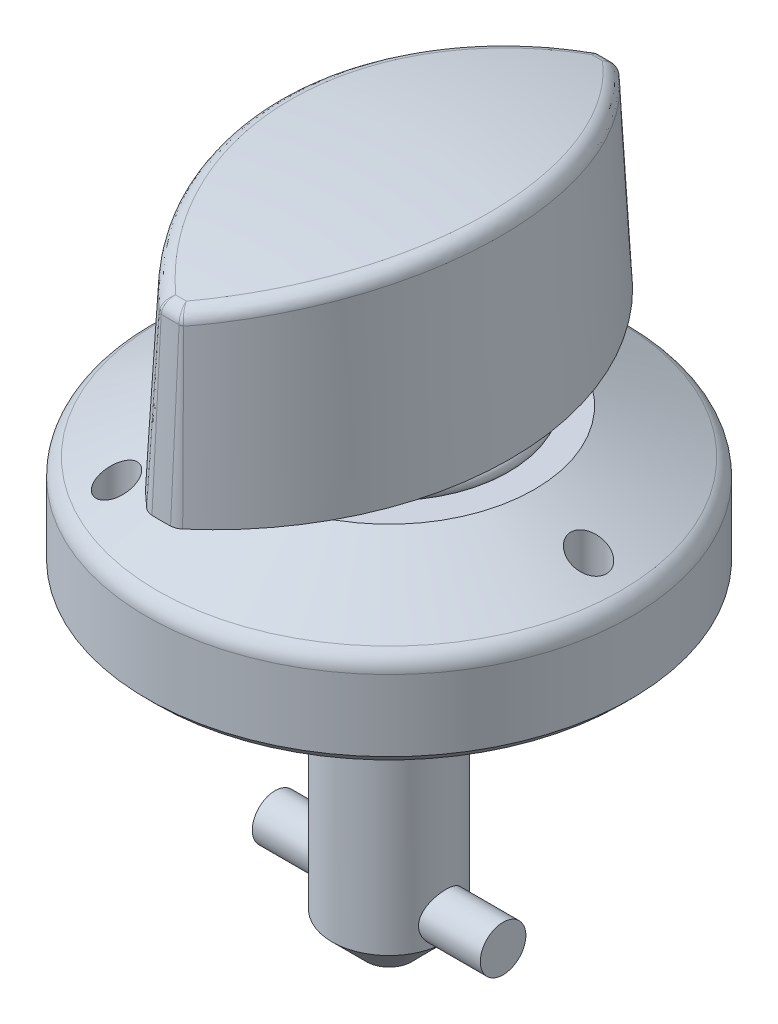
ISO-10303-21;
HEADER;
FILE_DESCRIPTION(('STEP AP214'),'2;1');
FILE_NAME('part.step','',(''),(''),'','','');
FILE_SCHEMA(('AUTOMOTIVE_DESIGN { 1 0 10303 214 1 1 1 1 }'));
ENDSEC;
DATA;
#1=APPLICATION_CONTEXT('core data for automotive mechanical design processes');
#2=APPLICATION_PROTOCOL_DEFINITION('international standard','automotive_design',2000,#1);
#3=PRODUCT_CONTEXT('',#1,'mechanical');
#4=PRODUCT('Part','Part','',(#3));
#5=PRODUCT_RELATED_PRODUCT_CATEGORY('part','',(#4));
#6=PRODUCT_DEFINITION_FORMATION('','',#4);
#7=PRODUCT_DEFINITION_CONTEXT('part definition',#1,'design');
#8=PRODUCT_DEFINITION('design','',#6,#7);
#9=PRODUCT_DEFINITION_SHAPE('','',#8);
#10=(LENGTH_UNIT() NAMED_UNIT(*) SI_UNIT(.MILLI.,.METRE.));
#11=(NAMED_UNIT(*) PLANE_ANGLE_UNIT() SI_UNIT($,.RADIAN.));
#12=(NAMED_UNIT(*) SI_UNIT($,.STERADIAN.) SOLID_ANGLE_UNIT());
#13=UNCERTAINTY_MEASURE_WITH_UNIT(LENGTH_MEASURE(1.E-05),#10,'distance_accuracy_value','');
#14=(GEOMETRIC_REPRESENTATION_CONTEXT(3) GLOBAL_UNCERTAINTY_ASSIGNED_CONTEXT((#13)) GLOBAL_UNIT_ASSIGNED_CONTEXT((#10,
#11,#12)) REPRESENTATION_CONTEXT('',''));
#15=CARTESIAN_POINT('',(0.,0.,0.));
#16=DIRECTION('',(0.,0.,1.));
#17=DIRECTION('',(1.,0.,0.));
#18=AXIS2_PLACEMENT_3D('',#15,#16,#17);
#19=CARTESIAN_POINT('',(0.,-17.5,0.));
#20=DIRECTION('',(0.,-1.,0.));
#21=DIRECTION('',(0.,0.,-1.));
#22=AXIS2_PLACEMENT_3D('',#19,#20,#21);
#23=PLANE('',#22);
#24=CARTESIAN_POINT('',(0.,-17.5,0.));
#25=DIRECTION('',(0.,-1.,0.));
#26=DIRECTION('',(0.,0.,-1.));
#27=AXIS2_PLACEMENT_3D('',#24,#25,#26);
#28=CIRCLE('',#27,1.6);
#29=CARTESIAN_POINT('',(0.,-17.5,-1.6));
#30=VERTEX_POINT('',#29);
#31=EDGE_CURVE('P0_E41',#30,#30,#28,.T.);
#32=ORIENTED_EDGE('',*,*,#31,.T.);
#33=EDGE_LOOP('',(#32));
#34=FACE_BOUND('',#33,.T.);
#35=ADVANCED_FACE('P0_F16',(#34),#23,.T.);
#36=CARTESIAN_POINT('',(0.,-17.5,0.));
#37=DIRECTION('',(0.,1.,0.));
#38=DIRECTION('',(0.,0.,1.));
#39=AXIS2_PLACEMENT_3D('',#36,#37,#38);
#40=CONICAL_SURFACE('',#39,1.6,0.78539816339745);
#41=CARTESIAN_POINT('',(0.,-15.1,0.));
#42=DIRECTION('',(0.,-1.,0.));
#43=DIRECTION('',(0.,0.,-1.));
#44=AXIS2_PLACEMENT_3D('',#41,#42,#43);
#45=CIRCLE('',#44,4.);
#46=CARTESIAN_POINT('',(4.00000000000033,-15.1000000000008,0.));
#47=VERTEX_POINT('',#46);
#48=CARTESIAN_POINT('',(-4.,-15.1,0.));
#49=VERTEX_POINT('',#48);
#50=EDGE_CURVE('P0_E34',#47,#49,#45,.T.);
#51=ORIENTED_EDGE('',*,*,#50,.T.);
#52=EDGE_CURVE('P0_E40',#49,#47,#45,.T.);
#53=ORIENTED_EDGE('',*,*,#52,.T.);
#54=EDGE_LOOP('',(#51,#53));
#55=FACE_BOUND('',#54,.T.);
#56=ORIENTED_EDGE('',*,*,#31,.F.);
#57=EDGE_LOOP('',(#56));
#58=FACE_BOUND('',#57,.T.);
#59=ADVANCED_FACE('P0_F38',(#55,#58),#40,.T.);
#60=CARTESIAN_POINT('',(0.,-17.5,0.));
#61=DIRECTION('',(0.,-1.,0.));
#62=DIRECTION('',(0.,0.,-1.));
#63=AXIS2_PLACEMENT_3D('',#60,#61,#62);
#64=CYLINDRICAL_SURFACE('',#63,4.);
#65=CARTESIAN_POINT('',(0.,0.,0.));
#66=DIRECTION('',(0.,-1.,0.));
#67=DIRECTION('',(0.,0.,-1.));
#68=AXIS2_PLACEMENT_3D('',#65,#66,#67);
#69=CIRCLE('',#68,4.);
#70=CARTESIAN_POINT('',(0.,0.,-4.));
#71=VERTEX_POINT('',#70);
#72=EDGE_CURVE('P0_E45',#71,#71,#69,.T.);
#73=ORIENTED_EDGE('',*,*,#72,.T.);
#74=EDGE_LOOP('',(#73));
#75=FACE_BOUND('',#74,.T.);
#76=ORIENTED_EDGE('',*,*,#50,.F.);
#77=CARTESIAN_POINT('',(3.66606055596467,-13.5,1.6));
#78=CARTESIAN_POINT('',(3.66606921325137,-13.5857115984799,1.59999060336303));
#79=CARTESIAN_POINT('',(3.66910881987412,-13.6715444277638,1.59307185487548));
#80=CARTESIAN_POINT('',(3.68088731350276,-13.8407478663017,1.56565522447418));
#81=CARTESIAN_POINT('',(3.68964076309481,-13.9241116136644,1.5451226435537));
#82=CARTESIAN_POINT('',(3.71168364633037,-14.0856423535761,1.49138802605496));
#83=CARTESIAN_POINT('',(3.72495597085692,-14.1638276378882,1.45823372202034));
#84=CARTESIAN_POINT('',(3.75451732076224,-14.3135080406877,1.38033621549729));
#85=CARTESIAN_POINT('',(3.77080568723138,-14.3850046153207,1.335595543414));
#86=CARTESIAN_POINT('',(3.80560692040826,-14.5234083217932,1.23305757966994));
#87=CARTESIAN_POINT('',(3.82419134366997,-14.5898851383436,1.17470348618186));
#88=CARTESIAN_POINT('',(3.86089965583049,-14.7124231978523,1.04776728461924));
#89=CARTESIAN_POINT('',(3.87902338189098,-14.7684808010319,0.979181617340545));
#90=CARTESIAN_POINT('',(3.91362726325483,-14.8707251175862,0.830405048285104));
#91=CARTESIAN_POINT('',(3.93001442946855,-14.9164354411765,0.749863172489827));
#92=CARTESIAN_POINT('',(3.95843142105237,-14.9934748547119,0.581460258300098));
#93=CARTESIAN_POINT('',(3.97046301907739,-15.0248097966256,0.493602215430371));
#94=CARTESIAN_POINT('',(3.98830660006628,-15.0706731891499,0.317573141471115));
#95=CARTESIAN_POINT('',(3.99439149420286,-15.0859418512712,0.229623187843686));
#96=CARTESIAN_POINT('',(4.00064248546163,-15.1016227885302,0.0522130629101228));
#97=CARTESIAN_POINT('',(4.0008107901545,-15.1020406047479,-0.0372465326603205));
#98=CARTESIAN_POINT('',(3.99537570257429,-15.08841378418,-0.209785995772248));
#99=CARTESIAN_POINT('',(3.99009597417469,-15.0751801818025,-0.292941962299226));
#100=CARTESIAN_POINT('',(3.97479433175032,-15.0360056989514,-0.45573848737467));
#101=CARTESIAN_POINT('',(3.9647720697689,-15.0100638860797,-0.535378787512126));
#102=CARTESIAN_POINT('',(3.9407745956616,-14.945890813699,-0.690318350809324));
#103=CARTESIAN_POINT('',(3.9267420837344,-14.9074802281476,-0.765534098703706));
#104=CARTESIAN_POINT('',(3.89611668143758,-14.8196279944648,-0.908646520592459));
#105=CARTESIAN_POINT('',(3.87952291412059,-14.7701825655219,-0.976540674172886));
#106=CARTESIAN_POINT('',(3.84417309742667,-14.6578806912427,-1.10781506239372));
#107=CARTESIAN_POINT('',(3.82534661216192,-14.5943568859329,-1.17060627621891));
#108=CARTESIAN_POINT('',(3.78849328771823,-14.4576075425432,-1.28488593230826));
#109=CARTESIAN_POINT('',(3.77046671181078,-14.3843788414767,-1.33637067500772));
#110=CARTESIAN_POINT('',(3.7367751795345,-14.2276647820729,-1.42792335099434));
#111=CARTESIAN_POINT('',(3.72119131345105,-14.143948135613,-1.46762772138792));
#112=CARTESIAN_POINT('',(3.69510072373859,-13.9702276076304,-1.53214100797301));
#113=CARTESIAN_POINT('',(3.68459070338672,-13.8802278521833,-1.55695959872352));
#114=CARTESIAN_POINT('',(3.67063807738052,-13.7023713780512,-1.58956395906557));
#115=CARTESIAN_POINT('',(3.6668029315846,-13.6147196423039,-1.59829767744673));
#116=CARTESIAN_POINT('',(3.66551598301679,-13.4391382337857,-1.60124906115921));
#117=CARTESIAN_POINT('',(3.6680622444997,-13.3512086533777,-1.59547112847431));
#118=CARTESIAN_POINT('',(3.67884835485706,-13.1828328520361,-1.57042631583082));
#119=CARTESIAN_POINT('',(3.68675566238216,-13.1022456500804,-1.55194644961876));
#120=CARTESIAN_POINT('',(3.70696040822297,-12.9453692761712,-1.50304334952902));
#121=CARTESIAN_POINT('',(3.71925881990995,-12.8690810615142,-1.47261746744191));
#122=CARTESIAN_POINT('',(3.7474702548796,-12.7195181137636,-1.39930851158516));
#123=CARTESIAN_POINT('',(3.76350963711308,-12.6464910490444,-1.35597029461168));
#124=CARTESIAN_POINT('',(3.7972030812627,-12.5084136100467,-1.2585321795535));
#125=CARTESIAN_POINT('',(3.8148577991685,-12.4433665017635,-1.20442789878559));
#126=CARTESIAN_POINT('',(3.85136732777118,-12.3181012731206,-1.08227536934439));
#127=CARTESIAN_POINT('',(3.87021445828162,-12.2585947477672,-1.01349234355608));
#128=CARTESIAN_POINT('',(3.9057583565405,-12.1518583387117,-0.866466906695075));
#129=CARTESIAN_POINT('',(3.92245503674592,-12.1046289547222,-0.788224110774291));
#130=CARTESIAN_POINT('',(3.95186972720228,-12.023961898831,-0.624223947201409));
#131=CARTESIAN_POINT('',(3.96458868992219,-11.9905209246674,-0.538468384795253));
#132=CARTESIAN_POINT('',(3.98458170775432,-11.9387609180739,-0.36191487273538));
#133=CARTESIAN_POINT('',(3.99185871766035,-11.920433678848,-0.271119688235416));
#134=CARTESIAN_POINT('',(3.9998320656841,-11.9003962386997,-0.0934532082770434));
#135=CARTESIAN_POINT('',(4.00092677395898,-11.8976798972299,-0.00671239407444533));
#136=CARTESIAN_POINT('',(3.99748833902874,-11.9062843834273,0.165947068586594));
#137=CARTESIAN_POINT('',(3.9929560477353,-11.9176030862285,0.251865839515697));
#138=CARTESIAN_POINT('',(3.97897210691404,-11.9532374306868,0.417736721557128));
#139=CARTESIAN_POINT('',(3.96967584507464,-11.9771431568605,0.497791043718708));
#140=CARTESIAN_POINT('',(3.9471595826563,-12.0368422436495,0.652737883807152));
#141=CARTESIAN_POINT('',(3.93393885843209,-12.0726377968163,0.72762944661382));
#142=CARTESIAN_POINT('',(3.90414475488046,-12.1568825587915,0.873762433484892));
#143=CARTESIAN_POINT('',(3.88744903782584,-12.2058210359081,0.94469630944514));
#144=CARTESIAN_POINT('',(3.85271522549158,-12.3142308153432,1.07764322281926));
#145=CARTESIAN_POINT('',(3.834676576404,-12.3737064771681,1.1396525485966));
#146=CARTESIAN_POINT('',(3.79790210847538,-12.50585217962,1.25696101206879));
#147=CARTESIAN_POINT('',(3.77919226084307,-12.5791110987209,1.31160710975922));
#148=CARTESIAN_POINT('',(3.74439737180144,-12.734353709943,1.40787796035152));
#149=CARTESIAN_POINT('',(3.72831263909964,-12.8163384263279,1.44950118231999));
#150=CARTESIAN_POINT('',(3.70207091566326,-12.9792297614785,1.51519287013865));
#151=CARTESIAN_POINT('',(3.69151134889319,-13.059572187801,1.54050201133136));
#152=CARTESIAN_POINT('',(3.67556802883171,-13.2235883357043,1.57817420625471));
#153=CARTESIAN_POINT('',(3.6701698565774,-13.3072520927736,1.59057333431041));
#154=CARTESIAN_POINT('',(3.66659567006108,-13.4275020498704,1.59877140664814));
#155=CARTESIAN_POINT('',(3.66605689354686,-13.4637401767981,1.6000039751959));
#156=CARTESIAN_POINT('',(3.66606055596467,-13.5,1.6));
#157=B_SPLINE_CURVE_WITH_KNOTS('',3,(#77,#78,#79,#80,#81,#82,#83,#84,#85,#86,#87,#88,#89,#90,
#91,#92,#93,#94,#95,#96,#97,#98,#99,#100,#101,#102,#103,#104,#105,#106,#107,#108,#109,#110,#111,
#112,#113,#114,#115,#116,#117,#118,#119,#120,#121,#122,#123,#124,#125,#126,#127,#128,#129,#130,
#131,#132,#133,#134,#135,#136,#137,#138,#139,#140,#141,#142,#143,#144,#145,#146,#147,#148,#149,
#150,#151,#152,#153,#154,#155,#156),.UNSPECIFIED.,.T.,.F.,(4,2,2,2,2,2,2,2,2,2,2,2,2,2,2,2,2,2,
2,2,2,2,2,2,2,2,2,2,2,2,2,2,2,2,2,2,2,2,2,4),(0.,0.257022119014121,0.514701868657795,
0.771416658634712,1.02807543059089,1.2980449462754,1.56810859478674,1.84882135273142,
2.12941973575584,2.39643346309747,2.66334756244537,2.91526915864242,3.16720924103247,
3.42294640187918,3.67877131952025,3.95139235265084,4.22410245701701,4.50451566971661,
4.78474643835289,5.04785718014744,5.31088811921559,5.55893798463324,5.80704286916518,
6.06520923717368,6.32348091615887,6.60082987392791,6.87819011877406,7.15548389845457,
7.43262700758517,7.6916883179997,7.95071041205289,8.20177595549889,8.45288782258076,
8.71509640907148,8.97741373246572,9.25597002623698,9.53455905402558,9.78813328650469,
10.040997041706,10.1497288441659),.UNSPECIFIED.);
#158=EDGE_CURVE('P0_E11',#47,#47,#157,.T.);
#159=ORIENTED_EDGE('',*,*,#158,.F.);
#160=ORIENTED_EDGE('',*,*,#52,.F.);
#161=CARTESIAN_POINT('',(-3.66606055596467,-13.5,1.6));
#162=CARTESIAN_POINT('',(-3.66606921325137,-13.4142884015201,1.59999060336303));
#163=CARTESIAN_POINT('',(-3.66910881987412,-13.3284555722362,1.59307185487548));
#164=CARTESIAN_POINT('',(-3.68088731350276,-13.1592521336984,1.56565522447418));
#165=CARTESIAN_POINT('',(-3.68964076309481,-13.0758883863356,1.5451226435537));
#166=CARTESIAN_POINT('',(-3.71168364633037,-12.914357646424,1.49138802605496));
#167=CARTESIAN_POINT('',(-3.72495597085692,-12.8361723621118,1.45823372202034));
#168=CARTESIAN_POINT('',(-3.75451732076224,-12.6864919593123,1.38033621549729));
#169=CARTESIAN_POINT('',(-3.77080568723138,-12.6149953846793,1.335595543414));
#170=CARTESIAN_POINT('',(-3.80560692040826,-12.4765916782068,1.23305757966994));
#171=CARTESIAN_POINT('',(-3.82419134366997,-12.4101148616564,1.17470348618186));
#172=CARTESIAN_POINT('',(-3.86089965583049,-12.2875768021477,1.04776728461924));
#173=CARTESIAN_POINT('',(-3.87902338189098,-12.2315191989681,0.979181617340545));
#174=CARTESIAN_POINT('',(-3.91362726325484,-12.1292748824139,0.830405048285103));
#175=CARTESIAN_POINT('',(-3.93001442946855,-12.0835645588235,0.749863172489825));
#176=CARTESIAN_POINT('',(-3.95843142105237,-12.0065251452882,0.581460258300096));
#177=CARTESIAN_POINT('',(-3.97046301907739,-11.9751902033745,0.49360221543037));
#178=CARTESIAN_POINT('',(-3.98830660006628,-11.9293268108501,0.317573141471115));
#179=CARTESIAN_POINT('',(-3.99439149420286,-11.9140581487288,0.229623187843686));
#180=CARTESIAN_POINT('',(-4.00064248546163,-11.8983772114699,0.0522130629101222));
#181=CARTESIAN_POINT('',(-4.0008107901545,-11.8979593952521,-0.0372465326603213));
#182=CARTESIAN_POINT('',(-3.99537570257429,-11.91158621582,-0.209785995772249));
#183=CARTESIAN_POINT('',(-3.99009597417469,-11.9248198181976,-0.292941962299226));
#184=CARTESIAN_POINT('',(-3.97479433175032,-11.9639943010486,-0.45573848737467));
#185=CARTESIAN_POINT('',(-3.9647720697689,-11.9899361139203,-0.535378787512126));
#186=CARTESIAN_POINT('',(-3.9407745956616,-12.0541091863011,-0.690318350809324));
#187=CARTESIAN_POINT('',(-3.9267420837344,-12.0925197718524,-0.765534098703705));
#188=CARTESIAN_POINT('',(-3.89611668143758,-12.1803720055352,-0.908646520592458));
#189=CARTESIAN_POINT('',(-3.87952291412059,-12.2298174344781,-0.976540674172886));
#190=CARTESIAN_POINT('',(-3.84417309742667,-12.3421193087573,-1.10781506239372));
#191=CARTESIAN_POINT('',(-3.82534661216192,-12.4056431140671,-1.17060627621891));
#192=CARTESIAN_POINT('',(-3.78849328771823,-12.5423924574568,-1.28488593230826));
#193=CARTESIAN_POINT('',(-3.77046671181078,-12.6156211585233,-1.33637067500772));
#194=CARTESIAN_POINT('',(-3.7367751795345,-12.7723352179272,-1.42792335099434));
#195=CARTESIAN_POINT('',(-3.72119131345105,-12.8560518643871,-1.46762772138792));
#196=CARTESIAN_POINT('',(-3.69510072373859,-13.0297723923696,-1.53214100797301));
#197=CARTESIAN_POINT('',(-3.68459070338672,-13.1197721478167,-1.55695959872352));
#198=CARTESIAN_POINT('',(-3.67063807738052,-13.2976286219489,-1.58956395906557));
#199=CARTESIAN_POINT('',(-3.6668029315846,-13.3852803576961,-1.59829767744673));
#200=CARTESIAN_POINT('',(-3.66551598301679,-13.5608617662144,-1.60124906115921));
#201=CARTESIAN_POINT('',(-3.6680622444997,-13.6487913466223,-1.59547112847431));
#202=CARTESIAN_POINT('',(-3.67884835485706,-13.8171671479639,-1.57042631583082));
#203=CARTESIAN_POINT('',(-3.68675566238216,-13.8977543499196,-1.55194644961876));
#204=CARTESIAN_POINT('',(-3.70696040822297,-14.0546307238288,-1.50304334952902));
#205=CARTESIAN_POINT('',(-3.71925881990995,-14.1309189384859,-1.47261746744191));
#206=CARTESIAN_POINT('',(-3.7474702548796,-14.2804818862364,-1.39930851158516));
#207=CARTESIAN_POINT('',(-3.76350963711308,-14.3535089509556,-1.35597029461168));
#208=CARTESIAN_POINT('',(-3.7972030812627,-14.4915863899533,-1.2585321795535));
#209=CARTESIAN_POINT('',(-3.8148577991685,-14.5566334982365,-1.20442789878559));
#210=CARTESIAN_POINT('',(-3.85136732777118,-14.6818987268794,-1.08227536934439));
#211=CARTESIAN_POINT('',(-3.87021445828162,-14.7414052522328,-1.01349234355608));
#212=CARTESIAN_POINT('',(-3.9057583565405,-14.8481416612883,-0.866466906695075));
#213=CARTESIAN_POINT('',(-3.92245503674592,-14.8953710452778,-0.788224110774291));
#214=CARTESIAN_POINT('',(-3.95186972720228,-14.976038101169,-0.624223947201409));
#215=CARTESIAN_POINT('',(-3.96458868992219,-15.0094790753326,-0.538468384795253));
#216=CARTESIAN_POINT('',(-3.98458170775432,-15.0612390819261,-0.361914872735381));
#217=CARTESIAN_POINT('',(-3.99185871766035,-15.0795663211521,-0.271119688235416));
#218=CARTESIAN_POINT('',(-3.9998320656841,-15.0996037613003,-0.093453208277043));
#219=CARTESIAN_POINT('',(-4.00092677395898,-15.1023201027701,-0.0067123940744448));
#220=CARTESIAN_POINT('',(-3.99748833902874,-15.0937156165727,0.165947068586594));
#221=CARTESIAN_POINT('',(-3.9929560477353,-15.0823969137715,0.251865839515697));
#222=CARTESIAN_POINT('',(-3.97897210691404,-15.0467625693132,0.417736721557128));
#223=CARTESIAN_POINT('',(-3.96967584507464,-15.0228568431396,0.497791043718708));
#224=CARTESIAN_POINT('',(-3.9471595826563,-14.9631577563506,0.652737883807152));
#225=CARTESIAN_POINT('',(-3.93393885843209,-14.9273622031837,0.72762944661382));
#226=CARTESIAN_POINT('',(-3.90414475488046,-14.8431174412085,0.873762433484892));
#227=CARTESIAN_POINT('',(-3.88744903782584,-14.7941789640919,0.94469630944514));
#228=CARTESIAN_POINT('',(-3.85271522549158,-14.6857691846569,1.07764322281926));
#229=CARTESIAN_POINT('',(-3.834676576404,-14.6262935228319,1.1396525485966));
#230=CARTESIAN_POINT('',(-3.79790210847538,-14.49414782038,1.25696101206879));
#231=CARTESIAN_POINT('',(-3.77919226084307,-14.4208889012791,1.31160710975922));
#232=CARTESIAN_POINT('',(-3.74439737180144,-14.265646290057,1.40787796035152));
#233=CARTESIAN_POINT('',(-3.72831263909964,-14.1836615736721,1.44950118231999));
#234=CARTESIAN_POINT('',(-3.70207091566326,-14.0207702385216,1.51519287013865));
#235=CARTESIAN_POINT('',(-3.69151134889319,-13.9404278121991,1.54050201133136));
#236=CARTESIAN_POINT('',(-3.67556802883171,-13.7764116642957,1.57817420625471));
#237=CARTESIAN_POINT('',(-3.6701698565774,-13.6927479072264,1.59057333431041));
#238=CARTESIAN_POINT('',(-3.66659567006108,-13.5724979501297,1.59877140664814));
#239=CARTESIAN_POINT('',(-3.66605689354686,-13.5362598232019,1.6000039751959));
#240=CARTESIAN_POINT('',(-3.66606055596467,-13.5,1.6));
#241=B_SPLINE_CURVE_WITH_KNOTS('',3,(#161,#162,#163,#164,#165,#166,#167,#168,#169,#170,#171,
#172,#173,#174,#175,#176,#177,#178,#179,#180,#181,#182,#183,#184,#185,#186,#187,#188,#189,#190,
#191,#192,#193,#194,#195,#196,#197,#198,#199,#200,#201,#202,#203,#204,#205,#206,#207,#208,#209,
#210,#211,#212,#213,#214,#215,#216,#217,#218,#219,#220,#221,#222,#223,#224,#225,#226,#227,#228,
#229,#230,#231,#232,#233,#234,#235,#236,#237,#238,#239,#240),.UNSPECIFIED.,.T.,.F.,(4,2,2,2,2,2,
2,2,2,2,2,2,2,2,2,2,2,2,2,2,2,2,2,2,2,2,2,2,2,2,2,2,2,2,2,2,2,2,2,4),(0.,0.257022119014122,
0.514701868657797,0.771416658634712,1.02807543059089,1.2980449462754,1.56810859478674,
1.84882135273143,2.12941973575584,2.39643346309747,2.66334756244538,2.91526915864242,
3.16720924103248,3.42294640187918,3.67877131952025,3.95139235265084,4.22410245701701,
4.50451566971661,4.78474643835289,5.04785718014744,5.31088811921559,5.55893798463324,
5.80704286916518,6.06520923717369,6.32348091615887,6.60082987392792,6.87819011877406,
7.15548389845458,7.43262700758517,7.6916883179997,7.95071041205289,8.2017759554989,
8.45288782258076,8.71509640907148,8.97741373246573,9.25597002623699,9.53455905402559,
9.78813328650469,10.040997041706,10.1497288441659),.UNSPECIFIED.);
#242=EDGE_CURVE('P0_E27',#49,#49,#241,.T.);
#243=ORIENTED_EDGE('',*,*,#242,.F.);
#244=EDGE_LOOP('',(#76,#159,#160,#243));
#245=FACE_BOUND('',#244,.T.);
#246=ADVANCED_FACE('P0_F43',(#75,#245),#64,.T.);
#247=CARTESIAN_POINT('',(4.,0.,0.));
#248=DIRECTION('',(0.,1.,0.));
#249=DIRECTION('',(0.,0.,1.));
#250=AXIS2_PLACEMENT_3D('',#247,#248,#249);
#251=PLANE('',#250);
#252=CARTESIAN_POINT('',(0.,0.,0.));
#253=DIRECTION('',(0.,-1.,0.));
#254=DIRECTION('',(0.,0.,-1.));
#255=AXIS2_PLACEMENT_3D('',#252,#253,#254);
#256=CIRCLE('',#255,3.2);
#257=CARTESIAN_POINT('',(0.,0.,-3.2));
#258=VERTEX_POINT('',#257);
#259=EDGE_CURVE('P0_E47',#258,#258,#256,.T.);
#260=ORIENTED_EDGE('',*,*,#259,.T.);
#261=EDGE_LOOP('',(#260));
#262=FACE_BOUND('',#261,.T.);
#263=ORIENTED_EDGE('',*,*,#72,.F.);
#264=EDGE_LOOP('',(#263));
#265=FACE_BOUND('',#264,.T.);
#266=ADVANCED_FACE('P0_F79',(#262,#265),#251,.T.);
#267=CARTESIAN_POINT('',(0.,-17.5,0.));
#268=DIRECTION('',(0.,-1.,0.));
#269=DIRECTION('',(0.,0.,-1.));
#270=AXIS2_PLACEMENT_3D('',#267,#268,#269);
#271=CYLINDRICAL_SURFACE('',#270,3.2);
#272=CARTESIAN_POINT('',(0.,20.2,0.));
#273=DIRECTION('',(0.,-1.,0.));
#274=DIRECTION('',(0.,0.,-1.));
#275=AXIS2_PLACEMENT_3D('',#272,#273,#274);
#276=CIRCLE('',#275,3.2);
#277=CARTESIAN_POINT('',(0.,20.2,-3.2));
#278=VERTEX_POINT('',#277);
#279=EDGE_CURVE('P0_E155',#278,#278,#276,.T.);
#280=ORIENTED_EDGE('',*,*,#279,.T.);
#281=EDGE_LOOP('',(#280));
#282=FACE_BOUND('',#281,.T.);
#283=ORIENTED_EDGE('',*,*,#259,.F.);
#284=EDGE_LOOP('',(#283));
#285=FACE_BOUND('',#284,.T.);
#286=ADVANCED_FACE('P0_F76',(#282,#285),#271,.T.);
#287=CARTESIAN_POINT('',(0.,20.2,0.));
#288=DIRECTION('',(0.,-1.,0.));
#289=DIRECTION('',(0.,0.,-1.));
#290=AXIS2_PLACEMENT_3D('',#287,#288,#289);
#291=CONICAL_SURFACE('',#290,3.2,0.785398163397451);
#292=CARTESIAN_POINT('',(0.,21.,0.));
#293=DIRECTION('',(0.,-1.,0.));
#294=DIRECTION('',(0.,0.,-1.));
#295=AXIS2_PLACEMENT_3D('',#292,#293,#294);
#296=CIRCLE('',#295,2.4);
#297=CARTESIAN_POINT('',(0.,21.,-2.4));
#298=VERTEX_POINT('',#297);
#299=EDGE_CURVE('P0_E150',#298,#298,#296,.T.);
#300=ORIENTED_EDGE('',*,*,#299,.T.);
#301=EDGE_LOOP('',(#300));
#302=FACE_BOUND('',#301,.T.);
#303=ORIENTED_EDGE('',*,*,#279,.F.);
#304=EDGE_LOOP('',(#303));
#305=FACE_BOUND('',#304,.T.);
#306=ADVANCED_FACE('P0_F72',(#302,#305),#291,.T.);
#307=CARTESIAN_POINT('',(2.4,21.,0.));
#308=DIRECTION('',(0.,1.,0.));
#309=DIRECTION('',(0.,0.,1.));
#310=AXIS2_PLACEMENT_3D('',#307,#308,#309);
#311=PLANE('',#310);
#312=ORIENTED_EDGE('',*,*,#299,.F.);
#313=EDGE_LOOP('',(#312));
#314=FACE_BOUND('',#313,.T.);
#315=ADVANCED_FACE('P0_F68',(#314),#311,.T.);
#316=CARTESIAN_POINT('',(-8.,-13.5,0.));
#317=DIRECTION('',(-1.,0.,0.));
#318=DIRECTION('',(0.,0.,1.));
#319=AXIS2_PLACEMENT_3D('',#316,#317,#318);
#320=PLANE('',#319);
#321=CARTESIAN_POINT('',(-8.,-13.5,0.));
#322=DIRECTION('',(-1.,0.,0.));
#323=DIRECTION('',(0.,0.,1.));
#324=AXIS2_PLACEMENT_3D('',#321,#322,#323);
#325=CIRCLE('',#324,1.6);
#326=CARTESIAN_POINT('',(-8.,-13.5,1.6));
#327=VERTEX_POINT('',#326);
#328=EDGE_CURVE('P0_E147',#327,#327,#325,.T.);
#329=ORIENTED_EDGE('',*,*,#328,.T.);
#330=EDGE_LOOP('',(#329));
#331=FACE_BOUND('',#330,.T.);
#332=ADVANCED_FACE('P0_F62',(#331),#320,.T.);
#333=CARTESIAN_POINT('',(-5.26029262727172,-13.5,0.));
#334=DIRECTION('',(-1.,0.,0.));
#335=DIRECTION('',(0.,0.,1.));
#336=AXIS2_PLACEMENT_3D('',#333,#334,#335);
#337=CYLINDRICAL_SURFACE('',#336,1.6);
#338=ORIENTED_EDGE('',*,*,#242,.T.);
#339=EDGE_LOOP('',(#338));
#340=FACE_BOUND('',#339,.T.);
#341=ORIENTED_EDGE('',*,*,#328,.F.);
#342=EDGE_LOOP('',(#341));
#343=FACE_BOUND('',#342,.T.);
#344=ADVANCED_FACE('P0_F56',(#340,#343),#337,.T.);
#345=ORIENTED_EDGE('',*,*,#158,.T.);
#346=EDGE_LOOP('',(#345));
#347=FACE_BOUND('',#346,.T.);
#348=CARTESIAN_POINT('',(8.,-13.5,0.));
#349=DIRECTION('',(-1.,0.,0.));
#350=DIRECTION('',(0.,0.,1.));
#351=AXIS2_PLACEMENT_3D('',#348,#349,#350);
#352=CIRCLE('',#351,1.6);
#353=CARTESIAN_POINT('',(8.,-13.5,1.6));
#354=VERTEX_POINT('',#353);
#355=EDGE_CURVE('P0_E145',#354,#354,#352,.T.);
#356=ORIENTED_EDGE('',*,*,#355,.T.);
#357=EDGE_LOOP('',(#356));
#358=FACE_BOUND('',#357,.T.);
#359=ADVANCED_FACE('P0_F61',(#347,#358),#337,.T.);
#360=CARTESIAN_POINT('',(8.,-15.1,0.));
#361=DIRECTION('',(1.,0.,0.));
#362=DIRECTION('',(0.,0.,-1.));
#363=AXIS2_PLACEMENT_3D('',#360,#361,#362);
#364=PLANE('',#363);
#365=ORIENTED_EDGE('',*,*,#355,.F.);
#366=EDGE_LOOP('',(#365));
#367=FACE_BOUND('',#366,.T.);
#368=ADVANCED_FACE('P0_F64',(#367),#364,.T.);
#369=CLOSED_SHELL('',(#35,#59,#246,#266,#286,#306,#315,#332,#344,#359,#368));
#370=MANIFOLD_SOLID_BREP('P0_B1',#369);
#371=CARTESIAN_POINT('',(16.,16.5,0.));
#372=DIRECTION('',(0.,-1.,0.));
#373=DIRECTION('',(0.,0.,-1.));
#374=AXIS2_PLACEMENT_3D('',#371,#372,#373);
#375=PLANE('',#374);
#376=CARTESIAN_POINT('',(0.,16.5,0.));
#377=DIRECTION('',(0.,-1.,0.));
#378=DIRECTION('',(0.,0.,-1.));
#379=AXIS2_PLACEMENT_3D('',#376,#377,#378);
#380=CIRCLE('',#379,3.2);
#381=CARTESIAN_POINT('',(0.,16.5,-3.2));
#382=VERTEX_POINT('',#381);
#383=EDGE_CURVE('P1_E678',#382,#382,#380,.T.);
#384=ORIENTED_EDGE('',*,*,#383,.F.);
#385=EDGE_LOOP('',(#384));
#386=FACE_BOUND('',#385,.T.);
#387=CARTESIAN_POINT('',(-12.25,16.5,0.));
#388=DIRECTION('',(0.,-1.,0.));
#389=DIRECTION('',(0.,0.,1.));
#390=AXIS2_PLACEMENT_3D('',#387,#388,#389);
#391=CIRCLE('',#390,20.75);
#392=CARTESIAN_POINT('',(1.26349780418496,16.5,-15.7463607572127));
#393=VERTEX_POINT('',#392);
#394=CARTESIAN_POINT('',(1.26349780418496,16.5,15.7463607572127));
#395=VERTEX_POINT('',#394);
#396=EDGE_CURVE('P1_E758',#393,#395,#391,.T.);
#397=ORIENTED_EDGE('',*,*,#396,.T.);
#398=CARTESIAN_POINT('',(0.61224489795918,16.5,14.987499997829));
#399=DIRECTION('',(0.,-1.,0.));
#400=DIRECTION('',(0.,0.,-1.));
#401=AXIS2_PLACEMENT_3D('',#398,#399,#400);
#402=CIRCLE('',#401,1.);
#403=CARTESIAN_POINT('',(0.653061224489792,16.5,15.9866666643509));
#404=VERTEX_POINT('',#403);
#405=EDGE_CURVE('P1_E76',#395,#404,#402,.T.);
#406=ORIENTED_EDGE('',*,*,#405,.T.);
#407=CARTESIAN_POINT('',(0.,16.5,0.));
#408=DIRECTION('',(0.,-1.,0.));
#409=DIRECTION('',(0.,0.,-1.));
#410=AXIS2_PLACEMENT_3D('',#407,#408,#409);
#411=CIRCLE('',#410,16.);
#412=CARTESIAN_POINT('',(-0.653061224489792,16.5,15.9866666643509));
#413=VERTEX_POINT('',#412);
#414=EDGE_CURVE('P1_E691',#404,#413,#411,.T.);
#415=ORIENTED_EDGE('',*,*,#414,.T.);
#416=CARTESIAN_POINT('',(-0.61224489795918,16.5,14.987499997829));
#417=DIRECTION('',(0.,-1.,0.));
#418=DIRECTION('',(0.,0.,-1.));
#419=AXIS2_PLACEMENT_3D('',#416,#417,#418);
#420=CIRCLE('',#419,1.);
#421=CARTESIAN_POINT('',(-1.26349780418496,16.5,15.7463607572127));
#422=VERTEX_POINT('',#421);
#423=EDGE_CURVE('P1_E686',#413,#422,#420,.T.);
#424=ORIENTED_EDGE('',*,*,#423,.T.);
#425=CARTESIAN_POINT('',(12.25,16.5,0.));
#426=DIRECTION('',(0.,-1.,0.));
#427=DIRECTION('',(0.,0.,-1.));
#428=AXIS2_PLACEMENT_3D('',#425,#426,#427);
#429=CIRCLE('',#428,20.75);
#430=CARTESIAN_POINT('',(-1.26349780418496,16.5,-15.7463607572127));
#431=VERTEX_POINT('',#430);
#432=EDGE_CURVE('P1_E697',#422,#431,#429,.T.);
#433=ORIENTED_EDGE('',*,*,#432,.T.);
#434=CARTESIAN_POINT('',(-0.61224489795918,16.5,-14.987499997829));
#435=DIRECTION('',(0.,-1.,0.));
#436=DIRECTION('',(0.,0.,-1.));
#437=AXIS2_PLACEMENT_3D('',#434,#435,#436);
#438=CIRCLE('',#437,1.);
#439=CARTESIAN_POINT('',(-0.653061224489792,16.5,-15.9866666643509));
#440=VERTEX_POINT('',#439);
#441=EDGE_CURVE('P1_E705',#431,#440,#438,.T.);
#442=ORIENTED_EDGE('',*,*,#441,.T.);
#443=CARTESIAN_POINT('',(0.653061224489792,16.5,-15.9866666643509));
#444=VERTEX_POINT('',#443);
#445=EDGE_CURVE('P1_E603',#440,#444,#411,.T.);
#446=ORIENTED_EDGE('',*,*,#445,.T.);
#447=CARTESIAN_POINT('',(0.61224489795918,16.5,-14.987499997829));
#448=DIRECTION('',(0.,-1.,0.));
#449=DIRECTION('',(0.,0.,-1.));
#450=AXIS2_PLACEMENT_3D('',#447,#448,#449);
#451=CIRCLE('',#450,1.);
#452=EDGE_CURVE('P1_E689',#444,#393,#451,.T.);
#453=ORIENTED_EDGE('',*,*,#452,.T.);
#454=EDGE_LOOP('',(#397,#406,#415,#424,#433,#442,#446,#453));
#455=FACE_BOUND('',#454,.T.);
#456=ADVANCED_FACE('P1_F16',(#386,#455),#375,.T.);
#457=CARTESIAN_POINT('',(0.,-33.9999999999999,0.));
#458=DIRECTION('',(0.,-1.,0.));
#459=DIRECTION('',(1.,0.,0.));
#460=AXIS2_PLACEMENT_3D('',#457,#458,#459);
#461=SPHERICAL_SURFACE('',#460,64.9999999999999);
#462=CARTESIAN_POINT('',(-5.02841802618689,27.2564834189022,18.850318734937));
#463=CARTESIAN_POINT('',(-5.17248836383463,27.9915010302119,18.8642615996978));
#464=CARTESIAN_POINT('',(-5.46982601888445,28.1604622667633,18.197745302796));
#465=CARTESIAN_POINT('',(-4.49343485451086,27.3599454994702,18.6396235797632));
#466=CARTESIAN_POINT('',(-4.63519398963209,28.099569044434,18.6566742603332));
#467=CARTESIAN_POINT('',(-4.95346056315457,28.2655409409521,17.9940895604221));
#468=CARTESIAN_POINT('',(-3.96707695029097,27.4614641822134,18.4059109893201));
#469=CARTESIAN_POINT('',(-4.10739183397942,28.2054376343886,18.4262926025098));
#470=CARTESIAN_POINT('',(-4.44544201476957,28.3686458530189,17.7682266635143));
#471=CARTESIAN_POINT('',(-2.93532100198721,27.6599720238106,17.8941389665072));
#472=CARTESIAN_POINT('',(-3.07203060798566,28.4126022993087,17.920906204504));
#473=CARTESIAN_POINT('',(-3.44967337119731,28.570255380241,17.2737212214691));
#474=CARTESIAN_POINT('',(-2.42992448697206,27.7569608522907,17.6160763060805));
#475=CARTESIAN_POINT('',(-2.56461941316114,28.5138667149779,17.6457574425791));
#476=CARTESIAN_POINT('',(-2.96192475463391,28.6687596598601,17.0050755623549));
#477=CARTESIAN_POINT('',(-1.44396020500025,27.9457355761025,17.0173722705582));
#478=CARTESIAN_POINT('',(-1.573988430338,28.7111064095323,17.0525090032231));
#479=CARTESIAN_POINT('',(-2.01042460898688,28.8604839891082,16.4267166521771));
#480=CARTESIAN_POINT('',(-0.963388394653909,28.037522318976,16.696737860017));
#481=CARTESIAN_POINT('',(-1.09093564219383,28.8070467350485,16.7343023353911));
#482=CARTESIAN_POINT('',(-1.54666917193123,28.9537048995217,16.1170101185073));
#483=CARTESIAN_POINT('',(-0.0306147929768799,28.2152930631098,16.0149880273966));
#484=CARTESIAN_POINT('',(-0.152625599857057,28.9930014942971,16.0569160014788));
#485=CARTESIAN_POINT('',(-0.646566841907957,29.1342533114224,15.4585581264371));
#486=CARTESIAN_POINT('',(0.421588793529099,28.3012774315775,15.6538751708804));
#487=CARTESIAN_POINT('',(0.302441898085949,29.0829768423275,15.6976569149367));
#488=CARTESIAN_POINT('',(-0.21021821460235,29.2215811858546,15.1098151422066));
#489=CARTESIAN_POINT('',(1.28271823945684,28.4646914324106,14.9035715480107));
#490=CARTESIAN_POINT('',(1.16965920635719,29.2540976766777,14.9504630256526));
#491=CARTESIAN_POINT('',(0.620691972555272,29.387548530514,14.3852692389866));
#492=CARTESIAN_POINT('',(1.69246907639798,28.5422864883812,14.5153679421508));
#493=CARTESIAN_POINT('',(1.58246672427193,29.3353811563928,14.5634541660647));
#494=CARTESIAN_POINT('',(1.01605028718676,29.4663560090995,14.0104181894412));
#495=CARTESIAN_POINT('',(2.47879291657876,28.6909303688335,13.7053851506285));
#496=CARTESIAN_POINT('',(2.37525234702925,29.491205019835,13.7552243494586));
#497=CARTESIAN_POINT('',(1.77473268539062,29.6173224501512,13.2283446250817));
#498=CARTESIAN_POINT('',(2.85536602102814,28.7619792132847,13.2836060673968));
#499=CARTESIAN_POINT('',(2.75503153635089,29.5657054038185,13.3339958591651));
#500=CARTESIAN_POINT('',(2.13805686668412,29.689481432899,12.8211222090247));
#501=CARTESIAN_POINT('',(3.57234077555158,28.8970374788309,12.4094695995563));
#502=CARTESIAN_POINT('',(3.47864806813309,29.7074275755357,12.4602699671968));
#503=CARTESIAN_POINT('',(2.8297884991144,29.8266499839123,11.9771991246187));
#504=CARTESIAN_POINT('',(3.91275801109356,28.9610499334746,11.9571255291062));
#505=CARTESIAN_POINT('',(3.82230042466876,29.7746125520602,12.0078145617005));
#506=CARTESIAN_POINT('',(3.15821099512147,29.8916626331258,11.5405112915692));
#507=CARTESIAN_POINT('',(4.55500179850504,29.0816492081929,11.0247676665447));
#508=CARTESIAN_POINT('',(4.47111908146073,29.901278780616,11.0745117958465));
#509=CARTESIAN_POINT('',(3.77781090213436,30.0141462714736,10.640463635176));
#510=CARTESIAN_POINT('',(4.85682844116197,29.1382360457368,10.5447539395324));
#511=CARTESIAN_POINT('',(4.77608896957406,29.9607211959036,10.5937303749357));
#512=CARTESIAN_POINT('',(4.068988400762,30.0716172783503,10.177103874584));
#513=CARTESIAN_POINT('',(5.41976553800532,29.2436492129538,9.5599888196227));
#514=CARTESIAN_POINT('',(5.34528794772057,30.0715299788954,9.60669948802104));
#515=CARTESIAN_POINT('',(4.61205307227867,30.1786775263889,9.22654015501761));
#516=CARTESIAN_POINT('',(5.68084361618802,29.2924693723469,9.0552181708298));
#517=CARTESIAN_POINT('',(5.60929824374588,30.1228533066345,9.10053328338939));
#518=CARTESIAN_POINT('',(4.86390900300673,30.2282605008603,8.7393176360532));
#519=CARTESIAN_POINT('',(6.15992856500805,29.3819659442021,8.02485571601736));
#520=CARTESIAN_POINT('',(6.09408717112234,30.2170001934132,8.06667013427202));
#521=CARTESIAN_POINT('',(5.3260634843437,30.3191554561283,7.74480537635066));
#522=CARTESIAN_POINT('',(6.37793585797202,29.4226424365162,7.49926411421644));
#523=CARTESIAN_POINT('',(6.31469785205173,30.2597909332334,7.53910965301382));
#524=CARTESIAN_POINT('',(5.53636244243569,30.3604675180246,7.23751583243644));
#525=CARTESIAN_POINT('',(6.7691742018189,29.4955830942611,6.43091344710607));
#526=CARTESIAN_POINT('',(6.71085525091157,30.3365698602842,6.4661579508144));
#527=CARTESIAN_POINT('',(5.91376240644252,30.434547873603,6.20639175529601));
#528=CARTESIAN_POINT('',(6.9423963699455,29.527845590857,5.88815100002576));
#529=CARTESIAN_POINT('',(6.8862482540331,30.3705281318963,5.92093015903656));
#530=CARTESIAN_POINT('',(6.08085484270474,30.4673144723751,5.68255396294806));
#531=CARTESIAN_POINT('',(7.24260264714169,29.5837263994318,4.78949838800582));
#532=CARTESIAN_POINT('',(7.1903906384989,30.4293792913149,4.81675647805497));
#533=CARTESIAN_POINT('',(6.37043509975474,30.5240684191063,4.62222737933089));
#534=CARTESIAN_POINT('',(7.36958723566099,29.6073448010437,4.2336083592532));
#535=CARTESIAN_POINT('',(7.3190249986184,30.4542498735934,4.25800306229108));
#536=CARTESIAN_POINT('',(6.49292338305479,30.548055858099,4.08573871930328));
#537=CARTESIAN_POINT('',(7.57502167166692,29.6455405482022,3.11961232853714));
#538=CARTESIAN_POINT('',(7.52723385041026,30.4944908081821,3.13782910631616));
#539=CARTESIAN_POINT('',(6.69108255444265,30.5868484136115,3.01063578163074));
#540=CARTESIAN_POINT('',(7.65404464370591,29.6602246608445,2.56161606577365));
#541=CARTESIAN_POINT('',(7.60730929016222,30.5099581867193,2.57672392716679));
#542=CARTESIAN_POINT('',(6.76730628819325,30.6017619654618,2.47212725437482));
#543=CARTESIAN_POINT('',(7.76533089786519,29.6809009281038,1.44080192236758));
#544=CARTESIAN_POINT('',(7.72012703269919,30.5317468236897,1.44932204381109));
#545=CARTESIAN_POINT('',(6.87465017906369,30.6227612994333,1.39046393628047));
#546=CARTESIAN_POINT('',(7.79759455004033,29.6868931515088,0.877984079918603));
#547=CARTESIAN_POINT('',(7.75282596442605,30.5380597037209,0.883241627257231));
#548=CARTESIAN_POINT('',(6.90577069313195,30.6288471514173,0.847309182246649));
#549=CARTESIAN_POINT('',(7.81510117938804,29.6901448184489,-0.248284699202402));
#550=CARTESIAN_POINT('',(7.77057530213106,30.5414866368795,-0.24979713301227));
#551=CARTESIAN_POINT('',(6.92265706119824,30.6321496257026,-0.239610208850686));
#552=CARTESIAN_POINT('',(7.80035462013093,29.6874062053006,-0.811735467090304));
#553=CARTESIAN_POINT('',(7.75562938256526,30.5386013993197,-0.816534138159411));
#554=CARTESIAN_POINT('',(6.90843300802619,30.6293682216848,-0.7833746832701));
#555=CARTESIAN_POINT('',(7.72398243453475,29.6732190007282,-1.93532458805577));
#556=CARTESIAN_POINT('',(7.67820195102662,30.5236501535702,-1.94680867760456));
#557=CARTESIAN_POINT('',(6.83476653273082,30.6149593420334,-1.86771169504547));
#558=CARTESIAN_POINT('',(7.66235704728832,29.6617704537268,-2.49546295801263));
#559=CARTESIAN_POINT('',(7.6157508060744,30.5115900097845,-2.5101274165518));
#560=CARTESIAN_POINT('',(6.77532434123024,30.6033319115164,-2.40828424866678));
#561=CARTESIAN_POINT('',(7.49332019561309,29.6303519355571,-3.60447505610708));
#562=CARTESIAN_POINT('',(7.44441097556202,30.4784854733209,-3.62545842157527));
#563=CARTESIAN_POINT('',(6.612274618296,30.5714224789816,-3.47856862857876));
#564=CARTESIAN_POINT('',(7.38623384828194,29.6104424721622,-4.1534003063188));
#565=CARTESIAN_POINT('',(7.33591726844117,30.4575174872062,-4.1773139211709));
#566=CARTESIAN_POINT('',(6.50898069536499,30.5512019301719,-4.00833010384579));
#567=CARTESIAN_POINT('',(7.12717181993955,29.5622443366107,-5.24013256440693));
#568=CARTESIAN_POINT('',(7.07341409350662,30.4067491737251,-5.26975399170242));
#569=CARTESIAN_POINT('',(6.25909040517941,30.50225069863,-5.05713871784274));
#570=CARTESIAN_POINT('',(6.97519598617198,29.5339556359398,-5.77793953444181));
#571=CARTESIAN_POINT('',(6.91950150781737,30.3769676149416,-5.81014929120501));
#572=CARTESIAN_POINT('',(6.11249389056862,30.4735199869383,-5.57618582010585));
#573=CARTESIAN_POINT('',(6.62744549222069,29.4691675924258,-6.83896461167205));
#574=CARTESIAN_POINT('',(6.56729708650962,30.3087552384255,-6.87607836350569));
#575=CARTESIAN_POINT('',(5.77704740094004,30.407719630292,-6.6002209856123));
#576=CARTESIAN_POINT('',(6.4316461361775,29.4326636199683,-7.36217430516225));
#577=CARTESIAN_POINT('',(6.36910608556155,30.2703439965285,-7.40143606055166));
#578=CARTESIAN_POINT('',(5.58817360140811,30.3706452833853,-7.10520094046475));
#579=CARTESIAN_POINT('',(5.99782309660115,29.351695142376,-8.39004252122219));
#580=CARTESIAN_POINT('',(5.92998821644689,30.1851443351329,-8.4332182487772));
#581=CARTESIAN_POINT('',(5.1696876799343,30.2884116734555,-8.09728187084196));
#582=CARTESIAN_POINT('',(5.75980080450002,29.3072308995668,-8.89470165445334));
#583=CARTESIAN_POINT('',(5.68921301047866,30.1383854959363,-8.93950183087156));
#584=CARTESIAN_POINT('',(4.94007690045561,30.2432526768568,-8.58438343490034));
#585=CARTESIAN_POINT('',(5.24186381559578,29.2103523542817,-9.88488020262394));
#586=CARTESIAN_POINT('',(5.16533100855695,30.036514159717,-9.93245802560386));
#587=CARTESIAN_POINT('',(4.44043288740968,30.1448604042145,-9.5401431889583));
#588=CARTESIAN_POINT('',(4.96171572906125,29.1578937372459,-10.3702726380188));
#589=CARTESIAN_POINT('',(4.88215674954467,29.9813880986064,-10.4188940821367));
#590=CARTESIAN_POINT('',(4.17017445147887,30.0915821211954,-10.0086789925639));
#591=CARTESIAN_POINT('',(4.36268928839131,29.0455582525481,-11.3155098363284));
#592=CARTESIAN_POINT('',(4.27674820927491,29.8633549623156,-11.365667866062));
#593=CARTESIAN_POINT('',(3.59228061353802,29.977491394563,-10.9211251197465));
#594=CARTESIAN_POINT('',(4.04381166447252,28.9856815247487,-11.7753550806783));
#595=CARTESIAN_POINT('',(3.95470001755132,29.8004845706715,-11.8259264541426));
#596=CARTESIAN_POINT('',(3.28464591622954,29.9166790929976,-11.36503590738));
#597=CARTESIAN_POINT('',(3.3703991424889,28.8590230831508,-12.665550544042));
#598=CARTESIAN_POINT('',(3.27473295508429,29.6675176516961,-12.7163484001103));
#599=CARTESIAN_POINT('',(2.63495894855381,29.7880416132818,-12.2244233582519));
#600=CARTESIAN_POINT('',(3.0159342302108,28.7922549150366,-13.0959559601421));
#601=CARTESIAN_POINT('',(2.91707758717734,29.5974736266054,-13.1465215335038));
#602=CARTESIAN_POINT('',(2.29297423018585,29.7202301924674,-12.6399532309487));
#603=CARTESIAN_POINT('',(2.27357797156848,28.6521673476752,-13.925270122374));
#604=CARTESIAN_POINT('',(2.1682376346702,29.4505476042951,-13.974745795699));
#605=CARTESIAN_POINT('',(1.57673410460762,29.5779537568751,-13.4406472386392));
#606=CARTESIAN_POINT('',(1.88570707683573,28.5788519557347,-14.32419785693));
#607=CARTESIAN_POINT('',(1.77726657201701,29.3737084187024,-14.3728055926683));
#608=CARTESIAN_POINT('',(1.20249844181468,29.5034928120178,-13.8258296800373));
#609=CARTESIAN_POINT('',(1.38039698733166,28.4831491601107,-14.8029253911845));
#610=CARTESIAN_POINT('',(1.26747986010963,29.273316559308,-14.8506107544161));
#611=CARTESIAN_POINT('',(0.71493647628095,29.4062946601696,-14.2880910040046));
#612=CARTESIAN_POINT('',(1.27719905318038,28.4635947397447,-14.8986712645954));
#613=CARTESIAN_POINT('',(1.16350608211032,29.2528312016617,-14.9460365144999));
#614=CARTESIAN_POINT('',(0.615362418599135,29.3864347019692,-14.3805451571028));
#615=CARTESIAN_POINT('',(1.06894481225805,28.4241141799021,-15.0878918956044));
#616=CARTESIAN_POINT('',(0.953712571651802,29.2114759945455,-15.1345769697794));
#617=CARTESIAN_POINT('',(0.414419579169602,29.346337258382,-14.5632635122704));
#618=CARTESIAN_POINT('',(0.963889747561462,28.4041882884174,-15.1813680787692));
#619=CARTESIAN_POINT('',(0.847897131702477,29.1906070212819,-15.2276935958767));
#620=CARTESIAN_POINT('',(0.313051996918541,29.3261000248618,-14.6535290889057));
#621=CARTESIAN_POINT('',(0.423861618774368,28.3017087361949,-15.651892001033));
#622=CARTESIAN_POINT('',(0.304722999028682,29.0834269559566,-15.6956891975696));
#623=CARTESIAN_POINT('',(-0.208025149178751,29.2220192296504,-15.1079000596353));
#624=CARTESIAN_POINT('',(-0.0260686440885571,28.2161574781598,-16.0113543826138));
#625=CARTESIAN_POINT('',(-0.148058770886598,28.9939044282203,-16.0533075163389));
#626=CARTESIAN_POINT('',(-0.642180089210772,29.13513123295,-15.455048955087));
#627=CARTESIAN_POINT('',(-0.954296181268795,28.0392571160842,-16.6903991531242));
#628=CARTESIAN_POINT('',(-1.08179944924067,28.8088594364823,-16.7280129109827));
#629=CARTESIAN_POINT('',(-1.53789526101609,28.9554668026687,-16.1108877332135));
#630=CARTESIAN_POINT('',(-1.43261642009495,27.9479033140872,-17.0099485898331));
#631=CARTESIAN_POINT('',(-1.56259390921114,28.7133707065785,-17.045148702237));
#632=CARTESIAN_POINT('',(-1.99947767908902,28.862685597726,-16.4195458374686));
#633=CARTESIAN_POINT('',(-2.41847324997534,27.7591574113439,-17.6096481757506));
#634=CARTESIAN_POINT('',(-2.55311127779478,28.5161623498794,-17.6393902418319));
#635=CARTESIAN_POINT('',(-2.95087346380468,28.6709905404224,-16.998865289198));
#636=CARTESIAN_POINT('',(-2.92624282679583,27.6617164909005,-17.8893983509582));
#637=CARTESIAN_POINT('',(-3.06290837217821,28.4144252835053,-17.9162154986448));
#638=CARTESIAN_POINT('',(-3.44091201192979,28.5720271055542,-17.2691408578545));
#639=CARTESIAN_POINT('',(-3.96259676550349,27.4623282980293,-18.4039236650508));
#640=CARTESIAN_POINT('',(-4.10289011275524,28.2063406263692,-18.4243293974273));
#641=CARTESIAN_POINT('',(-4.44111792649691,28.3695234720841,-17.7663060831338));
#642=CARTESIAN_POINT('',(-4.49116428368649,27.3603846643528,-18.6387343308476));
#643=CARTESIAN_POINT('',(-4.63290837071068,28.1000288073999,-18.6557958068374));
#644=CARTESIAN_POINT('',(-4.95126900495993,28.2659869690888,-17.9932300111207));
#645=CARTESIAN_POINT('',(-5.0284180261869,27.2564834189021,-18.850318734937));
#646=CARTESIAN_POINT('',(-5.17248836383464,27.9915010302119,-18.8642615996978));
#647=CARTESIAN_POINT('',(-5.46982601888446,28.1604622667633,-18.197745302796));
#648=(BOUNDED_SURFACE() B_SPLINE_SURFACE(3,2,((#462,#463,#464),(#465,#466,#467),(#468,#469,
#470),(#471,#472,#473),(#474,#475,#476),(#477,#478,#479),(#480,#481,#482),(#483,#484,#485),
(#486,#487,#488),(#489,#490,#491),(#492,#493,#494),(#495,#496,#497),(#498,#499,#500),(#501,#502,
#503),(#504,#505,#506),(#507,#508,#509),(#510,#511,#512),(#513,#514,#515),(#516,#517,#518),
(#519,#520,#521),(#522,#523,#524),(#525,#526,#527),(#528,#529,#530),(#531,#532,#533),(#534,#535,
#536),(#537,#538,#539),(#540,#541,#542),(#543,#544,#545),(#546,#547,#548),(#549,#550,#551),
(#552,#553,#554),(#555,#556,#557),(#558,#559,#560),(#561,#562,#563),(#564,#565,#566),(#567,#568,
#569),(#570,#571,#572),(#573,#574,#575),(#576,#577,#578),(#579,#580,#581),(#582,#583,#584),
(#585,#586,#587),(#588,#589,#590),(#591,#592,#593),(#594,#595,#596),(#597,#598,#599),(#600,#601,
#602),(#603,#604,#605),(#606,#607,#608),(#609,#610,#611),(#612,#613,#614),(#615,#616,#617),
(#618,#619,#620),(#621,#622,#623),(#624,#625,#626),(#627,#628,#629),(#630,#631,#632),(#633,#634,
#635),(#636,#637,#638),(#639,#640,#641),(#642,#643,#644),(#645,#646,#647)),.UNSPECIFIED.,.F.,
.F.,.F.) B_SPLINE_SURFACE_WITH_KNOTS((4,2,2,2,2,2,2,2,2,2,2,2,2,2,2,2,2,2,2,2,2,2,2,2,2,2,2,2,2,
2,4),(3,3),(0.,1.66825476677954,3.33663101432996,5.00473465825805,6.67273263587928,
8.29690007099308,9.92106255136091,11.5445220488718,13.167977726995,14.7927167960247,
16.4174399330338,18.042485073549,19.6675133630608,21.2727198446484,22.8779136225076,
24.4827501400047,26.0875784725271,27.6811181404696,29.2746632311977,30.869108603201,
32.4635014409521,34.067077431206,35.6706231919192,37.2710750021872,38.8705538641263,
39.2761631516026,39.6815107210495,41.3411735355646,43.0021976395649,44.6788860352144,
46.3542434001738),(0.,1.),
.UNSPECIFIED.) GEOMETRIC_REPRESENTATION_ITEM() RATIONAL_B_SPLINE_SURFACE(((1.,0.800332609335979,
1.),(1.,0.798744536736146,1.),(1.,0.797175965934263,1.),(1.,0.794090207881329,1.),(1.,
0.792573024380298,1.),(1.,0.789602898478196,1.),(1.,0.788149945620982,1.),(1.,0.785320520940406,
1.),(1.,0.78394404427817,1.),(1.,0.781314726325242,1.),(1.,0.780059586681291,1.),(1.,
0.777644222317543,1.),(1.,0.776483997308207,1.),(1.,0.77426938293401,1.),(1.,0.773214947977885,
1.),(1.,0.771221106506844,1.),(1.,0.770281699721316,1.),(1.,0.768526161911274,1.),(1.,
0.767710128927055,1.),(1.,0.766210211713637,1.),(1.,0.765526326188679,1.),(1.,0.764297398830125,
1.),(1.,0.763752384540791,1.),(1.,0.762806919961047,1.),(1.,0.762406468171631,1.),(1.,
0.761758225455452,1.),(1.,0.76150863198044,1.),(1.,0.761157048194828,1.),(1.,0.761055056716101,
1.),(1.,0.760999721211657,1.),(1.,0.761046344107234,1.),(1.,0.761287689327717,1.),(1.,
0.761482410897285,1.),(1.,0.762016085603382,1.),(1.,0.762354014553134,1.),(1.,0.763170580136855,
1.),(1.,0.763649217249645,1.),(1.,0.764742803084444,1.),(1.,0.76535782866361,1.),(1.,
0.766718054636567,1.),(1.,0.767463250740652,1.),(1.,0.769081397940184,1.),(1.,0.769955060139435,
1.),(1.,0.771818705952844,1.),(1.,0.772808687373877,1.),(1.,0.774893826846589,1.),(1.,
0.77598877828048,1.),(1.,0.778275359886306,1.),(1.,0.779466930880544,1.),(1.,0.781014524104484,
1.),(1.,0.781330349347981,1.),(1.,0.781967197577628,1.),(1.,0.78228821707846,1.),(1.,
0.783937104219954,1.),(1.,0.785306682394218,1.),(1.,0.788122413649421,1.),(1.,0.78956862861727,
1.),(1.,0.792538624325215,1.),(1.,0.794063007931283,1.),(1.,0.797162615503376,1.),(1.,
0.798737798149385,1.),(1.,0.800332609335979,1.))) REPRESENTATION_ITEM('') SURFACE());
#649=CARTESIAN_POINT('',(-5.46982601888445,28.1604622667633,18.197745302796));
#650=CARTESIAN_POINT('',(-4.95346056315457,28.2655409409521,17.9940895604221));
#651=CARTESIAN_POINT('',(-4.44544201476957,28.3686458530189,17.7682266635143));
#652=CARTESIAN_POINT('',(-3.44967337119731,28.570255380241,17.2737212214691));
#653=CARTESIAN_POINT('',(-2.96192475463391,28.6687596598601,17.0050755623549));
#654=CARTESIAN_POINT('',(-2.01042460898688,28.8604839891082,16.4267166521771));
#655=CARTESIAN_POINT('',(-1.54666917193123,28.9537048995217,16.1170101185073));
#656=CARTESIAN_POINT('',(-0.646566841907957,29.1342533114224,15.4585581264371));
#657=CARTESIAN_POINT('',(-0.21021821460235,29.2215811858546,15.1098151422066));
#658=CARTESIAN_POINT('',(0.620691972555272,29.387548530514,14.3852692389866));
#659=CARTESIAN_POINT('',(1.01605028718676,29.4663560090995,14.0104181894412));
#660=CARTESIAN_POINT('',(1.77473268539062,29.6173224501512,13.2283446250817));
#661=CARTESIAN_POINT('',(2.13805686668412,29.689481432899,12.8211222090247));
#662=CARTESIAN_POINT('',(2.8297884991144,29.8266499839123,11.9771991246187));
#663=CARTESIAN_POINT('',(3.15821099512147,29.8916626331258,11.5405112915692));
#664=CARTESIAN_POINT('',(3.77781090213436,30.0141462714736,10.640463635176));
#665=CARTESIAN_POINT('',(4.068988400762,30.0716172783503,10.177103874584));
#666=CARTESIAN_POINT('',(4.61205307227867,30.1786775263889,9.2265401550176));
#667=CARTESIAN_POINT('',(4.86390900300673,30.2282605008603,8.7393176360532));
#668=CARTESIAN_POINT('',(5.3260634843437,30.3191554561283,7.74480537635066));
#669=CARTESIAN_POINT('',(5.53636244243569,30.3604675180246,7.23751583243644));
#670=CARTESIAN_POINT('',(5.91376240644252,30.434547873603,6.20639175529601));
#671=CARTESIAN_POINT('',(6.08085484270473,30.4673144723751,5.68255396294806));
#672=CARTESIAN_POINT('',(6.37043509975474,30.5240684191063,4.62222737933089));
#673=CARTESIAN_POINT('',(6.49292338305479,30.548055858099,4.08573871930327));
#674=CARTESIAN_POINT('',(6.69108255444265,30.5868484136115,3.01063578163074));
#675=CARTESIAN_POINT('',(6.76730628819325,30.6017619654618,2.47212725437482));
#676=CARTESIAN_POINT('',(6.87465017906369,30.6227612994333,1.39046393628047));
#677=CARTESIAN_POINT('',(6.90577069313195,30.6288471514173,0.84730918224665));
#678=CARTESIAN_POINT('',(6.92265706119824,30.6321496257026,-0.239610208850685));
#679=CARTESIAN_POINT('',(6.90843300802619,30.6293682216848,-0.7833746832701));
#680=CARTESIAN_POINT('',(6.83476653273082,30.6149593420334,-1.86771169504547));
#681=CARTESIAN_POINT('',(6.77532434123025,30.6033319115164,-2.40828424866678));
#682=CARTESIAN_POINT('',(6.612274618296,30.5714224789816,-3.47856862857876));
#683=CARTESIAN_POINT('',(6.50898069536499,30.5512019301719,-4.00833010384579));
#684=CARTESIAN_POINT('',(6.25909040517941,30.50225069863,-5.05713871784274));
#685=CARTESIAN_POINT('',(6.11249389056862,30.4735199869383,-5.57618582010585));
#686=CARTESIAN_POINT('',(5.77704740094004,30.407719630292,-6.6002209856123));
#687=CARTESIAN_POINT('',(5.58817360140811,30.3706452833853,-7.10520094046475));
#688=CARTESIAN_POINT('',(5.1696876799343,30.2884116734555,-8.09728187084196));
#689=CARTESIAN_POINT('',(4.94007690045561,30.2432526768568,-8.58438343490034));
#690=CARTESIAN_POINT('',(4.44043288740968,30.1448604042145,-9.5401431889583));
#691=CARTESIAN_POINT('',(4.17017445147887,30.0915821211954,-10.0086789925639));
#692=CARTESIAN_POINT('',(3.59228061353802,29.977491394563,-10.9211251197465));
#693=CARTESIAN_POINT('',(3.28464591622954,29.9166790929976,-11.36503590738));
#694=CARTESIAN_POINT('',(2.63495894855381,29.7880416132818,-12.2244233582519));
#695=CARTESIAN_POINT('',(2.29297423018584,29.7202301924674,-12.6399532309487));
#696=CARTESIAN_POINT('',(1.57673410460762,29.5779537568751,-13.4406472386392));
#697=CARTESIAN_POINT('',(1.20249844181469,29.5034928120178,-13.8258296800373));
#698=CARTESIAN_POINT('',(0.71493647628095,29.4062946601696,-14.2880910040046));
#699=CARTESIAN_POINT('',(0.615362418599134,29.3864347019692,-14.3805451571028));
#700=CARTESIAN_POINT('',(0.414419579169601,29.346337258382,-14.5632635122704));
#701=CARTESIAN_POINT('',(0.313051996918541,29.3261000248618,-14.6535290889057));
#702=CARTESIAN_POINT('',(-0.208025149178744,29.2220192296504,-15.1079000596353));
#703=CARTESIAN_POINT('',(-0.642180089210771,29.13513123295,-15.455048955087));
#704=CARTESIAN_POINT('',(-1.53789526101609,28.9554668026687,-16.1108877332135));
#705=CARTESIAN_POINT('',(-1.99947767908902,28.862685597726,-16.4195458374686));
#706=CARTESIAN_POINT('',(-2.95087346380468,28.6709905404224,-16.998865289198));
#707=CARTESIAN_POINT('',(-3.44091201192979,28.5720271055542,-17.2691408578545));
#708=CARTESIAN_POINT('',(-4.44111792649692,28.3695234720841,-17.7663060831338));
#709=CARTESIAN_POINT('',(-4.95126900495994,28.2659869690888,-17.9932300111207));
#710=CARTESIAN_POINT('',(-5.46982601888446,28.1604622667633,-18.197745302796));
#711=B_SPLINE_CURVE_WITH_KNOTS('',3,(#649,#650,#651,#652,#653,#654,#655,#656,#657,#658,#659,
#660,#661,#662,#663,#664,#665,#666,#667,#668,#669,#670,#671,#672,#673,#674,#675,#676,#677,#678,
#679,#680,#681,#682,#683,#684,#685,#686,#687,#688,#689,#690,#691,#692,#693,#694,#695,#696,#697,
#698,#699,#700,#701,#702,#703,#704,#705,#706,#707,#708,#709,#710),.UNSPECIFIED.,.F.,.F.,(4,2,2,
2,2,2,2,2,2,2,2,2,2,2,2,2,2,2,2,2,2,2,2,2,2,2,2,2,2,2,4),(0.,1.66825476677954,3.33663101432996,
5.00473465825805,6.67273263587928,8.29690007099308,9.92106255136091,11.5445220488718,
13.167977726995,14.7927167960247,16.4174399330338,18.042485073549,19.6675133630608,
21.2727198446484,22.8779136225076,24.4827501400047,26.0875784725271,27.6811181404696,
29.2746632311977,30.869108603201,32.4635014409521,34.067077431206,35.6706231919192,
37.2710750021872,38.8705538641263,39.2761631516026,39.6815107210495,41.3411735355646,
43.0021976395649,44.6788860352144,46.3542434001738),.UNSPECIFIED.);
#712=CARTESIAN_POINT('',(0.376404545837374,29.3387453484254,14.5966317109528));
#713=VERTEX_POINT('',#712);
#714=CARTESIAN_POINT('',(0.376404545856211,29.3387453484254,-14.5966317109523));
#715=VERTEX_POINT('',#714);
#716=EDGE_CURVE('P1_E283',#713,#715,#711,.T.);
#717=ORIENTED_EDGE('',*,*,#716,.T.);
#718=CARTESIAN_POINT('',(0.,29.3387453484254,0.));
#719=DIRECTION('',(0.,-1.,0.));
#720=DIRECTION('',(0.,0.,-1.));
#721=AXIS2_PLACEMENT_3D('',#718,#719,#720);
#722=CIRCLE('',#721,14.6014840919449);
#723=CARTESIAN_POINT('',(-0.376404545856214,29.3387453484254,-14.5966317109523));
#724=VERTEX_POINT('',#723);
#725=EDGE_CURVE('P1_E274',#715,#724,#722,.F.);
#726=ORIENTED_EDGE('',*,*,#725,.T.);
#727=CARTESIAN_POINT('',(5.02841802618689,27.2564834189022,-18.850318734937));
#728=CARTESIAN_POINT('',(5.17248836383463,27.9915010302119,-18.8642615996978));
#729=CARTESIAN_POINT('',(5.46982601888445,28.1604622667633,-18.197745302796));
#730=CARTESIAN_POINT('',(4.49343485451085,27.3599454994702,-18.6396235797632));
#731=CARTESIAN_POINT('',(4.63519398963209,28.099569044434,-18.6566742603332));
#732=CARTESIAN_POINT('',(4.95346056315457,28.2655409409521,-17.9940895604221));
#733=CARTESIAN_POINT('',(3.96707695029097,27.4614641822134,-18.4059109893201));
#734=CARTESIAN_POINT('',(4.10739183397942,28.2054376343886,-18.4262926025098));
#735=CARTESIAN_POINT('',(4.44544201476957,28.3686458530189,-17.7682266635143));
#736=CARTESIAN_POINT('',(2.93532100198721,27.6599720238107,-17.8941389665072));
#737=CARTESIAN_POINT('',(3.07203060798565,28.4126022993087,-17.920906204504));
#738=CARTESIAN_POINT('',(3.44967337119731,28.5702553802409,-17.2737212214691));
#739=CARTESIAN_POINT('',(2.42992448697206,27.7569608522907,-17.6160763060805));
#740=CARTESIAN_POINT('',(2.56461941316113,28.5138667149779,-17.645757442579));
#741=CARTESIAN_POINT('',(2.9619247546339,28.6687596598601,-17.0050755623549));
#742=CARTESIAN_POINT('',(1.44396020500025,27.9457355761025,-17.0173722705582));
#743=CARTESIAN_POINT('',(1.57398843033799,28.7111064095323,-17.0525090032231));
#744=CARTESIAN_POINT('',(2.01042460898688,28.8604839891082,-16.4267166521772));
#745=CARTESIAN_POINT('',(0.963388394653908,28.037522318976,-16.696737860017));
#746=CARTESIAN_POINT('',(1.09093564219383,28.8070467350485,-16.7343023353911));
#747=CARTESIAN_POINT('',(1.54666917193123,28.9537048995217,-16.1170101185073));
#748=CARTESIAN_POINT('',(0.0306147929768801,28.2152930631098,-16.0149880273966));
#749=CARTESIAN_POINT('',(0.152625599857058,28.9930014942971,-16.0569160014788));
#750=CARTESIAN_POINT('',(0.646566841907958,29.1342533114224,-15.4585581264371));
#751=CARTESIAN_POINT('',(-0.421588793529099,28.3012774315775,-15.6538751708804));
#752=CARTESIAN_POINT('',(-0.30244189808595,29.0829768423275,-15.6976569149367));
#753=CARTESIAN_POINT('',(0.210218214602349,29.2215811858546,-15.1098151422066));
#754=CARTESIAN_POINT('',(-1.28271823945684,28.4646914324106,-14.9035715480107));
#755=CARTESIAN_POINT('',(-1.16965920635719,29.2540976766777,-14.9504630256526));
#756=CARTESIAN_POINT('',(-0.620691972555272,29.387548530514,-14.3852692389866));
#757=CARTESIAN_POINT('',(-1.69246907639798,28.5422864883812,-14.5153679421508));
#758=CARTESIAN_POINT('',(-1.58246672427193,29.3353811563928,-14.5634541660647));
#759=CARTESIAN_POINT('',(-1.01605028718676,29.4663560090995,-14.0104181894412));
#760=CARTESIAN_POINT('',(-2.47879291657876,28.6909303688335,-13.7053851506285));
#761=CARTESIAN_POINT('',(-2.37525234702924,29.491205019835,-13.7552243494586));
#762=CARTESIAN_POINT('',(-1.77473268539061,29.6173224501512,-13.2283446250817));
#763=CARTESIAN_POINT('',(-2.85536602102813,28.7619792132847,-13.2836060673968));
#764=CARTESIAN_POINT('',(-2.75503153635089,29.5657054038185,-13.3339958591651));
#765=CARTESIAN_POINT('',(-2.13805686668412,29.689481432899,-12.8211222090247));
#766=CARTESIAN_POINT('',(-3.57234077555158,28.8970374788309,-12.4094695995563));
#767=CARTESIAN_POINT('',(-3.47864806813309,29.7074275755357,-12.4602699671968));
#768=CARTESIAN_POINT('',(-2.8297884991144,29.8266499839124,-11.9771991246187));
#769=CARTESIAN_POINT('',(-3.91275801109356,28.9610499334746,-11.9571255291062));
#770=CARTESIAN_POINT('',(-3.82230042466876,29.7746125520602,-12.0078145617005));
#771=CARTESIAN_POINT('',(-3.15821099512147,29.8916626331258,-11.5405112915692));
#772=CARTESIAN_POINT('',(-4.55500179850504,29.0816492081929,-11.0247676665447));
#773=CARTESIAN_POINT('',(-4.47111908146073,29.901278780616,-11.0745117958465));
#774=CARTESIAN_POINT('',(-3.77781090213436,30.0141462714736,-10.640463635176));
#775=CARTESIAN_POINT('',(-4.85682844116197,29.1382360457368,-10.5447539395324));
#776=CARTESIAN_POINT('',(-4.77608896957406,29.9607211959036,-10.5937303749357));
#777=CARTESIAN_POINT('',(-4.06898840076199,30.0716172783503,-10.177103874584));
#778=CARTESIAN_POINT('',(-5.41976553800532,29.2436492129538,-9.5599888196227));
#779=CARTESIAN_POINT('',(-5.34528794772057,30.0715299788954,-9.60669948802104));
#780=CARTESIAN_POINT('',(-4.61205307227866,30.1786775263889,-9.2265401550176));
#781=CARTESIAN_POINT('',(-5.68084361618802,29.2924693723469,-9.0552181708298));
#782=CARTESIAN_POINT('',(-5.60929824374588,30.1228533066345,-9.10053328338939));
#783=CARTESIAN_POINT('',(-4.86390900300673,30.2282605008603,-8.7393176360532));
#784=CARTESIAN_POINT('',(-6.15992856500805,29.3819659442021,-8.02485571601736));
#785=CARTESIAN_POINT('',(-6.09408717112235,30.2170001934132,-8.06667013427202));
#786=CARTESIAN_POINT('',(-5.3260634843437,30.3191554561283,-7.74480537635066));
#787=CARTESIAN_POINT('',(-6.37793585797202,29.4226424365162,-7.49926411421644));
#788=CARTESIAN_POINT('',(-6.31469785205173,30.2597909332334,-7.53910965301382));
#789=CARTESIAN_POINT('',(-5.5363624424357,30.3604675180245,-7.23751583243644));
#790=CARTESIAN_POINT('',(-6.7691742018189,29.4955830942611,-6.43091344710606));
#791=CARTESIAN_POINT('',(-6.71085525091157,30.3365698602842,-6.4661579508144));
#792=CARTESIAN_POINT('',(-5.91376240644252,30.434547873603,-6.206391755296));
#793=CARTESIAN_POINT('',(-6.9423963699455,29.5278455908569,-5.88815100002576));
#794=CARTESIAN_POINT('',(-6.8862482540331,30.3705281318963,-5.92093015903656));
#795=CARTESIAN_POINT('',(-6.08085484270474,30.4673144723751,-5.68255396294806));
#796=CARTESIAN_POINT('',(-7.24260264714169,29.5837263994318,-4.78949838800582));
#797=CARTESIAN_POINT('',(-7.1903906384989,30.4293792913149,-4.81675647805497));
#798=CARTESIAN_POINT('',(-6.37043509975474,30.5240684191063,-4.62222737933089));
#799=CARTESIAN_POINT('',(-7.36958723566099,29.6073448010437,-4.2336083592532));
#800=CARTESIAN_POINT('',(-7.3190249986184,30.4542498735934,-4.25800306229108));
#801=CARTESIAN_POINT('',(-6.49292338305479,30.548055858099,-4.08573871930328));
#802=CARTESIAN_POINT('',(-7.57502167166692,29.6455405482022,-3.11961232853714));
#803=CARTESIAN_POINT('',(-7.52723385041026,30.4944908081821,-3.13782910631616));
#804=CARTESIAN_POINT('',(-6.69108255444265,30.5868484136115,-3.01063578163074));
#805=CARTESIAN_POINT('',(-7.65404464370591,29.6602246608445,-2.56161606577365));
#806=CARTESIAN_POINT('',(-7.60730929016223,30.5099581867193,-2.57672392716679));
#807=CARTESIAN_POINT('',(-6.76730628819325,30.6017619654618,-2.47212725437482));
#808=CARTESIAN_POINT('',(-7.76533089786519,29.6809009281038,-1.44080192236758));
#809=CARTESIAN_POINT('',(-7.72012703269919,30.5317468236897,-1.44932204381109));
#810=CARTESIAN_POINT('',(-6.87465017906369,30.6227612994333,-1.39046393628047));
#811=CARTESIAN_POINT('',(-7.79759455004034,29.6868931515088,-0.877984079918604));
#812=CARTESIAN_POINT('',(-7.75282596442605,30.5380597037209,-0.883241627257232));
#813=CARTESIAN_POINT('',(-6.90577069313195,30.6288471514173,-0.847309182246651));
#814=CARTESIAN_POINT('',(-7.81510117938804,29.6901448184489,0.248284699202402));
#815=CARTESIAN_POINT('',(-7.77057530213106,30.5414866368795,0.249797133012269));
#816=CARTESIAN_POINT('',(-6.92265706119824,30.6321496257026,0.239610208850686));
#817=CARTESIAN_POINT('',(-7.80035462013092,29.6874062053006,0.811735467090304));
#818=CARTESIAN_POINT('',(-7.75562938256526,30.5386013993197,0.816534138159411));
#819=CARTESIAN_POINT('',(-6.90843300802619,30.6293682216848,0.783374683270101));
#820=CARTESIAN_POINT('',(-7.72398243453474,29.6732190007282,1.93532458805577));
#821=CARTESIAN_POINT('',(-7.67820195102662,30.5236501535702,1.94680867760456));
#822=CARTESIAN_POINT('',(-6.83476653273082,30.6149593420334,1.86771169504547));
#823=CARTESIAN_POINT('',(-7.66235704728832,29.6617704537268,2.49546295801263));
#824=CARTESIAN_POINT('',(-7.6157508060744,30.5115900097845,2.5101274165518));
#825=CARTESIAN_POINT('',(-6.77532434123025,30.6033319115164,2.40828424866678));
#826=CARTESIAN_POINT('',(-7.49332019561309,29.6303519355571,3.60447505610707));
#827=CARTESIAN_POINT('',(-7.44441097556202,30.4784854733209,3.62545842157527));
#828=CARTESIAN_POINT('',(-6.612274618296,30.5714224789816,3.47856862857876));
#829=CARTESIAN_POINT('',(-7.38623384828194,29.6104424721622,4.1534003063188));
#830=CARTESIAN_POINT('',(-7.33591726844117,30.4575174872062,4.1773139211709));
#831=CARTESIAN_POINT('',(-6.50898069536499,30.5512019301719,4.00833010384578));
#832=CARTESIAN_POINT('',(-7.12717181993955,29.5622443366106,5.24013256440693));
#833=CARTESIAN_POINT('',(-7.07341409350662,30.4067491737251,5.26975399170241));
#834=CARTESIAN_POINT('',(-6.25909040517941,30.50225069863,5.05713871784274));
#835=CARTESIAN_POINT('',(-6.97519598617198,29.5339556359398,5.77793953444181));
#836=CARTESIAN_POINT('',(-6.91950150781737,30.3769676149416,5.81014929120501));
#837=CARTESIAN_POINT('',(-6.11249389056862,30.4735199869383,5.57618582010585));
#838=CARTESIAN_POINT('',(-6.62744549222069,29.4691675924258,6.83896461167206));
#839=CARTESIAN_POINT('',(-6.56729708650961,30.3087552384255,6.87607836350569));
#840=CARTESIAN_POINT('',(-5.77704740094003,30.407719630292,6.6002209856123));
#841=CARTESIAN_POINT('',(-6.43164613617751,29.4326636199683,7.36217430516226));
#842=CARTESIAN_POINT('',(-6.36910608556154,30.2703439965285,7.40143606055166));
#843=CARTESIAN_POINT('',(-5.5881736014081,30.3706452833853,7.10520094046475));
#844=CARTESIAN_POINT('',(-5.99782309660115,29.351695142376,8.3900425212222));
#845=CARTESIAN_POINT('',(-5.92998821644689,30.1851443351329,8.4332182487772));
#846=CARTESIAN_POINT('',(-5.1696876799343,30.2884116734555,8.09728187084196));
#847=CARTESIAN_POINT('',(-5.75980080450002,29.3072308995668,8.89470165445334));
#848=CARTESIAN_POINT('',(-5.68921301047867,30.1383854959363,8.93950183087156));
#849=CARTESIAN_POINT('',(-4.94007690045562,30.2432526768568,8.58438343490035));
#850=CARTESIAN_POINT('',(-5.24186381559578,29.2103523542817,9.88488020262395));
#851=CARTESIAN_POINT('',(-5.16533100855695,30.036514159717,9.93245802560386));
#852=CARTESIAN_POINT('',(-4.44043288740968,30.1448604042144,9.5401431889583));
#853=CARTESIAN_POINT('',(-4.96171572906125,29.1578937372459,10.3702726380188));
#854=CARTESIAN_POINT('',(-4.88215674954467,29.9813880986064,10.4188940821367));
#855=CARTESIAN_POINT('',(-4.17017445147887,30.0915821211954,10.008678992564));
#856=CARTESIAN_POINT('',(-4.3626892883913,29.0455582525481,11.3155098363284));
#857=CARTESIAN_POINT('',(-4.27674820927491,29.8633549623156,11.365667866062));
#858=CARTESIAN_POINT('',(-3.59228061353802,29.977491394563,10.9211251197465));
#859=CARTESIAN_POINT('',(-4.04381166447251,28.9856815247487,11.7753550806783));
#860=CARTESIAN_POINT('',(-3.95470001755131,29.8004845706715,11.8259264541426));
#861=CARTESIAN_POINT('',(-3.28464591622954,29.9166790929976,11.36503590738));
#862=CARTESIAN_POINT('',(-3.3703991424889,28.8590230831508,12.665550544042));
#863=CARTESIAN_POINT('',(-3.27473295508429,29.6675176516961,12.7163484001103));
#864=CARTESIAN_POINT('',(-2.63495894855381,29.7880416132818,12.224423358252));
#865=CARTESIAN_POINT('',(-3.0159342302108,28.7922549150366,13.0959559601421));
#866=CARTESIAN_POINT('',(-2.91707758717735,29.5974736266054,13.1465215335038));
#867=CARTESIAN_POINT('',(-2.29297423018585,29.7202301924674,12.6399532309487));
#868=CARTESIAN_POINT('',(-2.27357797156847,28.6521673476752,13.925270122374));
#869=CARTESIAN_POINT('',(-2.16823763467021,29.4505476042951,13.974745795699));
#870=CARTESIAN_POINT('',(-1.57673410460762,29.577953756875,13.4406472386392));
#871=CARTESIAN_POINT('',(-1.88570707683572,28.5788519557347,14.32419785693));
#872=CARTESIAN_POINT('',(-1.77726657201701,29.3737084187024,14.3728055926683));
#873=CARTESIAN_POINT('',(-1.20249844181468,29.5034928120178,13.8258296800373));
#874=CARTESIAN_POINT('',(-1.38039698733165,28.4831491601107,14.8029253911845));
#875=CARTESIAN_POINT('',(-1.26747986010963,29.273316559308,14.8506107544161));
#876=CARTESIAN_POINT('',(-0.714936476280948,29.4062946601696,14.2880910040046));
#877=CARTESIAN_POINT('',(-1.27719905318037,28.4635947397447,14.8986712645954));
#878=CARTESIAN_POINT('',(-1.16350608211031,29.2528312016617,14.9460365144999));
#879=CARTESIAN_POINT('',(-0.615362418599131,29.3864347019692,14.3805451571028));
#880=CARTESIAN_POINT('',(-1.06894481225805,28.4241141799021,15.0878918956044));
#881=CARTESIAN_POINT('',(-0.953712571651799,29.2114759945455,15.1345769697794));
#882=CARTESIAN_POINT('',(-0.4144195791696,29.346337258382,14.5632635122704));
#883=CARTESIAN_POINT('',(-0.963889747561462,28.4041882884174,15.1813680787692));
#884=CARTESIAN_POINT('',(-0.847897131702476,29.1906070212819,15.2276935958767));
#885=CARTESIAN_POINT('',(-0.313051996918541,29.3261000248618,14.6535290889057));
#886=CARTESIAN_POINT('',(-0.423861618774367,28.3017087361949,15.651892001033));
#887=CARTESIAN_POINT('',(-0.304722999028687,29.0834269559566,15.6956891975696));
#888=CARTESIAN_POINT('',(0.208025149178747,29.2220192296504,15.1079000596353));
#889=CARTESIAN_POINT('',(0.026068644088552,28.2161574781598,16.0113543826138));
#890=CARTESIAN_POINT('',(0.14805877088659,28.9939044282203,16.0533075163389));
#891=CARTESIAN_POINT('',(0.642180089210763,29.13513123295,15.455048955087));
#892=CARTESIAN_POINT('',(0.954296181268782,28.0392571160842,16.6903991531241));
#893=CARTESIAN_POINT('',(1.08179944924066,28.8088594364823,16.7280129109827));
#894=CARTESIAN_POINT('',(1.53789526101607,28.9554668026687,16.1108877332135));
#895=CARTESIAN_POINT('',(1.43261642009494,27.9479033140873,17.0099485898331));
#896=CARTESIAN_POINT('',(1.56259390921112,28.7133707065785,17.045148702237));
#897=CARTESIAN_POINT('',(1.999477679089,28.862685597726,16.4195458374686));
#898=CARTESIAN_POINT('',(2.41847324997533,27.7591574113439,17.6096481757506));
#899=CARTESIAN_POINT('',(2.55311127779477,28.5161623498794,17.6393902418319));
#900=CARTESIAN_POINT('',(2.95087346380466,28.6709905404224,16.998865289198));
#901=CARTESIAN_POINT('',(2.92624282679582,27.6617164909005,17.8893983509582));
#902=CARTESIAN_POINT('',(3.06290837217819,28.4144252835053,17.9162154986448));
#903=CARTESIAN_POINT('',(3.44091201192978,28.5720271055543,17.2691408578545));
#904=CARTESIAN_POINT('',(3.96259676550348,27.4623282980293,18.4039236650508));
#905=CARTESIAN_POINT('',(4.10289011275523,28.2063406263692,18.4243293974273));
#906=CARTESIAN_POINT('',(4.44111792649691,28.3695234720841,17.7663060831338));
#907=CARTESIAN_POINT('',(4.49116428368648,27.3603846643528,18.6387343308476));
#908=CARTESIAN_POINT('',(4.63290837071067,28.1000288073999,18.6557958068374));
#909=CARTESIAN_POINT('',(4.95126900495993,28.2659869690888,17.9932300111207));
#910=CARTESIAN_POINT('',(5.0284180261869,27.2564834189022,18.850318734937));
#911=CARTESIAN_POINT('',(5.17248836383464,27.9915010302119,18.8642615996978));
#912=CARTESIAN_POINT('',(5.46982601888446,28.1604622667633,18.197745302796));
#913=(BOUNDED_SURFACE() B_SPLINE_SURFACE(3,2,((#727,#728,#729),(#730,#731,#732),(#733,#734,
#735),(#736,#737,#738),(#739,#740,#741),(#742,#743,#744),(#745,#746,#747),(#748,#749,#750),
(#751,#752,#753),(#754,#755,#756),(#757,#758,#759),(#760,#761,#762),(#763,#764,#765),(#766,#767,
#768),(#769,#770,#771),(#772,#773,#774),(#775,#776,#777),(#778,#779,#780),(#781,#782,#783),
(#784,#785,#786),(#787,#788,#789),(#790,#791,#792),(#793,#794,#795),(#796,#797,#798),(#799,#800,
#801),(#802,#803,#804),(#805,#806,#807),(#808,#809,#810),(#811,#812,#813),(#814,#815,#816),
(#817,#818,#819),(#820,#821,#822),(#823,#824,#825),(#826,#827,#828),(#829,#830,#831),(#832,#833,
#834),(#835,#836,#837),(#838,#839,#840),(#841,#842,#843),(#844,#845,#846),(#847,#848,#849),
(#850,#851,#852),(#853,#854,#855),(#856,#857,#858),(#859,#860,#861),(#862,#863,#864),(#865,#866,
#867),(#868,#869,#870),(#871,#872,#873),(#874,#875,#876),(#877,#878,#879),(#880,#881,#882),
(#883,#884,#885),(#886,#887,#888),(#889,#890,#891),(#892,#893,#894),(#895,#896,#897),(#898,#899,
#900),(#901,#902,#903),(#904,#905,#906),(#907,#908,#909),(#910,#911,#912)),.UNSPECIFIED.,.F.,
.F.,.F.) B_SPLINE_SURFACE_WITH_KNOTS((4,2,2,2,2,2,2,2,2,2,2,2,2,2,2,2,2,2,2,2,2,2,2,2,2,2,2,2,2,
2,4),(3,3),(0.,1.66825476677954,3.33663101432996,5.00473465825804,6.67273263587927,
8.29690007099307,9.9210625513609,11.5445220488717,13.167977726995,14.7927167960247,
16.4174399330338,18.0424850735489,19.6675133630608,21.2727198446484,22.8779136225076,
24.4827501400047,26.0875784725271,27.6811181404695,29.2746632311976,30.869108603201,
32.4635014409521,34.0670774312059,35.6706231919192,37.2710750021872,38.8705538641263,
39.2761631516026,39.6815107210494,41.3411735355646,43.0021976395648,44.6788860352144,
46.3542434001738),(0.,1.),
.UNSPECIFIED.) GEOMETRIC_REPRESENTATION_ITEM() RATIONAL_B_SPLINE_SURFACE(((1.,0.80033260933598,
1.),(1.,0.798744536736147,1.),(1.,0.797175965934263,1.),(1.,0.794090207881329,1.),(1.,
0.792573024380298,1.),(1.,0.789602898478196,1.),(1.,0.788149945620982,1.),(1.,0.785320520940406,
1.),(1.,0.78394404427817,1.),(1.,0.781314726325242,1.),(1.,0.780059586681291,1.),(1.,
0.777644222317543,1.),(1.,0.776483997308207,1.),(1.,0.77426938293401,1.),(1.,0.773214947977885,
1.),(1.,0.771221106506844,1.),(1.,0.770281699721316,1.),(1.,0.768526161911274,1.),(1.,
0.767710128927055,1.),(1.,0.766210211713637,1.),(1.,0.765526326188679,1.),(1.,0.764297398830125,
1.),(1.,0.763752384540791,1.),(1.,0.762806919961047,1.),(1.,0.762406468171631,1.),(1.,
0.761758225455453,1.),(1.,0.76150863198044,1.),(1.,0.761157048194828,1.),(1.,0.761055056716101,
1.),(1.,0.760999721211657,1.),(1.,0.761046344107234,1.),(1.,0.761287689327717,1.),(1.,
0.761482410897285,1.),(1.,0.762016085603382,1.),(1.,0.762354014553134,1.),(1.,0.763170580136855,
1.),(1.,0.763649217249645,1.),(1.,0.764742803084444,1.),(1.,0.76535782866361,1.),(1.,
0.766718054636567,1.),(1.,0.767463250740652,1.),(1.,0.769081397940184,1.),(1.,0.769955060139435,
1.),(1.,0.771818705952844,1.),(1.,0.772808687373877,1.),(1.,0.77489382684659,1.),(1.,
0.77598877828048,1.),(1.,0.778275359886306,1.),(1.,0.779466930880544,1.),(1.,0.781014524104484,
1.),(1.,0.781330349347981,1.),(1.,0.781967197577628,1.),(1.,0.78228821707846,1.),(1.,
0.783937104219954,1.),(1.,0.785306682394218,1.),(1.,0.788122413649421,1.),(1.,0.78956862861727,
1.),(1.,0.792538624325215,1.),(1.,0.794063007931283,1.),(1.,0.797162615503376,1.),(1.,
0.798737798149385,1.),(1.,0.80033260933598,1.))) REPRESENTATION_ITEM('') SURFACE());
#914=CARTESIAN_POINT('',(5.46982601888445,28.1604622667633,-18.197745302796));
#915=CARTESIAN_POINT('',(4.95346056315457,28.265540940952,-17.9940895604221));
#916=CARTESIAN_POINT('',(4.44544201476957,28.3686458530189,-17.7682266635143));
#917=CARTESIAN_POINT('',(3.44967337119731,28.5702553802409,-17.2737212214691));
#918=CARTESIAN_POINT('',(2.96192475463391,28.6687596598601,-17.0050755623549));
#919=CARTESIAN_POINT('',(2.01042460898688,28.8604839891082,-16.4267166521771));
#920=CARTESIAN_POINT('',(1.54666917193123,28.9537048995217,-16.1170101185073));
#921=CARTESIAN_POINT('',(0.646566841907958,29.1342533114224,-15.4585581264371));
#922=CARTESIAN_POINT('',(0.210218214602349,29.2215811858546,-15.1098151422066));
#923=CARTESIAN_POINT('',(-0.620691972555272,29.387548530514,-14.3852692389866));
#924=CARTESIAN_POINT('',(-1.01605028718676,29.4663560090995,-14.0104181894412));
#925=CARTESIAN_POINT('',(-1.77473268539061,29.6173224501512,-13.2283446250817));
#926=CARTESIAN_POINT('',(-2.13805686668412,29.689481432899,-12.8211222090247));
#927=CARTESIAN_POINT('',(-2.8297884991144,29.8266499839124,-11.9771991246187));
#928=CARTESIAN_POINT('',(-3.15821099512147,29.8916626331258,-11.5405112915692));
#929=CARTESIAN_POINT('',(-3.77781090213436,30.0141462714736,-10.640463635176));
#930=CARTESIAN_POINT('',(-4.06898840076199,30.0716172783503,-10.177103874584));
#931=CARTESIAN_POINT('',(-4.61205307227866,30.1786775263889,-9.2265401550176));
#932=CARTESIAN_POINT('',(-4.86390900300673,30.2282605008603,-8.7393176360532));
#933=CARTESIAN_POINT('',(-5.3260634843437,30.3191554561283,-7.74480537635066));
#934=CARTESIAN_POINT('',(-5.5363624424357,30.3604675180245,-7.23751583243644));
#935=CARTESIAN_POINT('',(-5.91376240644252,30.434547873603,-6.206391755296));
#936=CARTESIAN_POINT('',(-6.08085484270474,30.4673144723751,-5.68255396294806));
#937=CARTESIAN_POINT('',(-6.37043509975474,30.5240684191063,-4.62222737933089));
#938=CARTESIAN_POINT('',(-6.49292338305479,30.548055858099,-4.08573871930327));
#939=CARTESIAN_POINT('',(-6.69108255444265,30.5868484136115,-3.01063578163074));
#940=CARTESIAN_POINT('',(-6.76730628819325,30.6017619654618,-2.47212725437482));
#941=CARTESIAN_POINT('',(-6.87465017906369,30.6227612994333,-1.39046393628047));
#942=CARTESIAN_POINT('',(-6.90577069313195,30.6288471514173,-0.84730918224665));
#943=CARTESIAN_POINT('',(-6.92265706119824,30.6321496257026,0.239610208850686));
#944=CARTESIAN_POINT('',(-6.90843300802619,30.6293682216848,0.7833746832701));
#945=CARTESIAN_POINT('',(-6.83476653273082,30.6149593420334,1.86771169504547));
#946=CARTESIAN_POINT('',(-6.77532434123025,30.6033319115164,2.40828424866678));
#947=CARTESIAN_POINT('',(-6.612274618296,30.5714224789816,3.47856862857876));
#948=CARTESIAN_POINT('',(-6.50898069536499,30.5512019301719,4.00833010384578));
#949=CARTESIAN_POINT('',(-6.25909040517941,30.50225069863,5.05713871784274));
#950=CARTESIAN_POINT('',(-6.11249389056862,30.4735199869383,5.57618582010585));
#951=CARTESIAN_POINT('',(-5.77704740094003,30.407719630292,6.6002209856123));
#952=CARTESIAN_POINT('',(-5.5881736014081,30.3706452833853,7.10520094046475));
#953=CARTESIAN_POINT('',(-5.1696876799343,30.2884116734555,8.09728187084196));
#954=CARTESIAN_POINT('',(-4.94007690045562,30.2432526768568,8.58438343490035));
#955=CARTESIAN_POINT('',(-4.44043288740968,30.1448604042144,9.5401431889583));
#956=CARTESIAN_POINT('',(-4.17017445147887,30.0915821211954,10.0086789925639));
#957=CARTESIAN_POINT('',(-3.59228061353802,29.977491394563,10.9211251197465));
#958=CARTESIAN_POINT('',(-3.28464591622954,29.9166790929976,11.36503590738));
#959=CARTESIAN_POINT('',(-2.63495894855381,29.7880416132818,12.224423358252));
#960=CARTESIAN_POINT('',(-2.29297423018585,29.7202301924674,12.6399532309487));
#961=CARTESIAN_POINT('',(-1.57673410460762,29.577953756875,13.4406472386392));
#962=CARTESIAN_POINT('',(-1.20249844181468,29.5034928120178,13.8258296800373));
#963=CARTESIAN_POINT('',(-0.714936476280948,29.4062946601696,14.2880910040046));
#964=CARTESIAN_POINT('',(-0.615362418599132,29.3864347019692,14.3805451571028));
#965=CARTESIAN_POINT('',(-0.4144195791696,29.346337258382,14.5632635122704));
#966=CARTESIAN_POINT('',(-0.31305199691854,29.3261000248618,14.6535290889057));
#967=CARTESIAN_POINT('',(0.208025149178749,29.2220192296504,15.1079000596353));
#968=CARTESIAN_POINT('',(0.642180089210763,29.13513123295,15.455048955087));
#969=CARTESIAN_POINT('',(1.53789526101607,28.9554668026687,16.1108877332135));
#970=CARTESIAN_POINT('',(1.999477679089,28.862685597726,16.4195458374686));
#971=CARTESIAN_POINT('',(2.95087346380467,28.6709905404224,16.998865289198));
#972=CARTESIAN_POINT('',(3.44091201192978,28.5720271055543,17.2691408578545));
#973=CARTESIAN_POINT('',(4.44111792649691,28.3695234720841,17.7663060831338));
#974=CARTESIAN_POINT('',(4.95126900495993,28.2659869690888,17.9932300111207));
#975=CARTESIAN_POINT('',(5.46982601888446,28.1604622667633,18.197745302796));
#976=B_SPLINE_CURVE_WITH_KNOTS('',3,(#914,#915,#916,#917,#918,#919,#920,#921,#922,#923,#924,
#925,#926,#927,#928,#929,#930,#931,#932,#933,#934,#935,#936,#937,#938,#939,#940,#941,#942,#943,
#944,#945,#946,#947,#948,#949,#950,#951,#952,#953,#954,#955,#956,#957,#958,#959,#960,#961,#962,
#963,#964,#965,#966,#967,#968,#969,#970,#971,#972,#973,#974,#975),.UNSPECIFIED.,.F.,.F.,(4,2,2,
2,2,2,2,2,2,2,2,2,2,2,2,2,2,2,2,2,2,2,2,2,2,2,2,2,2,2,4),(0.,1.66825476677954,3.33663101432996,
5.00473465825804,6.67273263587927,8.29690007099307,9.9210625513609,11.5445220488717,
13.167977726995,14.7927167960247,16.4174399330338,18.0424850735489,19.6675133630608,
21.2727198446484,22.8779136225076,24.4827501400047,26.0875784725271,27.6811181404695,
29.2746632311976,30.869108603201,32.4635014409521,34.0670774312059,35.6706231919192,
37.2710750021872,38.8705538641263,39.2761631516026,39.6815107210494,41.3411735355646,
43.0021976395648,44.6788860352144,46.3542434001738),.UNSPECIFIED.);
#977=CARTESIAN_POINT('',(-0.376404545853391,29.3387453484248,14.5966317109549));
#978=VERTEX_POINT('',#977);
#979=EDGE_CURVE('P1_E286',#724,#978,#976,.T.);
#980=ORIENTED_EDGE('',*,*,#979,.T.);
#981=CARTESIAN_POINT('',(0.,29.3387453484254,0.));
#982=DIRECTION('',(0.,-1.,0.));
#983=DIRECTION('',(0.,0.,-1.));
#984=AXIS2_PLACEMENT_3D('',#981,#982,#983);
#985=CIRCLE('',#984,14.6014840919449);
#986=EDGE_CURVE('P1_E288',#978,#713,#985,.F.);
#987=ORIENTED_EDGE('',*,*,#986,.T.);
#988=EDGE_LOOP('',(#717,#726,#980,#987));
#989=FACE_BOUND('',#988,.T.);
#990=ADVANCED_FACE('P1_F297',(#989),#461,.T.);
#991=CARTESIAN_POINT('',(0.,16.5,0.));
#992=DIRECTION('',(0.,-1.,0.));
#993=DIRECTION('',(0.,0.,-1.));
#994=AXIS2_PLACEMENT_3D('',#991,#992,#993);
#995=CONICAL_SURFACE('',#994,16.,0.0523598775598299);
#996=DIRECTION('',(0.00213616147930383,-0.998629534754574,0.0522923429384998));
#997=VECTOR('',#996,1.);
#998=CARTESIAN_POINT('',(0.653061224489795,16.5,15.9866666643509));
#999=LINE('',#998,#997);
#1000=CARTESIAN_POINT('',(0.627640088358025,28.3840722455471,15.3643678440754));
#1001=VERTEX_POINT('',#1000);
#1002=EDGE_CURVE('P1_E146',#404,#1001,#999,.F.);
#1003=ORIENTED_EDGE('',*,*,#1002,.T.);
#1004=CARTESIAN_POINT('',(0.62616271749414,28.416639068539,15.3627199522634));
#1005=CARTESIAN_POINT('',(0.627125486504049,28.405829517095,15.3632476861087));
#1006=CARTESIAN_POINT('',(0.627616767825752,28.3949746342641,15.3637969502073));
#1007=CARTESIAN_POINT('',(0.627640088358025,28.3840722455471,15.3643678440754));
#1008=B_SPLINE_CURVE_WITH_KNOTS('',3,(#1004,#1005,#1006,#1007),.UNSPECIFIED.,.F.,.F.,(4,4),(0.,
1.),.UNSPECIFIED.);
#1009=CARTESIAN_POINT('',(0.62616271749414,28.4166390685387,15.3627199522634));
#1010=VERTEX_POINT('',#1009);
#1011=EDGE_CURVE('P1_E139',#1001,#1010,#1008,.F.);
#1012=ORIENTED_EDGE('',*,*,#1011,.T.);
#1013=CARTESIAN_POINT('',(0.,28.4166390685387,0.));
#1014=DIRECTION('',(0.,1.,0.));
#1015=DIRECTION('',(0.,0.,1.));
#1016=AXIS2_PLACEMENT_3D('',#1013,#1014,#1015);
#1017=CIRCLE('',#1016,15.3754754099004);
#1018=CARTESIAN_POINT('',(-0.626162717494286,28.416639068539,15.3627199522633));
#1019=VERTEX_POINT('',#1018);
#1020=EDGE_CURVE('P1_E143',#1010,#1019,#1017,.F.);
#1021=ORIENTED_EDGE('',*,*,#1020,.T.);
#1022=CARTESIAN_POINT('',(-0.627640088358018,28.3840722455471,15.3643678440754));
#1023=CARTESIAN_POINT('',(-0.627616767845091,28.394974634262,15.3637969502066));
#1024=CARTESIAN_POINT('',(-0.627125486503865,28.4058295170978,15.3632476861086));
#1025=CARTESIAN_POINT('',(-0.626162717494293,28.416639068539,15.3627199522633));
#1026=B_SPLINE_CURVE_WITH_KNOTS('',3,(#1022,#1023,#1024,#1025),.UNSPECIFIED.,.F.,.F.,(4,4),(0.,
1.),.UNSPECIFIED.);
#1027=CARTESIAN_POINT('',(-0.627640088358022,28.3840722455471,15.3643678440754));
#1028=VERTEX_POINT('',#1027);
#1029=EDGE_CURVE('P1_E161',#1019,#1028,#1026,.F.);
#1030=ORIENTED_EDGE('',*,*,#1029,.T.);
#1031=DIRECTION('',(-0.00213616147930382,-0.998629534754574,0.0522923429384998));
#1032=VECTOR('',#1031,1.);
#1033=CARTESIAN_POINT('',(-0.653061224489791,16.5,15.9866666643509));
#1034=LINE('',#1033,#1032);
#1035=EDGE_CURVE('P1_E676',#1028,#413,#1034,.T.);
#1036=ORIENTED_EDGE('',*,*,#1035,.T.);
#1037=ORIENTED_EDGE('',*,*,#414,.F.);
#1038=EDGE_LOOP('',(#1003,#1012,#1021,#1030,#1036,#1037));
#1039=FACE_BOUND('',#1038,.T.);
#1040=ADVANCED_FACE('P1_F142',(#1039),#995,.T.);
#1041=CARTESIAN_POINT('',(0.,16.5,0.));
#1042=DIRECTION('',(0.,-1.,0.));
#1043=DIRECTION('',(0.,0.,-1.));
#1044=AXIS2_PLACEMENT_3D('',#1041,#1042,#1043);
#1045=CONICAL_SURFACE('',#1044,16.,0.0523598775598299);
#1046=CARTESIAN_POINT('',(0.,28.4166390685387,0.));
#1047=DIRECTION('',(0.,1.,0.));
#1048=DIRECTION('',(0.,0.,1.));
#1049=AXIS2_PLACEMENT_3D('',#1046,#1047,#1048);
#1050=CIRCLE('',#1049,15.3754754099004);
#1051=CARTESIAN_POINT('',(-0.62616271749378,28.416639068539,-15.3627199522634));
#1052=VERTEX_POINT('',#1051);
#1053=CARTESIAN_POINT('',(0.6261627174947,28.4166390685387,-15.3627199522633));
#1054=VERTEX_POINT('',#1053);
#1055=EDGE_CURVE('P1_E410',#1052,#1054,#1050,.F.);
#1056=ORIENTED_EDGE('',*,*,#1055,.T.);
#1057=CARTESIAN_POINT('',(0.627640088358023,28.3840722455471,-15.3643678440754));
#1058=CARTESIAN_POINT('',(0.627616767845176,28.394974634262,-15.3637969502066));
#1059=CARTESIAN_POINT('',(0.627125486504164,28.4058295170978,-15.3632476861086));
#1060=CARTESIAN_POINT('',(0.626162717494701,28.416639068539,-15.3627199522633));
#1061=B_SPLINE_CURVE_WITH_KNOTS('',3,(#1057,#1058,#1059,#1060),.UNSPECIFIED.,.F.,.F.,(4,4),(0.,
1.),.UNSPECIFIED.);
#1062=CARTESIAN_POINT('',(0.627640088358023,28.3840722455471,-15.3643678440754));
#1063=VERTEX_POINT('',#1062);
#1064=EDGE_CURVE('P1_E564',#1054,#1063,#1061,.F.);
#1065=ORIENTED_EDGE('',*,*,#1064,.T.);
#1066=DIRECTION('',(0.00213616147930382,-0.998629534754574,-0.0522923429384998));
#1067=VECTOR('',#1066,1.);
#1068=CARTESIAN_POINT('',(0.653061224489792,16.5,-15.9866666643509));
#1069=LINE('',#1068,#1067);
#1070=EDGE_CURVE('P1_E604',#1063,#444,#1069,.T.);
#1071=ORIENTED_EDGE('',*,*,#1070,.T.);
#1072=ORIENTED_EDGE('',*,*,#445,.F.);
#1073=DIRECTION('',(-0.00213616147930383,-0.998629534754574,-0.0522923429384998));
#1074=VECTOR('',#1073,1.);
#1075=CARTESIAN_POINT('',(-0.653061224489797,16.5,-15.9866666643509));
#1076=LINE('',#1075,#1074);
#1077=CARTESIAN_POINT('',(-0.627640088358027,28.3840722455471,-15.3643678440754));
#1078=VERTEX_POINT('',#1077);
#1079=EDGE_CURVE('P1_E596',#440,#1078,#1076,.F.);
#1080=ORIENTED_EDGE('',*,*,#1079,.T.);
#1081=CARTESIAN_POINT('',(-0.62616271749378,28.416639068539,-15.3627199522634));
#1082=CARTESIAN_POINT('',(-0.627125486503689,28.4058295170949,-15.3632476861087));
#1083=CARTESIAN_POINT('',(-0.627616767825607,28.3949746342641,-15.3637969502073));
#1084=CARTESIAN_POINT('',(-0.627640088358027,28.3840722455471,-15.3643678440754));
#1085=B_SPLINE_CURVE_WITH_KNOTS('',3,(#1081,#1082,#1083,#1084),.UNSPECIFIED.,.F.,.F.,(4,4),(0.,
1.),.UNSPECIFIED.);
#1086=EDGE_CURVE('P1_E575',#1078,#1052,#1085,.F.);
#1087=ORIENTED_EDGE('',*,*,#1086,.T.);
#1088=EDGE_LOOP('',(#1056,#1065,#1071,#1072,#1080,#1087));
#1089=FACE_BOUND('',#1088,.T.);
#1090=ADVANCED_FACE('P1_F303',(#1089),#1045,.T.);
#1091=CARTESIAN_POINT('',(0.,16.5,0.));
#1092=DIRECTION('',(0.,-1.,0.));
#1093=DIRECTION('',(0.,0.,-1.));
#1094=AXIS2_PLACEMENT_3D('',#1091,#1092,#1093);
#1095=CYLINDRICAL_SURFACE('',#1094,3.2);
#1096=ORIENTED_EDGE('',*,*,#383,.T.);
#1097=EDGE_LOOP('',(#1096));
#1098=FACE_BOUND('',#1097,.T.);
#1099=CARTESIAN_POINT('',(0.,23.7,0.));
#1100=DIRECTION('',(0.,-1.,0.));
#1101=DIRECTION('',(0.,0.,-1.));
#1102=AXIS2_PLACEMENT_3D('',#1099,#1100,#1101);
#1103=CIRCLE('',#1102,3.2);
#1104=CARTESIAN_POINT('',(0.,23.7,-3.2));
#1105=VERTEX_POINT('',#1104);
#1106=EDGE_CURVE('P1_E695',#1105,#1105,#1103,.T.);
#1107=ORIENTED_EDGE('',*,*,#1106,.F.);
#1108=EDGE_LOOP('',(#1107));
#1109=FACE_BOUND('',#1108,.T.);
#1110=ADVANCED_FACE('P1_F739',(#1098,#1109),#1095,.F.);
#1111=CARTESIAN_POINT('',(0.,24.5,0.));
#1112=DIRECTION('',(0.,-1.,0.));
#1113=DIRECTION('',(0.,0.,-1.));
#1114=AXIS2_PLACEMENT_3D('',#1111,#1112,#1113);
#1115=CONICAL_SURFACE('',#1114,2.4,0.785398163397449);
#1116=ORIENTED_EDGE('',*,*,#1106,.T.);
#1117=EDGE_LOOP('',(#1116));
#1118=FACE_BOUND('',#1117,.T.);
#1119=CARTESIAN_POINT('',(0.,24.5,0.));
#1120=DIRECTION('',(0.,-1.,0.));
#1121=DIRECTION('',(0.,0.,-1.));
#1122=AXIS2_PLACEMENT_3D('',#1119,#1120,#1121);
#1123=CIRCLE('',#1122,2.4);
#1124=CARTESIAN_POINT('',(0.,24.5,-2.4));
#1125=VERTEX_POINT('',#1124);
#1126=EDGE_CURVE('P1_E692',#1125,#1125,#1123,.T.);
#1127=ORIENTED_EDGE('',*,*,#1126,.F.);
#1128=EDGE_LOOP('',(#1127));
#1129=FACE_BOUND('',#1128,.T.);
#1130=ADVANCED_FACE('P1_F742',(#1118,#1129),#1115,.F.);
#1131=CARTESIAN_POINT('',(2.4,24.5,0.));
#1132=DIRECTION('',(0.,-1.,0.));
#1133=DIRECTION('',(0.,0.,-1.));
#1134=AXIS2_PLACEMENT_3D('',#1131,#1132,#1133);
#1135=PLANE('',#1134);
#1136=ORIENTED_EDGE('',*,*,#1126,.T.);
#1137=EDGE_LOOP('',(#1136));
#1138=FACE_BOUND('',#1137,.T.);
#1139=ADVANCED_FACE('P1_F745',(#1138),#1135,.T.);
#1140=CARTESIAN_POINT('',(-12.25,16.5,0.));
#1141=DIRECTION('',(0.,-1.,0.));
#1142=DIRECTION('',(0.,0.,1.));
#1143=AXIS2_PLACEMENT_3D('',#1140,#1141,#1142);
#1144=CONICAL_SURFACE('',#1143,20.75,0.0523598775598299);
#1145=DIRECTION('',(0.0340839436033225,-0.998629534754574,-0.0397157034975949));
#1146=VECTOR('',#1145,1.);
#1147=CARTESIAN_POINT('',(1.26349780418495,16.5,-15.7463607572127));
#1148=LINE('',#1147,#1146);
#1149=CARTESIAN_POINT('',(0.857885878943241,28.3840722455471,-15.2737287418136));
#1150=VERTEX_POINT('',#1149);
#1151=EDGE_CURVE('P1_E619',#393,#1150,#1148,.F.);
#1152=ORIENTED_EDGE('',*,*,#1151,.T.);
#1153=CARTESIAN_POINT('',(-5.0284180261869,27.2564834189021,-18.850318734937));
#1154=CARTESIAN_POINT('',(-4.49116428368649,27.3603846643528,-18.6387343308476));
#1155=CARTESIAN_POINT('',(-3.96259676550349,27.4623282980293,-18.4039236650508));
#1156=CARTESIAN_POINT('',(-2.92624282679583,27.6617164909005,-17.8893983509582));
#1157=CARTESIAN_POINT('',(-2.41847324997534,27.7591574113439,-17.6096481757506));
#1158=CARTESIAN_POINT('',(-1.43261642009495,27.9479033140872,-17.0099485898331));
#1159=CARTESIAN_POINT('',(-0.954296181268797,28.0392571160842,-16.6903991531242));
#1160=CARTESIAN_POINT('',(-0.0260686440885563,28.2161574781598,-16.0113543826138));
#1161=CARTESIAN_POINT('',(0.423861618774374,28.3017087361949,-15.651892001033));
#1162=CARTESIAN_POINT('',(0.963889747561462,28.4041882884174,-15.1813680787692));
#1163=CARTESIAN_POINT('',(1.06894481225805,28.4241141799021,-15.0878918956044));
#1164=CARTESIAN_POINT('',(1.27719905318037,28.4635947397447,-14.8986712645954));
#1165=CARTESIAN_POINT('',(1.38039698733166,28.4831491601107,-14.8029253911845));
#1166=CARTESIAN_POINT('',(1.88570707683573,28.5788519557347,-14.32419785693));
#1167=CARTESIAN_POINT('',(2.27357797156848,28.6521673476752,-13.925270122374));
#1168=CARTESIAN_POINT('',(3.01593423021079,28.7922549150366,-13.0959559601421));
#1169=CARTESIAN_POINT('',(3.3703991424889,28.8590230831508,-12.665550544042));
#1170=CARTESIAN_POINT('',(4.04381166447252,28.9856815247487,-11.7753550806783));
#1171=CARTESIAN_POINT('',(4.36268928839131,29.0455582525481,-11.3155098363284));
#1172=CARTESIAN_POINT('',(4.96171572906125,29.1578937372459,-10.3702726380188));
#1173=CARTESIAN_POINT('',(5.24186381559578,29.2103523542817,-9.88488020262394));
#1174=CARTESIAN_POINT('',(5.75980080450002,29.3072308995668,-8.89470165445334));
#1175=CARTESIAN_POINT('',(5.99782309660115,29.351695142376,-8.39004252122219));
#1176=CARTESIAN_POINT('',(6.43164613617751,29.4326636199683,-7.36217430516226));
#1177=CARTESIAN_POINT('',(6.62744549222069,29.4691675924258,-6.83896461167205));
#1178=CARTESIAN_POINT('',(6.97519598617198,29.5339556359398,-5.77793953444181));
#1179=CARTESIAN_POINT('',(7.12717181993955,29.5622443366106,-5.24013256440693));
#1180=CARTESIAN_POINT('',(7.38623384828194,29.6104424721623,-4.1534003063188));
#1181=CARTESIAN_POINT('',(7.49332019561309,29.6303519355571,-3.60447505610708));
#1182=CARTESIAN_POINT('',(7.66235704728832,29.6617704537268,-2.49546295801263));
#1183=CARTESIAN_POINT('',(7.72398243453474,29.6732190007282,-1.93532458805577));
#1184=CARTESIAN_POINT('',(7.80035462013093,29.6874062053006,-0.811735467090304));
#1185=CARTESIAN_POINT('',(7.81510117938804,29.6901448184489,-0.248284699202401));
#1186=CARTESIAN_POINT('',(7.79759455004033,29.6868931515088,0.877984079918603));
#1187=CARTESIAN_POINT('',(7.76533089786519,29.6809009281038,1.44080192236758));
#1188=CARTESIAN_POINT('',(7.65404464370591,29.6602246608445,2.56161606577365));
#1189=CARTESIAN_POINT('',(7.57502167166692,29.6455405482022,3.11961232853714));
#1190=CARTESIAN_POINT('',(7.36958723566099,29.6073448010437,4.2336083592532));
#1191=CARTESIAN_POINT('',(7.24260264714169,29.5837263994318,4.78949838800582));
#1192=CARTESIAN_POINT('',(6.9423963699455,29.527845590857,5.88815100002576));
#1193=CARTESIAN_POINT('',(6.7691742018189,29.4955830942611,6.43091344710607));
#1194=CARTESIAN_POINT('',(6.37793585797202,29.4226424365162,7.49926411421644));
#1195=CARTESIAN_POINT('',(6.15992856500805,29.3819659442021,8.02485571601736));
#1196=CARTESIAN_POINT('',(5.68084361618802,29.2924693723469,9.0552181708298));
#1197=CARTESIAN_POINT('',(5.41976553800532,29.2436492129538,9.5599888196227));
#1198=CARTESIAN_POINT('',(4.85682844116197,29.1382360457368,10.5447539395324));
#1199=CARTESIAN_POINT('',(4.55500179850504,29.0816492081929,11.0247676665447));
#1200=CARTESIAN_POINT('',(3.91275801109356,28.9610499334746,11.9571255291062));
#1201=CARTESIAN_POINT('',(3.57234077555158,28.8970374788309,12.4094695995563));
#1202=CARTESIAN_POINT('',(2.85536602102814,28.7619792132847,13.2836060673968));
#1203=CARTESIAN_POINT('',(2.47879291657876,28.6909303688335,13.7053851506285));
#1204=CARTESIAN_POINT('',(1.69246907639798,28.5422864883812,14.5153679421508));
#1205=CARTESIAN_POINT('',(1.28271823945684,28.4646914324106,14.9035715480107));
#1206=CARTESIAN_POINT('',(0.421588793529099,28.3012774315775,15.6538751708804));
#1207=CARTESIAN_POINT('',(-0.0306147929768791,28.2152930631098,16.0149880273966));
#1208=CARTESIAN_POINT('',(-0.963388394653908,28.037522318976,16.696737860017));
#1209=CARTESIAN_POINT('',(-1.44396020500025,27.9457355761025,17.0173722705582));
#1210=CARTESIAN_POINT('',(-2.42992448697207,27.7569608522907,17.6160763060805));
#1211=CARTESIAN_POINT('',(-2.93532100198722,27.6599720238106,17.8941389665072));
#1212=CARTESIAN_POINT('',(-3.96707695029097,27.4614641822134,18.4059109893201));
#1213=CARTESIAN_POINT('',(-4.49343485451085,27.3599454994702,18.6396235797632));
#1214=CARTESIAN_POINT('',(-5.02841802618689,27.2564834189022,18.850318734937));
#1215=B_SPLINE_CURVE_WITH_KNOTS('',3,(#1153,#1154,#1155,#1156,#1157,#1158,#1159,#1160,#1161,
#1162,#1163,#1164,#1165,#1166,#1167,#1168,#1169,#1170,#1171,#1172,#1173,#1174,#1175,#1176,#1177,
#1178,#1179,#1180,#1181,#1182,#1183,#1184,#1185,#1186,#1187,#1188,#1189,#1190,#1191,#1192,#1193,
#1194,#1195,#1196,#1197,#1198,#1199,#1200,#1201,#1202,#1203,#1204,#1205,#1206,#1207,#1208,#1209,
#1210,#1211,#1212,#1213,#1214),.UNSPECIFIED.,.F.,.F.,(4,2,2,2,2,2,2,2,2,2,2,2,2,2,2,2,2,2,2,2,2,
2,2,2,2,2,2,2,2,2,4),(0.,1.67535736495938,3.35204576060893,5.01306986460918,6.67273267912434,
7.07808024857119,7.48368953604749,9.08316839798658,10.6836202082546,12.2871659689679,
13.8907419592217,15.4851347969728,17.0795801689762,18.6731252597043,20.2666649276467,
21.8714932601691,23.4763297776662,25.0815235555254,26.686730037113,28.3117583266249,
29.93680346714,31.5615266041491,33.1862656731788,34.8097213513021,36.4331808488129,
38.0573433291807,39.6815107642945,41.3495087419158,43.0176123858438,44.6859886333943,
46.3542434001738),.UNSPECIFIED.);
#1216=CARTESIAN_POINT('',(0.857885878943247,28.3840722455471,15.2737287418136));
#1217=VERTEX_POINT('',#1216);
#1218=EDGE_CURVE('P1_E282',#1150,#1217,#1215,.T.);
#1219=ORIENTED_EDGE('',*,*,#1218,.T.);
#1220=DIRECTION('',(0.0340839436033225,-0.998629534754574,0.0397157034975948));
#1221=VECTOR('',#1220,1.);
#1222=CARTESIAN_POINT('',(1.26349780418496,16.5,15.7463607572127));
#1223=LINE('',#1222,#1221);
#1224=EDGE_CURVE('P1_E623',#1217,#395,#1223,.T.);
#1225=ORIENTED_EDGE('',*,*,#1224,.T.);
#1226=ORIENTED_EDGE('',*,*,#396,.F.);
#1227=EDGE_LOOP('',(#1152,#1219,#1225,#1226));
#1228=FACE_BOUND('',#1227,.T.);
#1229=ADVANCED_FACE('P1_F646',(#1228),#1144,.T.);
#1230=CARTESIAN_POINT('',(12.25,16.5,0.));
#1231=DIRECTION('',(0.,-1.,0.));
#1232=DIRECTION('',(0.,0.,-1.));
#1233=AXIS2_PLACEMENT_3D('',#1230,#1231,#1232);
#1234=CONICAL_SURFACE('',#1233,20.75,0.0523598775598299);
#1235=DIRECTION('',(-0.0340839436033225,-0.998629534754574,0.0397157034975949));
#1236=VECTOR('',#1235,1.);
#1237=CARTESIAN_POINT('',(-1.26349780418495,16.5,15.7463607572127));
#1238=LINE('',#1237,#1236);
#1239=CARTESIAN_POINT('',(-0.857885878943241,28.3840722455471,15.2737287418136));
#1240=VERTEX_POINT('',#1239);
#1241=EDGE_CURVE('P1_E605',#422,#1240,#1238,.F.);
#1242=ORIENTED_EDGE('',*,*,#1241,.T.);
#1243=CARTESIAN_POINT('',(5.0284180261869,27.2564834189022,18.850318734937));
#1244=CARTESIAN_POINT('',(4.49116428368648,27.3603846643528,18.6387343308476));
#1245=CARTESIAN_POINT('',(3.96259676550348,27.4623282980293,18.4039236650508));
#1246=CARTESIAN_POINT('',(2.92624282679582,27.6617164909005,17.8893983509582));
#1247=CARTESIAN_POINT('',(2.41847324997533,27.7591574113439,17.6096481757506));
#1248=CARTESIAN_POINT('',(1.43261642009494,27.9479033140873,17.0099485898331));
#1249=CARTESIAN_POINT('',(0.95429618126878,28.0392571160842,16.6903991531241));
#1250=CARTESIAN_POINT('',(0.026068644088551,28.2161574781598,16.0113543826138));
#1251=CARTESIAN_POINT('',(-0.423861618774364,28.3017087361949,15.651892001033));
#1252=CARTESIAN_POINT('',(-0.963889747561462,28.4041882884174,15.1813680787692));
#1253=CARTESIAN_POINT('',(-1.06894481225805,28.4241141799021,15.0878918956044));
#1254=CARTESIAN_POINT('',(-1.27719905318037,28.4635947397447,14.8986712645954));
#1255=CARTESIAN_POINT('',(-1.38039698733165,28.4831491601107,14.8029253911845));
#1256=CARTESIAN_POINT('',(-1.88570707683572,28.5788519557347,14.32419785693));
#1257=CARTESIAN_POINT('',(-2.27357797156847,28.6521673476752,13.925270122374));
#1258=CARTESIAN_POINT('',(-3.0159342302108,28.7922549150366,13.0959559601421));
#1259=CARTESIAN_POINT('',(-3.3703991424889,28.8590230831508,12.665550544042));
#1260=CARTESIAN_POINT('',(-4.04381166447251,28.9856815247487,11.7753550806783));
#1261=CARTESIAN_POINT('',(-4.3626892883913,29.0455582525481,11.3155098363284));
#1262=CARTESIAN_POINT('',(-4.96171572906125,29.1578937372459,10.3702726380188));
#1263=CARTESIAN_POINT('',(-5.24186381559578,29.2103523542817,9.88488020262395));
#1264=CARTESIAN_POINT('',(-5.75980080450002,29.3072308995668,8.89470165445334));
#1265=CARTESIAN_POINT('',(-5.99782309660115,29.351695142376,8.3900425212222));
#1266=CARTESIAN_POINT('',(-6.43164613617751,29.4326636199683,7.36217430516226));
#1267=CARTESIAN_POINT('',(-6.62744549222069,29.4691675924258,6.83896461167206));
#1268=CARTESIAN_POINT('',(-6.97519598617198,29.5339556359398,5.7779395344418));
#1269=CARTESIAN_POINT('',(-7.12717181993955,29.5622443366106,5.24013256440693));
#1270=CARTESIAN_POINT('',(-7.38623384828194,29.6104424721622,4.1534003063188));
#1271=CARTESIAN_POINT('',(-7.49332019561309,29.6303519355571,3.60447505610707));
#1272=CARTESIAN_POINT('',(-7.66235704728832,29.6617704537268,2.49546295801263));
#1273=CARTESIAN_POINT('',(-7.72398243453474,29.6732190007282,1.93532458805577));
#1274=CARTESIAN_POINT('',(-7.80035462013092,29.6874062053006,0.811735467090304));
#1275=CARTESIAN_POINT('',(-7.81510117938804,29.6901448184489,0.248284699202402));
#1276=CARTESIAN_POINT('',(-7.79759455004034,29.6868931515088,-0.877984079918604));
#1277=CARTESIAN_POINT('',(-7.76533089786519,29.6809009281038,-1.44080192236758));
#1278=CARTESIAN_POINT('',(-7.65404464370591,29.6602246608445,-2.56161606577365));
#1279=CARTESIAN_POINT('',(-7.57502167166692,29.6455405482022,-3.11961232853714));
#1280=CARTESIAN_POINT('',(-7.369587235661,29.6073448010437,-4.2336083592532));
#1281=CARTESIAN_POINT('',(-7.24260264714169,29.5837263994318,-4.78949838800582));
#1282=CARTESIAN_POINT('',(-6.9423963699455,29.5278455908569,-5.88815100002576));
#1283=CARTESIAN_POINT('',(-6.7691742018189,29.4955830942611,-6.43091344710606));
#1284=CARTESIAN_POINT('',(-6.37793585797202,29.4226424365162,-7.49926411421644));
#1285=CARTESIAN_POINT('',(-6.15992856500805,29.3819659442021,-8.02485571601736));
#1286=CARTESIAN_POINT('',(-5.68084361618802,29.2924693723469,-9.0552181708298));
#1287=CARTESIAN_POINT('',(-5.41976553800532,29.2436492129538,-9.5599888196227));
#1288=CARTESIAN_POINT('',(-4.85682844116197,29.1382360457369,-10.5447539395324));
#1289=CARTESIAN_POINT('',(-4.55500179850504,29.0816492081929,-11.0247676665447));
#1290=CARTESIAN_POINT('',(-3.91275801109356,28.9610499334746,-11.9571255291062));
#1291=CARTESIAN_POINT('',(-3.57234077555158,28.8970374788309,-12.4094695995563));
#1292=CARTESIAN_POINT('',(-2.85536602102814,28.7619792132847,-13.2836060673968));
#1293=CARTESIAN_POINT('',(-2.47879291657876,28.6909303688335,-13.7053851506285));
#1294=CARTESIAN_POINT('',(-1.69246907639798,28.5422864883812,-14.5153679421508));
#1295=CARTESIAN_POINT('',(-1.28271823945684,28.4646914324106,-14.9035715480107));
#1296=CARTESIAN_POINT('',(-0.421588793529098,28.3012774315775,-15.6538751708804));
#1297=CARTESIAN_POINT('',(0.0306147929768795,28.2152930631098,-16.0149880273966));
#1298=CARTESIAN_POINT('',(0.963388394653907,28.037522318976,-16.696737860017));
#1299=CARTESIAN_POINT('',(1.44396020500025,27.9457355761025,-17.0173722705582));
#1300=CARTESIAN_POINT('',(2.42992448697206,27.7569608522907,-17.6160763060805));
#1301=CARTESIAN_POINT('',(2.93532100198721,27.6599720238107,-17.8941389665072));
#1302=CARTESIAN_POINT('',(3.96707695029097,27.4614641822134,-18.4059109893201));
#1303=CARTESIAN_POINT('',(4.49343485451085,27.3599454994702,-18.6396235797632));
#1304=CARTESIAN_POINT('',(5.02841802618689,27.2564834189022,-18.850318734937));
#1305=B_SPLINE_CURVE_WITH_KNOTS('',3,(#1243,#1244,#1245,#1246,#1247,#1248,#1249,#1250,#1251,
#1252,#1253,#1254,#1255,#1256,#1257,#1258,#1259,#1260,#1261,#1262,#1263,#1264,#1265,#1266,#1267,
#1268,#1269,#1270,#1271,#1272,#1273,#1274,#1275,#1276,#1277,#1278,#1279,#1280,#1281,#1282,#1283,
#1284,#1285,#1286,#1287,#1288,#1289,#1290,#1291,#1292,#1293,#1294,#1295,#1296,#1297,#1298,#1299,
#1300,#1301,#1302,#1303,#1304),.UNSPECIFIED.,.F.,.F.,(4,2,2,2,2,2,2,2,2,2,2,2,2,2,2,2,2,2,2,2,2,
2,2,2,2,2,2,2,2,2,4),(0.,1.67535736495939,3.35204576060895,5.01306986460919,6.67273267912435,
7.07808024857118,7.48368953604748,9.08316839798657,10.6836202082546,12.2871659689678,
13.8907419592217,15.4851347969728,17.0795801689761,18.6731252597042,20.2666649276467,
21.8714932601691,23.4763297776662,25.0815235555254,26.686730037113,28.3117583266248,
29.93680346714,31.5615266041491,33.1862656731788,34.809721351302,36.4331808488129,
38.0573433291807,39.6815107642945,41.3495087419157,43.0176123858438,44.6859886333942,
46.3542434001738),.UNSPECIFIED.);
#1306=CARTESIAN_POINT('',(-0.857885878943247,28.3840722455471,-15.2737287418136));
#1307=VERTEX_POINT('',#1306);
#1308=EDGE_CURVE('P1_E32',#1240,#1307,#1305,.T.);
#1309=ORIENTED_EDGE('',*,*,#1308,.T.);
#1310=DIRECTION('',(-0.0340839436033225,-0.998629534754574,-0.0397157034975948));
#1311=VECTOR('',#1310,1.);
#1312=CARTESIAN_POINT('',(-1.26349780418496,16.5,-15.7463607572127));
#1313=LINE('',#1312,#1311);
#1314=EDGE_CURVE('P1_E597',#1307,#431,#1313,.T.);
#1315=ORIENTED_EDGE('',*,*,#1314,.T.);
#1316=ORIENTED_EDGE('',*,*,#432,.F.);
#1317=EDGE_LOOP('',(#1242,#1309,#1315,#1316));
#1318=FACE_BOUND('',#1317,.T.);
#1319=ADVANCED_FACE('P1_F324',(#1318),#1234,.T.);
#1320=CARTESIAN_POINT('',(0.61224489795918,16.5,14.987499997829));
#1321=DIRECTION('',(0.,-1.,0.));
#1322=DIRECTION('',(0.,0.,-1.));
#1323=AXIS2_PLACEMENT_3D('',#1320,#1321,#1322);
#1324=CONICAL_SURFACE('',#1323,1.,0.0523598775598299);
#1325=ORIENTED_EDGE('',*,*,#1224,.F.);
#1326=CARTESIAN_POINT('',(0.627640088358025,28.3840722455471,15.3643678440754));
#1327=CARTESIAN_POINT('',(0.711891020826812,28.3856025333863,15.3608458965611));
#1328=CARTESIAN_POINT('',(0.793843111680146,28.3856025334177,15.3285844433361));
#1329=CARTESIAN_POINT('',(0.857885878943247,28.3840722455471,15.2737287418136));
#1330=B_SPLINE_CURVE_WITH_KNOTS('',3,(#1326,#1327,#1328,#1329),.UNSPECIFIED.,.F.,.F.,(4,4),(0.,
1.),.UNSPECIFIED.);
#1331=EDGE_CURVE('P1_E251',#1217,#1001,#1330,.F.);
#1332=ORIENTED_EDGE('',*,*,#1331,.T.);
#1333=ORIENTED_EDGE('',*,*,#1002,.F.);
#1334=ORIENTED_EDGE('',*,*,#405,.F.);
#1335=EDGE_LOOP('',(#1325,#1332,#1333,#1334));
#1336=FACE_BOUND('',#1335,.T.);
#1337=ADVANCED_FACE('P1_F722',(#1336),#1324,.T.);
#1338=CARTESIAN_POINT('',(-0.61224489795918,16.5,14.987499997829));
#1339=DIRECTION('',(0.,-1.,0.));
#1340=DIRECTION('',(0.,0.,-1.));
#1341=AXIS2_PLACEMENT_3D('',#1338,#1339,#1340);
#1342=CONICAL_SURFACE('',#1341,1.,0.0523598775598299);
#1343=ORIENTED_EDGE('',*,*,#1035,.F.);
#1344=CARTESIAN_POINT('',(-0.857885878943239,28.3840722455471,15.2737287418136));
#1345=CARTESIAN_POINT('',(-0.79384311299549,28.3856025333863,15.3285844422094));
#1346=CARTESIAN_POINT('',(-0.711891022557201,28.3856025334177,15.3608458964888));
#1347=CARTESIAN_POINT('',(-0.627640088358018,28.3840722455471,15.3643678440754));
#1348=B_SPLINE_CURVE_WITH_KNOTS('',3,(#1344,#1345,#1346,#1347),.UNSPECIFIED.,.F.,.F.,(4,4),(0.,
1.),.UNSPECIFIED.);
#1349=EDGE_CURVE('P1_E150',#1028,#1240,#1348,.F.);
#1350=ORIENTED_EDGE('',*,*,#1349,.T.);
#1351=ORIENTED_EDGE('',*,*,#1241,.F.);
#1352=ORIENTED_EDGE('',*,*,#423,.F.);
#1353=EDGE_LOOP('',(#1343,#1350,#1351,#1352));
#1354=FACE_BOUND('',#1353,.T.);
#1355=ADVANCED_FACE('P1_F645',(#1354),#1342,.T.);
#1356=CARTESIAN_POINT('',(0.61224489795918,16.5,-14.987499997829));
#1357=DIRECTION('',(0.,-1.,0.));
#1358=DIRECTION('',(0.,0.,-1.));
#1359=AXIS2_PLACEMENT_3D('',#1356,#1357,#1358);
#1360=CONICAL_SURFACE('',#1359,1.,0.0523598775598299);
#1361=ORIENTED_EDGE('',*,*,#1070,.F.);
#1362=CARTESIAN_POINT('',(0.857885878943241,28.3840722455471,-15.2737287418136));
#1363=CARTESIAN_POINT('',(0.793843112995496,28.3856025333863,-15.3285844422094));
#1364=CARTESIAN_POINT('',(0.711891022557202,28.3856025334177,-15.3608458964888));
#1365=CARTESIAN_POINT('',(0.627640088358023,28.3840722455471,-15.3643678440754));
#1366=B_SPLINE_CURVE_WITH_KNOTS('',3,(#1362,#1363,#1364,#1365),.UNSPECIFIED.,.F.,.F.,(4,4),(0.,
1.),.UNSPECIFIED.);
#1367=EDGE_CURVE('P1_E289',#1063,#1150,#1366,.F.);
#1368=ORIENTED_EDGE('',*,*,#1367,.T.);
#1369=ORIENTED_EDGE('',*,*,#1151,.F.);
#1370=ORIENTED_EDGE('',*,*,#452,.F.);
#1371=EDGE_LOOP('',(#1361,#1368,#1369,#1370));
#1372=FACE_BOUND('',#1371,.T.);
#1373=ADVANCED_FACE('P1_F637',(#1372),#1360,.T.);
#1374=CARTESIAN_POINT('',(-0.61224489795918,16.5,-14.987499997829));
#1375=DIRECTION('',(0.,-1.,0.));
#1376=DIRECTION('',(0.,0.,-1.));
#1377=AXIS2_PLACEMENT_3D('',#1374,#1375,#1376);
#1378=CONICAL_SURFACE('',#1377,1.,0.0523598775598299);
#1379=ORIENTED_EDGE('',*,*,#1314,.F.);
#1380=CARTESIAN_POINT('',(-0.627640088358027,28.3840722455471,-15.3643678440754));
#1381=CARTESIAN_POINT('',(-0.71189102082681,28.3856025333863,-15.3608458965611));
#1382=CARTESIAN_POINT('',(-0.79384311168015,28.3856025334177,-15.328584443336));
#1383=CARTESIAN_POINT('',(-0.857885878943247,28.3840722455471,-15.2737287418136));
#1384=B_SPLINE_CURVE_WITH_KNOTS('',3,(#1380,#1381,#1382,#1383),.UNSPECIFIED.,.F.,.F.,(4,4),(0.,
1.),.UNSPECIFIED.);
#1385=EDGE_CURVE('P1_E11',#1307,#1078,#1384,.F.);
#1386=ORIENTED_EDGE('',*,*,#1385,.T.);
#1387=ORIENTED_EDGE('',*,*,#1079,.F.);
#1388=ORIENTED_EDGE('',*,*,#441,.F.);
#1389=EDGE_LOOP('',(#1379,#1386,#1387,#1388));
#1390=FACE_BOUND('',#1389,.T.);
#1391=ADVANCED_FACE('P1_F594',(#1390),#1378,.T.);
#1392=CARTESIAN_POINT('',(0.,28.3643031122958,0.));
#1393=DIRECTION('',(0.,-1.,0.));
#1394=DIRECTION('',(0.,0.,-1.));
#1395=AXIS2_PLACEMENT_3D('',#1392,#1393,#1394);
#1396=TOROIDAL_SURFACE('',#1395,14.3768458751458,1.);
#1397=CARTESIAN_POINT('',(-0.626162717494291,28.4166390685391,15.3627199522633));
#1398=CARTESIAN_POINT('',(-0.619799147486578,28.5294558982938,15.3570619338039));
#1399=CARTESIAN_POINT('',(-0.608241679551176,28.63830571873,15.3324880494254));
#1400=CARTESIAN_POINT('',(-0.576676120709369,28.8418052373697,15.2508435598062));
#1401=CARTESIAN_POINT('',(-0.556824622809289,28.9359173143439,15.1942531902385));
#1402=CARTESIAN_POINT('',(-0.522630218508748,29.0579492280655,15.0900824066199));
#1403=CARTESIAN_POINT('',(-0.510597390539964,29.0953291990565,15.0524536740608));
#1404=CARTESIAN_POINT('',(-0.485460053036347,29.1635311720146,14.9719328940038));
#1405=CARTESIAN_POINT('',(-0.472355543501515,29.1943531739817,14.9290408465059));
#1406=CARTESIAN_POINT('',(-0.432278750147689,29.2754474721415,14.7950289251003));
#1407=CARTESIAN_POINT('',(-0.404155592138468,29.3153755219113,14.6973241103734));
#1408=CARTESIAN_POINT('',(-0.376404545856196,29.3387453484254,14.5966317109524));
#1409=B_SPLINE_CURVE_WITH_KNOTS('',3,(#1397,#1398,#1399,#1400,#1401,#1402,#1403,#1404,#1405,
#1406,#1407,#1408),.UNSPECIFIED.,.F.,.F.,(4,2,2,2,2,4),(0.,0.255421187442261,0.506618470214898,
0.630507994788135,0.754397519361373,1.),.UNSPECIFIED.);
#1410=EDGE_CURVE('P1_E159',#1019,#978,#1409,.T.);
#1411=ORIENTED_EDGE('',*,*,#1410,.F.);
#1412=ORIENTED_EDGE('',*,*,#1020,.F.);
#1413=CARTESIAN_POINT('',(0.3764045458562,29.3387453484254,14.5966317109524));
#1414=CARTESIAN_POINT('',(0.404155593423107,29.3153755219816,14.6973241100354));
#1415=CARTESIAN_POINT('',(0.432278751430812,29.2754474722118,14.7950289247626));
#1416=CARTESIAN_POINT('',(0.472355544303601,29.1943531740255,14.9290408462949));
#1417=CARTESIAN_POINT('',(0.485460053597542,29.1635311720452,14.9719328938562));
#1418=CARTESIAN_POINT('',(0.51059739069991,29.0953291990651,15.0524536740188));
#1419=CARTESIAN_POINT('',(0.522630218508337,29.0579492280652,15.0900824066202));
#1420=CARTESIAN_POINT('',(0.556824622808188,28.9359173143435,15.1942531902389));
#1421=CARTESIAN_POINT('',(0.576676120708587,28.8418052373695,15.2508435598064));
#1422=CARTESIAN_POINT('',(0.60824167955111,28.6383057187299,15.3324880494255));
#1423=CARTESIAN_POINT('',(0.619799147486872,28.5294558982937,15.3570619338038));
#1424=CARTESIAN_POINT('',(0.626162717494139,28.4166390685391,15.3627199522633));
#1425=B_SPLINE_CURVE_WITH_KNOTS('',3,(#1413,#1414,#1415,#1416,#1417,#1418,#1419,#1420,#1421,
#1422,#1423,#1424),.UNSPECIFIED.,.F.,.F.,(4,2,2,2,2,4),(0.,0.245602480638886,0.369492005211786,
0.493381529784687,0.744578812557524,1.),.UNSPECIFIED.);
#1426=EDGE_CURVE('P1_E156',#713,#1010,#1425,.T.);
#1427=ORIENTED_EDGE('',*,*,#1426,.F.);
#1428=ORIENTED_EDGE('',*,*,#986,.F.);
#1429=EDGE_LOOP('',(#1411,#1412,#1427,#1428));
#1430=FACE_BOUND('',#1429,.T.);
#1431=ADVANCED_FACE('P1_F18',(#1430),#1396,.T.);
#1432=CARTESIAN_POINT('',(-0.626162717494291,28.4166390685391,15.3627199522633));
#1433=CARTESIAN_POINT('',(-0.708792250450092,28.4250830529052,15.358909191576));
#1434=CARTESIAN_POINT('',(-0.789105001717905,28.4319359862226,15.3271052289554));
#1435=CARTESIAN_POINT('',(-0.852269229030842,28.4359323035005,15.2731814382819));
#1436=CARTESIAN_POINT('',(-0.619799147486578,28.5294558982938,15.3570619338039));
#1437=CARTESIAN_POINT('',(-0.698261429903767,28.5405575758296,15.3523880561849));
#1438=CARTESIAN_POINT('',(-0.77526921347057,28.5471232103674,15.3218977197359));
#1439=CARTESIAN_POINT('',(-0.836421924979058,28.5479366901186,15.2712925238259));
#1440=CARTESIAN_POINT('',(-0.608241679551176,28.63830571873,15.3324880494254));
#1441=CARTESIAN_POINT('',(-0.68147190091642,28.6514577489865,15.325929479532));
#1442=CARTESIAN_POINT('',(-0.753009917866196,28.6575578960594,15.2976137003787));
#1443=CARTESIAN_POINT('',(-0.811999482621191,28.6556835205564,15.2518351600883));
#1444=CARTESIAN_POINT('',(-0.576676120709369,28.8418052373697,15.2508435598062));
#1445=CARTESIAN_POINT('',(-0.638008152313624,28.8554553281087,15.2413075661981));
#1446=CARTESIAN_POINT('',(-0.696681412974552,28.8604564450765,15.2180989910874));
#1447=CARTESIAN_POINT('',(-0.74923748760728,28.8565108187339,15.1825875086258));
#1448=CARTESIAN_POINT('',(-0.556824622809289,28.9359173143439,15.1942531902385));
#1449=CARTESIAN_POINT('',(-0.610508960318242,28.9481433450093,15.1836678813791));
#1450=CARTESIAN_POINT('',(-0.66361516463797,28.9526672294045,15.1626708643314));
#1451=CARTESIAN_POINT('',(-0.711190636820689,28.9490653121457,15.1332234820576));
#1452=CARTESIAN_POINT('',(-0.522630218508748,29.0579492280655,15.0900824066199));
#1453=CARTESIAN_POINT('',(-0.56580723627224,29.067618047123,15.0792879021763));
#1454=CARTESIAN_POINT('',(-0.607267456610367,29.0711462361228,15.0629089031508));
#1455=CARTESIAN_POINT('',(-0.647067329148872,29.0685396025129,15.040921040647));
#1456=CARTESIAN_POINT('',(-0.510597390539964,29.0953291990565,15.0524536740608));
#1457=CARTESIAN_POINT('',(-0.549849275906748,29.1039419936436,15.0418582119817));
#1458=CARTESIAN_POINT('',(-0.587982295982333,29.1071869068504,15.0267958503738));
#1459=CARTESIAN_POINT('',(-0.624672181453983,29.1050347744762,15.0073984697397));
#1460=CARTESIAN_POINT('',(-0.485460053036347,29.1635311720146,14.9719328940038));
#1461=CARTESIAN_POINT('',(-0.516910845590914,29.1700310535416,14.9622163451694));
#1462=CARTESIAN_POINT('',(-0.547891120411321,29.1726654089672,14.9499864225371));
#1463=CARTESIAN_POINT('',(-0.578069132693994,29.1714055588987,14.935376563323));
#1464=CARTESIAN_POINT('',(-0.472355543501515,29.1943531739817,14.9290408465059));
#1465=CARTESIAN_POINT('',(-0.499838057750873,29.1997665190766,14.9200119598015));
#1466=CARTESIAN_POINT('',(-0.527161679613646,29.2020888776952,14.9092292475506));
#1467=CARTESIAN_POINT('',(-0.553861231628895,29.201281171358,14.8968772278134));
#1468=CARTESIAN_POINT('',(-0.432278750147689,29.2754474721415,14.7950289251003));
#1469=CARTESIAN_POINT('',(-0.448327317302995,29.2778944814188,14.7887782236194));
#1470=CARTESIAN_POINT('',(-0.463724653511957,29.2792014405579,14.7827097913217));
#1471=CARTESIAN_POINT('',(-0.479881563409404,29.2794886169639,14.7762658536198));
#1472=CARTESIAN_POINT('',(-0.404155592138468,29.3153755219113,14.6973241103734));
#1473=CARTESIAN_POINT('',(-0.412019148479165,29.3160638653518,14.6941344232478));
#1474=CARTESIAN_POINT('',(-0.420103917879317,29.3167498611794,14.6909492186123));
#1475=CARTESIAN_POINT('',(-0.428033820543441,29.3174001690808,14.6879228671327));
#1476=CARTESIAN_POINT('',(-0.376404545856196,29.3387453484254,14.5966317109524));
#1477=CARTESIAN_POINT('',(-0.376404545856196,29.3387453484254,14.5966317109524));
#1478=CARTESIAN_POINT('',(-0.376404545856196,29.3387453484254,14.5966317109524));
#1479=CARTESIAN_POINT('',(-0.376404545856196,29.3387453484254,14.5966317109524));
#1480=B_SPLINE_SURFACE_WITH_KNOTS('',3,3,((#1432,#1433,#1434,#1435),(#1436,#1437,#1438,#1439),
(#1440,#1441,#1442,#1443),(#1444,#1445,#1446,#1447),(#1448,#1449,#1450,#1451),(#1452,#1453,
#1454,#1455),(#1456,#1457,#1458,#1459),(#1460,#1461,#1462,#1463),(#1464,#1465,#1466,#1467),
(#1468,#1469,#1470,#1471),(#1472,#1473,#1474,#1475),(#1476,#1477,#1478,#1479)),.UNSPECIFIED.,
.F.,.F.,.F.,(4,2,2,2,2,4),(4,4),(0.,0.255421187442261,0.506618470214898,0.630507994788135,
0.754397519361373,1.),(0.,1.),.UNSPECIFIED.);
#1481=CARTESIAN_POINT('',(-0.626162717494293,28.416639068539,15.3627199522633));
#1482=CARTESIAN_POINT('',(-0.708792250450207,28.4250830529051,15.358909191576));
#1483=CARTESIAN_POINT('',(-0.789105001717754,28.4319359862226,15.3271052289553));
#1484=CARTESIAN_POINT('',(-0.852269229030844,28.4359323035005,15.2731814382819));
#1485=B_SPLINE_CURVE_WITH_KNOTS('',3,(#1481,#1482,#1483,#1484),.UNSPECIFIED.,.F.,.F.,(4,4),(0.,
1.),.UNSPECIFIED.);
#1486=CARTESIAN_POINT('',(-0.852269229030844,28.4359323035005,15.2731814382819));
#1487=VERTEX_POINT('',#1486);
#1488=EDGE_CURVE('P1_E66',#1019,#1487,#1485,.T.);
#1489=CARTESIAN_POINT('',(-0.376404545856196,29.3387453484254,14.5966317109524));
#1490=CARTESIAN_POINT('',(-0.428033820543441,29.3174001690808,14.6879228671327));
#1491=CARTESIAN_POINT('',(-0.479881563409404,29.2794886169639,14.7762658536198));
#1492=CARTESIAN_POINT('',(-0.553861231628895,29.201281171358,14.8968772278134));
#1493=CARTESIAN_POINT('',(-0.578069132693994,29.1714055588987,14.935376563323));
#1494=CARTESIAN_POINT('',(-0.624672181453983,29.1050347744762,15.0073984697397));
#1495=CARTESIAN_POINT('',(-0.647067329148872,29.0685396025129,15.040921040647));
#1496=CARTESIAN_POINT('',(-0.711190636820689,28.9490653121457,15.1332234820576));
#1497=CARTESIAN_POINT('',(-0.74923748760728,28.8565108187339,15.1825875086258));
#1498=CARTESIAN_POINT('',(-0.811999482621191,28.6556835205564,15.2518351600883));
#1499=CARTESIAN_POINT('',(-0.836421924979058,28.5479366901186,15.2712925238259));
#1500=CARTESIAN_POINT('',(-0.852269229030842,28.4359323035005,15.2731814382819));
#1501=B_SPLINE_CURVE_WITH_KNOTS('',3,(#1489,#1490,#1491,#1492,#1493,#1494,#1495,#1496,#1497,
#1498,#1499,#1500),.UNSPECIFIED.,.F.,.F.,(4,2,2,2,2,4),(0.,0.245602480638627,0.369492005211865,
0.493381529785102,0.744578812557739,1.),.UNSPECIFIED.);
#1502=EDGE_CURVE('P1_E176',#1487,#978,#1501,.F.);
#1503=ORIENTED_EDGE('',*,*,#1488,.F.);
#1504=ORIENTED_EDGE('',*,*,#1410,.T.);
#1505=ORIENTED_EDGE('',*,*,#1502,.F.);
#1506=EDGE_LOOP('',(#1503,#1504,#1505));
#1507=FACE_BOUND('',#1506,.T.);
#1508=ADVANCED_FACE('P1_F768',(#1507),#1480,.T.);
#1509=CARTESIAN_POINT('',(-0.627640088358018,28.3840722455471,15.3643678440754));
#1510=CARTESIAN_POINT('',(-0.711891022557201,28.3856025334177,15.3608458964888));
#1511=CARTESIAN_POINT('',(-0.79384311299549,28.3856025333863,15.3285844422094));
#1512=CARTESIAN_POINT('',(-0.857885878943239,28.3840722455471,15.2737287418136));
#1513=CARTESIAN_POINT('',(-0.627616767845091,28.394974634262,15.3637969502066));
#1514=CARTESIAN_POINT('',(-0.71139322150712,28.39882050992,15.3601729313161));
#1515=CARTESIAN_POINT('',(-0.792751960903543,28.4011307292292,15.3281346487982));
#1516=CARTESIAN_POINT('',(-0.856574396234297,28.4014492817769,15.2736541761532));
#1517=CARTESIAN_POINT('',(-0.627125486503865,28.4058295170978,15.3632476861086));
#1518=CARTESIAN_POINT('',(-0.710330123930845,28.4120004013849,15.3595276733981));
#1519=CARTESIAN_POINT('',(-0.79117389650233,28.4165669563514,15.327641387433));
#1520=CARTESIAN_POINT('',(-0.854702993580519,28.4187335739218,15.2734711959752));
#1521=CARTESIAN_POINT('',(-0.626162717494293,28.416639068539,15.3627199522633));
#1522=CARTESIAN_POINT('',(-0.708792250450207,28.4250830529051,15.358909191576));
#1523=CARTESIAN_POINT('',(-0.789105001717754,28.4319359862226,15.3271052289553));
#1524=CARTESIAN_POINT('',(-0.852269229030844,28.4359323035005,15.2731814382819));
#1525=B_SPLINE_SURFACE_WITH_KNOTS('',3,3,((#1509,#1510,#1511,#1512),(#1513,#1514,#1515,#1516),
(#1517,#1518,#1519,#1520),(#1521,#1522,#1523,#1524)),.UNSPECIFIED.,.F.,.F.,.F.,(4,4),(4,4),(0.,
1.),(0.,1.),.UNSPECIFIED.);
#1526=CARTESIAN_POINT('',(-0.852269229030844,28.4359323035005,15.2731814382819));
#1527=CARTESIAN_POINT('',(-0.854702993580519,28.4187335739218,15.2734711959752));
#1528=CARTESIAN_POINT('',(-0.856574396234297,28.4014492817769,15.2736541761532));
#1529=CARTESIAN_POINT('',(-0.857885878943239,28.3840722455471,15.2737287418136));
#1530=B_SPLINE_CURVE_WITH_KNOTS('',3,(#1526,#1527,#1528,#1529),.UNSPECIFIED.,.F.,.F.,(4,4),(0.,
1.),.UNSPECIFIED.);
#1531=EDGE_CURVE('P1_E352',#1240,#1487,#1530,.F.);
#1532=ORIENTED_EDGE('',*,*,#1029,.F.);
#1533=ORIENTED_EDGE('',*,*,#1488,.T.);
#1534=ORIENTED_EDGE('',*,*,#1531,.F.);
#1535=ORIENTED_EDGE('',*,*,#1349,.F.);
#1536=EDGE_LOOP('',(#1532,#1533,#1534,#1535));
#1537=FACE_BOUND('',#1536,.T.);
#1538=ADVANCED_FACE('P1_F225',(#1537),#1525,.T.);
#1539=CARTESIAN_POINT('',(0.857885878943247,28.3840722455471,15.2737287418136));
#1540=CARTESIAN_POINT('',(0.793843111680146,28.3856025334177,15.3285844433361));
#1541=CARTESIAN_POINT('',(0.711891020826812,28.3856025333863,15.3608458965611));
#1542=CARTESIAN_POINT('',(0.627640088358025,28.3840722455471,15.3643678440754));
#1543=CARTESIAN_POINT('',(0.856574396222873,28.4014492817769,15.273654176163));
#1544=CARTESIAN_POINT('',(0.792751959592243,28.4011307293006,15.3281346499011));
#1545=CARTESIAN_POINT('',(0.711393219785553,28.3988205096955,15.3601729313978));
#1546=CARTESIAN_POINT('',(0.627616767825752,28.3949746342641,15.3637969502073));
#1547=CARTESIAN_POINT('',(0.854702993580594,28.4187335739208,15.2734711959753));
#1548=CARTESIAN_POINT('',(0.791173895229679,28.4165669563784,15.3276413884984));
#1549=CARTESIAN_POINT('',(0.710330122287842,28.4120004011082,15.3595276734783));
#1550=CARTESIAN_POINT('',(0.627125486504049,28.405829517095,15.3632476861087));
#1551=CARTESIAN_POINT('',(0.852269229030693,28.4359323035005,15.2731814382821));
#1552=CARTESIAN_POINT('',(0.789105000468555,28.4319359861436,15.3271052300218));
#1553=CARTESIAN_POINT('',(0.708792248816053,28.4250830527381,15.3589091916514));
#1554=CARTESIAN_POINT('',(0.62616271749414,28.416639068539,15.3627199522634));
#1555=B_SPLINE_SURFACE_WITH_KNOTS('',3,3,((#1539,#1540,#1541,#1542),(#1543,#1544,#1545,#1546),
(#1547,#1548,#1549,#1550),(#1551,#1552,#1553,#1554)),.UNSPECIFIED.,.F.,.F.,.F.,(4,4),(4,4),(0.,
1.),(0.,1.),.UNSPECIFIED.);
#1556=CARTESIAN_POINT('',(0.626162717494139,28.4166390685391,15.3627199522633));
#1557=CARTESIAN_POINT('',(0.708792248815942,28.4250830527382,15.3589091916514));
#1558=CARTESIAN_POINT('',(0.789105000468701,28.4319359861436,15.3271052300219));
#1559=CARTESIAN_POINT('',(0.852269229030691,28.4359323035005,15.2731814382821));
#1560=B_SPLINE_CURVE_WITH_KNOTS('',3,(#1556,#1557,#1558,#1559),.UNSPECIFIED.,.F.,.F.,(4,4),(0.,
1.),.UNSPECIFIED.);
#1561=CARTESIAN_POINT('',(0.852269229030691,28.4359323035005,15.2731814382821));
#1562=VERTEX_POINT('',#1561);
#1563=EDGE_CURVE('P1_E57',#1010,#1562,#1560,.T.);
#1564=CARTESIAN_POINT('',(0.857885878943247,28.3840722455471,15.2737287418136));
#1565=CARTESIAN_POINT('',(0.856574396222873,28.4014492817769,15.273654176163));
#1566=CARTESIAN_POINT('',(0.854702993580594,28.4187335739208,15.2734711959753));
#1567=CARTESIAN_POINT('',(0.852269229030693,28.4359323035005,15.2731814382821));
#1568=B_SPLINE_CURVE_WITH_KNOTS('',3,(#1564,#1565,#1566,#1567),.UNSPECIFIED.,.F.,.F.,(4,4),(0.,
1.),.UNSPECIFIED.);
#1569=EDGE_CURVE('P1_E166',#1562,#1217,#1568,.F.);
#1570=ORIENTED_EDGE('',*,*,#1563,.F.);
#1571=ORIENTED_EDGE('',*,*,#1011,.F.);
#1572=ORIENTED_EDGE('',*,*,#1331,.F.);
#1573=ORIENTED_EDGE('',*,*,#1569,.F.);
#1574=EDGE_LOOP('',(#1570,#1571,#1572,#1573));
#1575=FACE_BOUND('',#1574,.T.);
#1576=ADVANCED_FACE('P1_F164',(#1575),#1555,.T.);
#1577=CARTESIAN_POINT('',(0.852269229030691,28.4359323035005,15.2731814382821));
#1578=CARTESIAN_POINT('',(0.789105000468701,28.4319359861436,15.3271052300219));
#1579=CARTESIAN_POINT('',(0.708792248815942,28.4250830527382,15.3589091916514));
#1580=CARTESIAN_POINT('',(0.626162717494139,28.4166390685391,15.3627199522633));
#1581=CARTESIAN_POINT('',(0.836421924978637,28.5479366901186,15.2712925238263));
#1582=CARTESIAN_POINT('',(0.775269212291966,28.5471232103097,15.3218977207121));
#1583=CARTESIAN_POINT('',(0.69826142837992,28.5405575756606,15.3523880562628));
#1584=CARTESIAN_POINT('',(0.619799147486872,28.5294558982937,15.3570619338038));
#1585=CARTESIAN_POINT('',(0.811999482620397,28.6556835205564,15.2518351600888));
#1586=CARTESIAN_POINT('',(0.753009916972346,28.6575578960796,15.2976137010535));
#1587=CARTESIAN_POINT('',(0.68147189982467,28.651457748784,15.3259294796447));
#1588=CARTESIAN_POINT('',(0.60824167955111,28.6383057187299,15.3324880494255));
#1589=CARTESIAN_POINT('',(0.749237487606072,28.8565108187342,15.1825875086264));
#1590=CARTESIAN_POINT('',(0.696681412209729,28.8604564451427,15.2180989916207));
#1591=CARTESIAN_POINT('',(0.638008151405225,28.8554553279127,15.241307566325));
#1592=CARTESIAN_POINT('',(0.576676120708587,28.8418052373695,15.2508435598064));
#1593=CARTESIAN_POINT('',(0.711190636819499,28.9490653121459,15.1332234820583));
#1594=CARTESIAN_POINT('',(0.66361516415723,28.9526672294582,15.1626708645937));
#1595=CARTESIAN_POINT('',(0.61050895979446,28.9481433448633,15.183667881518));
#1596=CARTESIAN_POINT('',(0.556824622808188,28.9359173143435,15.1942531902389));
#1597=CARTESIAN_POINT('',(0.647067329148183,29.068539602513,15.0409210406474));
#1598=CARTESIAN_POINT('',(0.607267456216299,29.0711462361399,15.0629089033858));
#1599=CARTESIAN_POINT('',(0.565807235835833,29.0676180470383,15.0792879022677));
#1600=CARTESIAN_POINT('',(0.522630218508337,29.0579492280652,15.0900824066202));
#1601=CARTESIAN_POINT('',(0.624672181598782,29.1050347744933,15.0073984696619));
#1602=CARTESIAN_POINT('',(0.587982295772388,29.107186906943,15.0267958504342));
#1603=CARTESIAN_POINT('',(0.549849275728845,29.1039419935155,15.0418582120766));
#1604=CARTESIAN_POINT('',(0.51059739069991,29.0953291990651,15.0524536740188));
#1605=CARTESIAN_POINT('',(0.578069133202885,29.1714055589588,14.9353765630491));
#1606=CARTESIAN_POINT('',(0.547891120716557,29.1726654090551,14.9499864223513));
#1607=CARTESIAN_POINT('',(0.516910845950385,29.1700310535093,14.9622163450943));
#1608=CARTESIAN_POINT('',(0.485460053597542,29.1635311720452,14.9719328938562));
#1609=CARTESIAN_POINT('',(0.55386123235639,29.2012811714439,14.8968772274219));
#1610=CARTESIAN_POINT('',(0.527161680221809,29.2020888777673,14.9092292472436));
#1611=CARTESIAN_POINT('',(0.499838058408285,29.1997665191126,14.9200119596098));
#1612=CARTESIAN_POINT('',(0.472355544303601,29.1943531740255,14.9290408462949));
#1613=CARTESIAN_POINT('',(0.479881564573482,29.2794886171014,14.7762658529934));
#1614=CARTESIAN_POINT('',(0.463724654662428,29.2792014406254,14.7827097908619));
#1615=CARTESIAN_POINT('',(0.448327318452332,29.2778944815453,14.7887782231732));
#1616=CARTESIAN_POINT('',(0.432278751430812,29.2754474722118,14.7950289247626));
#1617=CARTESIAN_POINT('',(0.428033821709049,29.3174001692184,14.6879228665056));
#1618=CARTESIAN_POINT('',(0.420103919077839,29.3167498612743,14.6909492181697));
#1619=CARTESIAN_POINT('',(0.412019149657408,29.3160638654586,14.6941344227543));
#1620=CARTESIAN_POINT('',(0.404155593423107,29.3153755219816,14.6973241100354));
#1621=CARTESIAN_POINT('',(0.3764045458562,29.3387453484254,14.5966317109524));
#1622=CARTESIAN_POINT('',(0.3764045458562,29.3387453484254,14.5966317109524));
#1623=CARTESIAN_POINT('',(0.3764045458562,29.3387453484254,14.5966317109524));
#1624=CARTESIAN_POINT('',(0.3764045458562,29.3387453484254,14.5966317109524));
#1625=B_SPLINE_SURFACE_WITH_KNOTS('',3,3,((#1577,#1578,#1579,#1580),(#1581,#1582,#1583,#1584),
(#1585,#1586,#1587,#1588),(#1589,#1590,#1591,#1592),(#1593,#1594,#1595,#1596),(#1597,#1598,
#1599,#1600),(#1601,#1602,#1603,#1604),(#1605,#1606,#1607,#1608),(#1609,#1610,#1611,#1612),
(#1613,#1614,#1615,#1616),(#1617,#1618,#1619,#1620),(#1621,#1622,#1623,#1624)),.UNSPECIFIED.,
.F.,.F.,.F.,(4,2,2,2,2,4),(4,4),(0.,0.255421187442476,0.506618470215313,0.630507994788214,
0.754397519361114,1.),(0.,1.),.UNSPECIFIED.);
#1626=CARTESIAN_POINT('',(0.852269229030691,28.4359323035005,15.2731814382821));
#1627=CARTESIAN_POINT('',(0.836421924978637,28.5479366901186,15.2712925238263));
#1628=CARTESIAN_POINT('',(0.811999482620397,28.6556835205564,15.2518351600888));
#1629=CARTESIAN_POINT('',(0.749237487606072,28.8565108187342,15.1825875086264));
#1630=CARTESIAN_POINT('',(0.711190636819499,28.9490653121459,15.1332234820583));
#1631=CARTESIAN_POINT('',(0.647067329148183,29.068539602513,15.0409210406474));
#1632=CARTESIAN_POINT('',(0.624672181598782,29.1050347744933,15.0073984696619));
#1633=CARTESIAN_POINT('',(0.578069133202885,29.1714055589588,14.9353765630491));
#1634=CARTESIAN_POINT('',(0.55386123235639,29.2012811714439,14.8968772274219));
#1635=CARTESIAN_POINT('',(0.479881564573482,29.2794886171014,14.7762658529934));
#1636=CARTESIAN_POINT('',(0.428033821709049,29.3174001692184,14.6879228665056));
#1637=CARTESIAN_POINT('',(0.3764045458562,29.3387453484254,14.5966317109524));
#1638=B_SPLINE_CURVE_WITH_KNOTS('',3,(#1626,#1627,#1628,#1629,#1630,#1631,#1632,#1633,#1634,
#1635,#1636,#1637),.UNSPECIFIED.,.F.,.F.,(4,2,2,2,2,4),(0.,0.255421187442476,0.506618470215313,
0.630507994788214,0.754397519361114,1.),.UNSPECIFIED.);
#1639=EDGE_CURVE('P1_E173',#713,#1562,#1638,.F.);
#1640=ORIENTED_EDGE('',*,*,#1426,.T.);
#1641=ORIENTED_EDGE('',*,*,#1563,.T.);
#1642=ORIENTED_EDGE('',*,*,#1639,.F.);
#1643=EDGE_LOOP('',(#1640,#1641,#1642));
#1644=FACE_BOUND('',#1643,.T.);
#1645=ADVANCED_FACE('P1_F172',(#1644),#1625,.T.);
#1646=CARTESIAN_POINT('',(-0.857885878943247,28.3840722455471,-15.2737287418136));
#1647=CARTESIAN_POINT('',(-0.856574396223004,28.4014492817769,-15.2736541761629));
#1648=CARTESIAN_POINT('',(-0.854702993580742,28.4187335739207,-15.2734711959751));
#1649=CARTESIAN_POINT('',(-0.85226922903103,28.4359323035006,-15.2731814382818));
#1650=B_SPLINE_CURVE_WITH_KNOTS('',3,(#1646,#1647,#1648,#1649),.UNSPECIFIED.,.F.,.F.,(4,4),(0.,
1.),.UNSPECIFIED.);
#1651=CARTESIAN_POINT('',(-0.85226922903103,28.4359323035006,-15.2731814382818));
#1652=VERTEX_POINT('',#1651);
#1653=EDGE_CURVE('P1_E339',#1307,#1652,#1650,.T.);
#1654=ORIENTED_EDGE('',*,*,#1653,.F.);
#1655=ORIENTED_EDGE('',*,*,#1308,.F.);
#1656=ORIENTED_EDGE('',*,*,#1531,.T.);
#1657=ORIENTED_EDGE('',*,*,#1502,.T.);
#1658=ORIENTED_EDGE('',*,*,#979,.F.);
#1659=CARTESIAN_POINT('',(-0.852269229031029,28.4359323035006,-15.2731814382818));
#1660=CARTESIAN_POINT('',(-0.836421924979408,28.5479366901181,-15.2712925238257));
#1661=CARTESIAN_POINT('',(-0.811999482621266,28.655683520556,-15.251835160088));
#1662=CARTESIAN_POINT('',(-0.749237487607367,28.856510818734,-15.1825875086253));
#1663=CARTESIAN_POINT('',(-0.711190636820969,28.9490653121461,-15.1332234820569));
#1664=CARTESIAN_POINT('',(-0.647067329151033,29.0685396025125,-15.0409210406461));
#1665=CARTESIAN_POINT('',(-0.624672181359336,29.1050347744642,-15.007398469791));
#1666=CARTESIAN_POINT('',(-0.578069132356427,29.171405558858,-14.935376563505));
#1667=CARTESIAN_POINT('',(-0.553861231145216,29.2012811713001,-14.896877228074));
#1668=CARTESIAN_POINT('',(-0.479881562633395,29.2794886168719,-14.7762658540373));
#1669=CARTESIAN_POINT('',(-0.428033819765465,29.3174001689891,-14.687922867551));
#1670=CARTESIAN_POINT('',(-0.376404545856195,29.3387453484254,-14.5966317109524));
#1671=B_SPLINE_CURVE_WITH_KNOTS('',3,(#1659,#1660,#1661,#1662,#1663,#1664,#1665,#1666,#1667,
#1668,#1669,#1670),.UNSPECIFIED.,.F.,.F.,(4,2,2,2,2,4),(0.,0.255421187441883,0.50661847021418,
0.630507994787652,0.754397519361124,1.),.UNSPECIFIED.);
#1672=EDGE_CURVE('P1_E383',#1652,#724,#1671,.T.);
#1673=ORIENTED_EDGE('',*,*,#1672,.F.);
#1674=EDGE_LOOP('',(#1654,#1655,#1656,#1657,#1658,#1673));
#1675=FACE_BOUND('',#1674,.T.);
#1676=ADVANCED_FACE('P1_F196',(#1675),#913,.T.);
#1677=CARTESIAN_POINT('',(-0.857885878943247,28.3840722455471,-15.2737287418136));
#1678=CARTESIAN_POINT('',(-0.79384311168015,28.3856025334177,-15.328584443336));
#1679=CARTESIAN_POINT('',(-0.71189102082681,28.3856025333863,-15.3608458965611));
#1680=CARTESIAN_POINT('',(-0.627640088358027,28.3840722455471,-15.3643678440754));
#1681=CARTESIAN_POINT('',(-0.856574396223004,28.4014492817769,-15.2736541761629));
#1682=CARTESIAN_POINT('',(-0.792751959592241,28.4011307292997,-15.3281346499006));
#1683=CARTESIAN_POINT('',(-0.711393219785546,28.3988205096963,-15.3601729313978));
#1684=CARTESIAN_POINT('',(-0.627616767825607,28.3949746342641,-15.3637969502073));
#1685=CARTESIAN_POINT('',(-0.854702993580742,28.4187335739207,-15.2734711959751));
#1686=CARTESIAN_POINT('',(-0.79117389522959,28.4165669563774,-15.3276413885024));
#1687=CARTESIAN_POINT('',(-0.71033012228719,28.4120004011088,-15.3595276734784));
#1688=CARTESIAN_POINT('',(-0.627125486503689,28.4058295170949,-15.3632476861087));
#1689=CARTESIAN_POINT('',(-0.85226922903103,28.4359323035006,-15.2731814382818));
#1690=CARTESIAN_POINT('',(-0.789105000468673,28.4319359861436,-15.3271052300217));
#1691=CARTESIAN_POINT('',(-0.708792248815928,28.4250830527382,-15.3589091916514));
#1692=CARTESIAN_POINT('',(-0.62616271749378,28.416639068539,-15.3627199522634));
#1693=B_SPLINE_SURFACE_WITH_KNOTS('',3,3,((#1677,#1678,#1679,#1680),(#1681,#1682,#1683,#1684),
(#1685,#1686,#1687,#1688),(#1689,#1690,#1691,#1692)),.UNSPECIFIED.,.F.,.F.,.F.,(4,4),(4,4),(0.,
1.),(0.,1.),.UNSPECIFIED.);
#1694=CARTESIAN_POINT('',(-0.626162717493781,28.4166390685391,-15.3627199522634));
#1695=CARTESIAN_POINT('',(-0.708792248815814,28.4250830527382,-15.3589091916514));
#1696=CARTESIAN_POINT('',(-0.789105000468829,28.4319359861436,-15.3271052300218));
#1697=CARTESIAN_POINT('',(-0.852269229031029,28.4359323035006,-15.2731814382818));
#1698=B_SPLINE_CURVE_WITH_KNOTS('',3,(#1694,#1695,#1696,#1697),.UNSPECIFIED.,.F.,.F.,(4,4),(0.,
1.),.UNSPECIFIED.);
#1699=EDGE_CURVE('P1_E386',#1052,#1652,#1698,.T.);
#1700=ORIENTED_EDGE('',*,*,#1385,.F.);
#1701=ORIENTED_EDGE('',*,*,#1653,.T.);
#1702=ORIENTED_EDGE('',*,*,#1699,.F.);
#1703=ORIENTED_EDGE('',*,*,#1086,.F.);
#1704=EDGE_LOOP('',(#1700,#1701,#1702,#1703));
#1705=FACE_BOUND('',#1704,.T.);
#1706=ADVANCED_FACE('P1_F314',(#1705),#1693,.T.);
#1707=CARTESIAN_POINT('',(0.627640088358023,28.3840722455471,-15.3643678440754));
#1708=CARTESIAN_POINT('',(0.711891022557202,28.3856025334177,-15.3608458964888));
#1709=CARTESIAN_POINT('',(0.793843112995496,28.3856025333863,-15.3285844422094));
#1710=CARTESIAN_POINT('',(0.857885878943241,28.3840722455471,-15.2737287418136));
#1711=CARTESIAN_POINT('',(0.627616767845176,28.394974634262,-15.3637969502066));
#1712=CARTESIAN_POINT('',(0.711393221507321,28.3988205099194,-15.3601729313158));
#1713=CARTESIAN_POINT('',(0.792751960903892,28.40113072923,-15.3281346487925));
#1714=CARTESIAN_POINT('',(0.856574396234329,28.401449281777,-15.2736541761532));
#1715=CARTESIAN_POINT('',(0.627125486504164,28.4058295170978,-15.3632476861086));
#1716=CARTESIAN_POINT('',(0.71033012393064,28.4120004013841,-15.3595276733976));
#1717=CARTESIAN_POINT('',(0.791173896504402,28.4165669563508,-15.3276413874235));
#1718=CARTESIAN_POINT('',(0.854702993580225,28.4187335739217,-15.2734711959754));
#1719=CARTESIAN_POINT('',(0.626162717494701,28.416639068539,-15.3627199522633));
#1720=CARTESIAN_POINT('',(0.708792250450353,28.4250830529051,-15.358909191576));
#1721=CARTESIAN_POINT('',(0.789105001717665,28.4319359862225,-15.3271052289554));
#1722=CARTESIAN_POINT('',(0.852269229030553,28.4359323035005,-15.2731814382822));
#1723=B_SPLINE_SURFACE_WITH_KNOTS('',3,3,((#1707,#1708,#1709,#1710),(#1711,#1712,#1713,#1714),
(#1715,#1716,#1717,#1718),(#1719,#1720,#1721,#1722)),.UNSPECIFIED.,.F.,.F.,.F.,(4,4),(4,4),(0.,
1.),(0.,1.),.UNSPECIFIED.);
#1724=CARTESIAN_POINT('',(0.852269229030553,28.4359323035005,-15.2731814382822));
#1725=CARTESIAN_POINT('',(0.854702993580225,28.4187335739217,-15.2734711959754));
#1726=CARTESIAN_POINT('',(0.856574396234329,28.401449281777,-15.2736541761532));
#1727=CARTESIAN_POINT('',(0.857885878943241,28.3840722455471,-15.2737287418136));
#1728=B_SPLINE_CURVE_WITH_KNOTS('',3,(#1724,#1725,#1726,#1727),.UNSPECIFIED.,.F.,.F.,(4,4),(0.,
1.),.UNSPECIFIED.);
#1729=CARTESIAN_POINT('',(0.852269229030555,28.4359323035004,-15.2731814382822));
#1730=VERTEX_POINT('',#1729);
#1731=EDGE_CURVE('P1_E372',#1150,#1730,#1728,.F.);
#1732=CARTESIAN_POINT('',(0.852269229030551,28.4359323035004,-15.2731814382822));
#1733=CARTESIAN_POINT('',(0.789105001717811,28.4319359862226,-15.3271052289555));
#1734=CARTESIAN_POINT('',(0.708792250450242,28.4250830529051,-15.358909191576));
#1735=CARTESIAN_POINT('',(0.626162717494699,28.416639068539,-15.3627199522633));
#1736=B_SPLINE_CURVE_WITH_KNOTS('',3,(#1732,#1733,#1734,#1735),.UNSPECIFIED.,.F.,.F.,(4,4),(0.,
1.),.UNSPECIFIED.);
#1737=EDGE_CURVE('P1_E391',#1730,#1054,#1736,.T.);
#1738=ORIENTED_EDGE('',*,*,#1731,.F.);
#1739=ORIENTED_EDGE('',*,*,#1367,.F.);
#1740=ORIENTED_EDGE('',*,*,#1064,.F.);
#1741=ORIENTED_EDGE('',*,*,#1737,.F.);
#1742=EDGE_LOOP('',(#1738,#1739,#1740,#1741));
#1743=FACE_BOUND('',#1742,.T.);
#1744=ADVANCED_FACE('P1_F528',(#1743),#1723,.T.);
#1745=ORIENTED_EDGE('',*,*,#1218,.F.);
#1746=ORIENTED_EDGE('',*,*,#1731,.T.);
#1747=CARTESIAN_POINT('',(0.376404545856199,29.3387453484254,-14.5966317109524));
#1748=CARTESIAN_POINT('',(0.428033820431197,29.3174001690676,-14.6879228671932));
#1749=CARTESIAN_POINT('',(0.479881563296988,29.2794886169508,-14.7762658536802));
#1750=CARTESIAN_POINT('',(0.553861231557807,29.2012811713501,-14.8968772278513));
#1751=CARTESIAN_POINT('',(0.578069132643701,29.1714055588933,-14.9353765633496));
#1752=CARTESIAN_POINT('',(0.624672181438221,29.105034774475,-15.0073984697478));
#1753=CARTESIAN_POINT('',(0.647067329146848,29.0685396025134,-15.0409210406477));
#1754=CARTESIAN_POINT('',(0.71119063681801,28.9490653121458,-15.1332234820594));
#1755=CARTESIAN_POINT('',(0.749237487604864,28.8565108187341,-15.1825875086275));
#1756=CARTESIAN_POINT('',(0.811999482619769,28.6556835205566,-15.2518351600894));
#1757=CARTESIAN_POINT('',(0.836421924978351,28.5479366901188,-15.2712925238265));
#1758=CARTESIAN_POINT('',(0.852269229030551,28.4359323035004,-15.2731814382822));
#1759=B_SPLINE_CURVE_WITH_KNOTS('',3,(#1747,#1748,#1749,#1750,#1751,#1752,#1753,#1754,#1755,
#1756,#1757,#1758),.UNSPECIFIED.,.F.,.F.,(4,2,2,2,2,4),(0.,0.245602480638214,0.369492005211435,
0.493381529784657,0.744578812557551,1.),.UNSPECIFIED.);
#1760=EDGE_CURVE('P1_E394',#715,#1730,#1759,.T.);
#1761=ORIENTED_EDGE('',*,*,#1760,.F.);
#1762=ORIENTED_EDGE('',*,*,#716,.F.);
#1763=ORIENTED_EDGE('',*,*,#1639,.T.);
#1764=ORIENTED_EDGE('',*,*,#1569,.T.);
#1765=EDGE_LOOP('',(#1745,#1746,#1761,#1762,#1763,#1764));
#1766=FACE_BOUND('',#1765,.T.);
#1767=ADVANCED_FACE('P1_F484',(#1766),#648,.T.);
#1768=CARTESIAN_POINT('',(-0.852269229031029,28.4359323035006,-15.2731814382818));
#1769=CARTESIAN_POINT('',(-0.789105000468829,28.4319359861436,-15.3271052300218));
#1770=CARTESIAN_POINT('',(-0.708792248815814,28.4250830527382,-15.3589091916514));
#1771=CARTESIAN_POINT('',(-0.626162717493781,28.4166390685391,-15.3627199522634));
#1772=CARTESIAN_POINT('',(-0.836421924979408,28.5479366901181,-15.2712925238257));
#1773=CARTESIAN_POINT('',(-0.77526921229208,28.5471232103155,-15.3218977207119));
#1774=CARTESIAN_POINT('',(-0.698261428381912,28.5405575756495,-15.3523880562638));
#1775=CARTESIAN_POINT('',(-0.61979914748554,28.5294558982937,-15.3570619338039));
#1776=CARTESIAN_POINT('',(-0.811999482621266,28.655683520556,-15.251835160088));
#1777=CARTESIAN_POINT('',(-0.75300991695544,28.657557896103,-15.2976137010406));
#1778=CARTESIAN_POINT('',(-0.681471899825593,28.6514577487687,-15.3259294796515));
#1779=CARTESIAN_POINT('',(-0.608241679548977,28.6383057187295,-15.3324880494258));
#1780=CARTESIAN_POINT('',(-0.749237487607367,28.856510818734,-15.1825875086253));
#1781=CARTESIAN_POINT('',(-0.696681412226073,28.8604564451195,-15.2180989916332));
#1782=CARTESIAN_POINT('',(-0.638008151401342,28.8554553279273,-15.2413075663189));
#1783=CARTESIAN_POINT('',(-0.576676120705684,28.8418052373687,-15.2508435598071));
#1784=CARTESIAN_POINT('',(-0.711190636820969,28.9490653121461,-15.1332234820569));
#1785=CARTESIAN_POINT('',(-0.663615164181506,28.9526672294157,-15.1626708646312));
#1786=CARTESIAN_POINT('',(-0.610508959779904,28.9481433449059,-15.1836678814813));
#1787=CARTESIAN_POINT('',(-0.556824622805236,28.9359173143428,-15.1942531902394));
#1788=CARTESIAN_POINT('',(-0.647067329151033,29.0685396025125,-15.0409210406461));
#1789=CARTESIAN_POINT('',(-0.607267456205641,29.0711462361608,-15.0629089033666));
#1790=CARTESIAN_POINT('',(-0.565807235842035,29.067618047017,-15.0792879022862));
#1791=CARTESIAN_POINT('',(-0.52263021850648,29.0579492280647,-15.0900824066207));
#1792=CARTESIAN_POINT('',(-0.624672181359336,29.1050347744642,-15.007398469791));
#1793=CARTESIAN_POINT('',(-0.587982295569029,29.107186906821,-15.0267958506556));
#1794=CARTESIAN_POINT('',(-0.549849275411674,29.1039419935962,-15.0418582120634));
#1795=CARTESIAN_POINT('',(-0.510597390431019,29.09532919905,-15.0524536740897));
#1796=CARTESIAN_POINT('',(-0.578069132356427,29.171405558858,-14.935376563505));
#1797=CARTESIAN_POINT('',(-0.547891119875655,29.1726654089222,-14.9499864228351));
#1798=CARTESIAN_POINT('',(-0.516910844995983,29.1700310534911,-14.9622163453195));
#1799=CARTESIAN_POINT('',(-0.485460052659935,29.1635311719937,-14.9719328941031));
#1800=CARTESIAN_POINT('',(-0.553861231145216,29.2012811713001,-14.896877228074));
#1801=CARTESIAN_POINT('',(-0.52716167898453,29.2020888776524,-14.909229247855));
#1802=CARTESIAN_POINT('',(-0.499838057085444,29.1997665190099,-14.9200119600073));
#1803=CARTESIAN_POINT('',(-0.472355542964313,29.194353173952,-14.9290408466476));
#1804=CARTESIAN_POINT('',(-0.479881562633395,29.2794886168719,-14.7762658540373));
#1805=CARTESIAN_POINT('',(-0.463724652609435,29.2792014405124,-14.7827097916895));
#1806=CARTESIAN_POINT('',(-0.448327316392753,29.2778944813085,-14.7887782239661));
#1807=CARTESIAN_POINT('',(-0.43227874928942,29.2754474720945,-14.7950289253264));
#1808=CARTESIAN_POINT('',(-0.428033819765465,29.3174001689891,-14.687922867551));
#1809=CARTESIAN_POINT('',(-0.420103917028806,29.3167498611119,-14.6909492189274));
#1810=CARTESIAN_POINT('',(-0.412019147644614,29.3160638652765,-14.694134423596));
#1811=CARTESIAN_POINT('',(-0.404155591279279,29.3153755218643,-14.6973241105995));
#1812=CARTESIAN_POINT('',(-0.376404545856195,29.3387453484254,-14.5966317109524));
#1813=CARTESIAN_POINT('',(-0.376404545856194,29.3387453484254,-14.5966317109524));
#1814=CARTESIAN_POINT('',(-0.376404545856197,29.3387453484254,-14.5966317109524));
#1815=CARTESIAN_POINT('',(-0.376404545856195,29.3387453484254,-14.5966317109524));
#1816=B_SPLINE_SURFACE_WITH_KNOTS('',3,3,((#1768,#1769,#1770,#1771),(#1772,#1773,#1774,#1775),
(#1776,#1777,#1778,#1779),(#1780,#1781,#1782,#1783),(#1784,#1785,#1786,#1787),(#1788,#1789,
#1790,#1791),(#1792,#1793,#1794,#1795),(#1796,#1797,#1798,#1799),(#1800,#1801,#1802,#1803),
(#1804,#1805,#1806,#1807),(#1808,#1809,#1810,#1811),(#1812,#1813,#1814,#1815)),.UNSPECIFIED.,
.F.,.F.,.F.,(4,2,2,2,2,4),(4,4),(0.,0.255421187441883,0.50661847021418,0.630507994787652,
0.754397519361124,1.),(0.,1.),.UNSPECIFIED.);
#1817=CARTESIAN_POINT('',(-0.376404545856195,29.3387453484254,-14.5966317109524));
#1818=CARTESIAN_POINT('',(-0.404155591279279,29.3153755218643,-14.6973241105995));
#1819=CARTESIAN_POINT('',(-0.43227874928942,29.2754474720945,-14.7950289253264));
#1820=CARTESIAN_POINT('',(-0.472355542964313,29.194353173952,-14.9290408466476));
#1821=CARTESIAN_POINT('',(-0.485460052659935,29.1635311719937,-14.9719328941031));
#1822=CARTESIAN_POINT('',(-0.510597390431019,29.09532919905,-15.0524536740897));
#1823=CARTESIAN_POINT('',(-0.52263021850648,29.0579492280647,-15.0900824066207));
#1824=CARTESIAN_POINT('',(-0.556824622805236,28.9359173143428,-15.1942531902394));
#1825=CARTESIAN_POINT('',(-0.576676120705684,28.8418052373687,-15.2508435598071));
#1826=CARTESIAN_POINT('',(-0.608241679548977,28.6383057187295,-15.3324880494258));
#1827=CARTESIAN_POINT('',(-0.61979914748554,28.5294558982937,-15.3570619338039));
#1828=CARTESIAN_POINT('',(-0.626162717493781,28.4166390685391,-15.3627199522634));
#1829=B_SPLINE_CURVE_WITH_KNOTS('',3,(#1817,#1818,#1819,#1820,#1821,#1822,#1823,#1824,#1825,
#1826,#1827,#1828),.UNSPECIFIED.,.F.,.F.,(4,2,2,2,2,4),(0.,0.245602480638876,0.369492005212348,
0.49338152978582,0.744578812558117,1.),.UNSPECIFIED.);
#1830=EDGE_CURVE('P1_E400',#1052,#724,#1829,.F.);
#1831=ORIENTED_EDGE('',*,*,#1699,.T.);
#1832=ORIENTED_EDGE('',*,*,#1672,.T.);
#1833=ORIENTED_EDGE('',*,*,#1830,.F.);
#1834=EDGE_LOOP('',(#1831,#1832,#1833));
#1835=FACE_BOUND('',#1834,.T.);
#1836=ADVANCED_FACE('P1_F474',(#1835),#1816,.T.);
#1837=CARTESIAN_POINT('',(0.626162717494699,28.416639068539,-15.3627199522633));
#1838=CARTESIAN_POINT('',(0.708792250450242,28.4250830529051,-15.358909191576));
#1839=CARTESIAN_POINT('',(0.789105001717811,28.4319359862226,-15.3271052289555));
#1840=CARTESIAN_POINT('',(0.852269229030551,28.4359323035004,-15.2731814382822));
#1841=CARTESIAN_POINT('',(0.619799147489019,28.5294558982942,-15.3570619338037));
#1842=CARTESIAN_POINT('',(0.6982614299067,28.5405575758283,-15.3523880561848));
#1843=CARTESIAN_POINT('',(0.775269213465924,28.5471232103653,-15.3218977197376));
#1844=CARTESIAN_POINT('',(0.836421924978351,28.5479366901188,-15.2712925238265));
#1845=CARTESIAN_POINT('',(0.608241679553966,28.6383057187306,-15.3324880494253));
#1846=CARTESIAN_POINT('',(0.681471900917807,28.6514577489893,-15.3259294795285));
#1847=CARTESIAN_POINT('',(0.753009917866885,28.6575578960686,-15.2976137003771));
#1848=CARTESIAN_POINT('',(0.811999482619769,28.6556835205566,-15.2518351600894));
#1849=CARTESIAN_POINT('',(0.576676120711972,28.8418052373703,-15.250843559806));
#1850=CARTESIAN_POINT('',(0.638008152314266,28.8554553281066,-15.2413075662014));
#1851=CARTESIAN_POINT('',(0.69668141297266,28.8604564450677,-15.2180989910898));
#1852=CARTESIAN_POINT('',(0.749237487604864,28.8565108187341,-15.1825875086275));
#1853=CARTESIAN_POINT('',(0.556824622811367,28.9359173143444,-15.1942531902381));
#1854=CARTESIAN_POINT('',(0.610508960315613,28.9481433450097,-15.1836678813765));
#1855=CARTESIAN_POINT('',(0.663615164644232,28.9526672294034,-15.1626708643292));
#1856=CARTESIAN_POINT('',(0.71119063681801,28.9490653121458,-15.1332234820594));
#1857=CARTESIAN_POINT('',(0.522630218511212,29.0579492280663,-15.090082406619));
#1858=CARTESIAN_POINT('',(0.56580723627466,29.0676180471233,-15.0792879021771));
#1859=CARTESIAN_POINT('',(0.607267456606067,29.0711462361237,-15.0629089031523));
#1860=CARTESIAN_POINT('',(0.647067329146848,29.0685396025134,-15.0409210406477));
#1861=CARTESIAN_POINT('',(0.510597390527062,29.0953291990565,-15.0524536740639));
#1862=CARTESIAN_POINT('',(0.549849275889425,29.1039419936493,-15.0418582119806));
#1863=CARTESIAN_POINT('',(0.58798229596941,29.107186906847,-15.0267958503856));
#1864=CARTESIAN_POINT('',(0.624672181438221,29.105034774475,-15.0073984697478));
#1865=CARTESIAN_POINT('',(0.485460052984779,29.1635311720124,-14.971932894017));
#1866=CARTESIAN_POINT('',(0.516910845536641,29.1700310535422,-14.9622163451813));
#1867=CARTESIAN_POINT('',(0.547891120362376,29.1726654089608,-14.9499864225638));
#1868=CARTESIAN_POINT('',(0.578069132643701,29.1714055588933,-14.9353765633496));
#1869=CARTESIAN_POINT('',(0.472355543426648,29.1943531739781,-14.9290408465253));
#1870=CARTESIAN_POINT('',(0.499838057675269,29.1997665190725,-14.9200119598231));
#1871=CARTESIAN_POINT('',(0.527161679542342,29.2020888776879,-14.909229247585));
#1872=CARTESIAN_POINT('',(0.553861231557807,29.2012811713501,-14.8968772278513));
#1873=CARTESIAN_POINT('',(0.43227875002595,29.2754474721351,-14.7950289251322));
#1874=CARTESIAN_POINT('',(0.448327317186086,29.2778944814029,-14.7887782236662));
#1875=CARTESIAN_POINT('',(0.463724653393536,29.2792014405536,-14.7827097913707));
#1876=CARTESIAN_POINT('',(0.479881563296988,29.2794886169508,-14.7762658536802));
#1877=CARTESIAN_POINT('',(0.404155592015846,29.3153755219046,-14.6973241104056));
#1878=CARTESIAN_POINT('',(0.412019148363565,29.3160638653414,-14.6941344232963));
#1879=CARTESIAN_POINT('',(0.420103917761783,29.3167498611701,-14.6909492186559));
#1880=CARTESIAN_POINT('',(0.428033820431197,29.3174001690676,-14.6879228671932));
#1881=CARTESIAN_POINT('',(0.376404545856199,29.3387453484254,-14.5966317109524));
#1882=CARTESIAN_POINT('',(0.3764045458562,29.3387453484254,-14.5966317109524));
#1883=CARTESIAN_POINT('',(0.376404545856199,29.3387453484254,-14.5966317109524));
#1884=CARTESIAN_POINT('',(0.376404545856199,29.3387453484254,-14.5966317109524));
#1885=B_SPLINE_SURFACE_WITH_KNOTS('',3,3,((#1837,#1838,#1839,#1840),(#1841,#1842,#1843,#1844),
(#1845,#1846,#1847,#1848),(#1849,#1850,#1851,#1852),(#1853,#1854,#1855,#1856),(#1857,#1858,
#1859,#1860),(#1861,#1862,#1863,#1864),(#1865,#1866,#1867,#1868),(#1869,#1870,#1871,#1872),
(#1873,#1874,#1875,#1876),(#1877,#1878,#1879,#1880),(#1881,#1882,#1883,#1884)),.UNSPECIFIED.,
.F.,.F.,.F.,(4,2,2,2,2,4),(4,4),(0.,0.255421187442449,0.506618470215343,0.630507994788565,
0.754397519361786,1.),(0.,1.),.UNSPECIFIED.);
#1886=CARTESIAN_POINT('',(0.626162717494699,28.416639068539,-15.3627199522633));
#1887=CARTESIAN_POINT('',(0.619799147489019,28.5294558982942,-15.3570619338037));
#1888=CARTESIAN_POINT('',(0.608241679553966,28.6383057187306,-15.3324880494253));
#1889=CARTESIAN_POINT('',(0.576676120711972,28.8418052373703,-15.250843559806));
#1890=CARTESIAN_POINT('',(0.556824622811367,28.9359173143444,-15.1942531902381));
#1891=CARTESIAN_POINT('',(0.522630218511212,29.0579492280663,-15.090082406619));
#1892=CARTESIAN_POINT('',(0.510597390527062,29.0953291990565,-15.0524536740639));
#1893=CARTESIAN_POINT('',(0.485460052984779,29.1635311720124,-14.971932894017));
#1894=CARTESIAN_POINT('',(0.472355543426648,29.1943531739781,-14.9290408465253));
#1895=CARTESIAN_POINT('',(0.43227875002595,29.2754474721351,-14.7950289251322));
#1896=CARTESIAN_POINT('',(0.404155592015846,29.3153755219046,-14.6973241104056));
#1897=CARTESIAN_POINT('',(0.376404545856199,29.3387453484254,-14.5966317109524));
#1898=B_SPLINE_CURVE_WITH_KNOTS('',3,(#1886,#1887,#1888,#1889,#1890,#1891,#1892,#1893,#1894,
#1895,#1896,#1897),.UNSPECIFIED.,.F.,.F.,(4,2,2,2,2,4),(0.,0.255421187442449,0.506618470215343,
0.630507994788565,0.754397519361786,1.),.UNSPECIFIED.);
#1899=EDGE_CURVE('P1_E402',#715,#1054,#1898,.F.);
#1900=ORIENTED_EDGE('',*,*,#1760,.T.);
#1901=ORIENTED_EDGE('',*,*,#1737,.T.);
#1902=ORIENTED_EDGE('',*,*,#1899,.F.);
#1903=EDGE_LOOP('',(#1900,#1901,#1902));
#1904=FACE_BOUND('',#1903,.T.);
#1905=ADVANCED_FACE('P1_F431',(#1904),#1885,.T.);
#1906=CARTESIAN_POINT('',(0.,28.3643031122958,0.));
#1907=DIRECTION('',(0.,-1.,0.));
#1908=DIRECTION('',(0.,0.,-1.));
#1909=AXIS2_PLACEMENT_3D('',#1906,#1907,#1908);
#1910=TOROIDAL_SURFACE('',#1909,14.3768458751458,1.);
#1911=ORIENTED_EDGE('',*,*,#1830,.T.);
#1912=ORIENTED_EDGE('',*,*,#725,.F.);
#1913=ORIENTED_EDGE('',*,*,#1899,.T.);
#1914=ORIENTED_EDGE('',*,*,#1055,.F.);
#1915=EDGE_LOOP('',(#1911,#1912,#1913,#1914));
#1916=FACE_BOUND('',#1915,.T.);
#1917=ADVANCED_FACE('P1_F408',(#1916),#1910,.T.);
#1918=CLOSED_SHELL('',(#456,#990,#1040,#1090,#1110,#1130,#1139,#1229,#1319,#1337,#1355,#1373,
#1391,#1431,#1508,#1538,#1576,#1645,#1676,#1706,#1744,#1767,#1836,#1905,#1917));
#1919=MANIFOLD_SOLID_BREP('P1_B1',#1918);
#1920=CARTESIAN_POINT('',(0.,16.,0.));
#1921=DIRECTION('',(0.,-1.,0.));
#1922=DIRECTION('',(0.,0.,-1.));
#1923=AXIS2_PLACEMENT_3D('',#1920,#1921,#1922);
#1924=TOROIDAL_SURFACE('',#1923,8.02551771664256,0.500000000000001);
#1925=CARTESIAN_POINT('',(0.,16.,-8.52551771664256));
#1926=VERTEX_POINT('',#1925);
#1927=VERTEX_LOOP('',#1926);
#1928=FACE_BOUND('',#1927,.T.);
#1929=ADVANCED_FACE('P2_F12',(#1928),#1924,.T.);
#1930=CLOSED_SHELL('',(#1929));
#1931=MANIFOLD_SOLID_BREP('P2_B1',#1930);
#1932=CARTESIAN_POINT('',(0.,0.,0.));
#1933=DIRECTION('',(0.,-1.,0.));
#1934=DIRECTION('',(0.,0.,-1.));
#1935=AXIS2_PLACEMENT_3D('',#1932,#1933,#1934);
#1936=CYLINDRICAL_SURFACE('',#1935,3.2);
#1937=CARTESIAN_POINT('',(0.,0.,0.));
#1938=DIRECTION('',(0.,-1.,0.));
#1939=DIRECTION('',(0.,0.,-1.));
#1940=AXIS2_PLACEMENT_3D('',#1937,#1938,#1939);
#1941=CIRCLE('',#1940,3.2);
#1942=CARTESIAN_POINT('',(0.,0.,-3.2));
#1943=VERTEX_POINT('',#1942);
#1944=EDGE_CURVE('P3_E47',#1943,#1943,#1941,.T.);
#1945=ORIENTED_EDGE('',*,*,#1944,.T.);
#1946=EDGE_LOOP('',(#1945));
#1947=FACE_BOUND('',#1946,.T.);
#1948=CARTESIAN_POINT('',(0.,15.5,0.));
#1949=DIRECTION('',(0.,-1.,0.));
#1950=DIRECTION('',(0.,0.,-1.));
#1951=AXIS2_PLACEMENT_3D('',#1948,#1949,#1950);
#1952=CIRCLE('',#1951,3.2);
#1953=CARTESIAN_POINT('',(0.,15.5,-3.2));
#1954=VERTEX_POINT('',#1953);
#1955=EDGE_CURVE('P3_E9',#1954,#1954,#1952,.T.);
#1956=ORIENTED_EDGE('',*,*,#1955,.F.);
#1957=EDGE_LOOP('',(#1956));
#1958=FACE_BOUND('',#1957,.T.);
#1959=ADVANCED_FACE('P3_F13',(#1947,#1958),#1936,.F.);
#1960=CARTESIAN_POINT('',(10.2,15.5,0.));
#1961=DIRECTION('',(0.,1.,0.));
#1962=DIRECTION('',(0.,0.,1.));
#1963=AXIS2_PLACEMENT_3D('',#1960,#1961,#1962);
#1964=PLANE('',#1963);
#1965=ORIENTED_EDGE('',*,*,#1955,.T.);
#1966=EDGE_LOOP('',(#1965));
#1967=FACE_BOUND('',#1966,.T.);
#1968=CARTESIAN_POINT('',(0.,15.5,0.));
#1969=DIRECTION('',(0.,-1.,0.));
#1970=DIRECTION('',(0.,0.,-1.));
#1971=AXIS2_PLACEMENT_3D('',#1968,#1969,#1970);
#1972=CIRCLE('',#1971,10.2);
#1973=CARTESIAN_POINT('',(0.,15.5,-10.2));
#1974=VERTEX_POINT('',#1973);
#1975=EDGE_CURVE('P3_E19',#1974,#1974,#1972,.T.);
#1976=ORIENTED_EDGE('',*,*,#1975,.F.);
#1977=EDGE_LOOP('',(#1976));
#1978=FACE_BOUND('',#1977,.T.);
#1979=ADVANCED_FACE('P3_F102',(#1967,#1978),#1964,.T.);
#1980=CARTESIAN_POINT('',(0.,12.3796495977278,0.));
#1981=DIRECTION('',(0.,-1.,0.));
#1982=DIRECTION('',(0.,0.,-1.));
#1983=AXIS2_PLACEMENT_3D('',#1980,#1981,#1982);
#1984=CONICAL_SURFACE('',#1983,16.2623950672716,1.0954533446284);
#1985=CARTESIAN_POINT('',(13.2252990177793,13.9241599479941,-0.980988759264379));
#1986=CARTESIAN_POINT('',(13.1727886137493,13.9526921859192,-0.9395196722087));
#1987=CARTESIAN_POINT('',(13.1231324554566,13.979854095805,-0.893453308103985));
#1988=CARTESIAN_POINT('',(13.0311048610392,14.0304589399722,-0.792713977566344));
#1989=CARTESIAN_POINT('',(12.9887353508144,14.0539008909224,-0.738038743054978));
#1990=CARTESIAN_POINT('',(12.9127819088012,14.0961032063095,-0.620773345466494));
#1991=CARTESIAN_POINT('',(12.8792453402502,14.1148383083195,-0.558143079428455));
#1992=CARTESIAN_POINT('',(12.8229642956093,14.1463726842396,-0.426823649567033));
#1993=CARTESIAN_POINT('',(12.8002118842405,14.1591763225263,-0.358138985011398));
#1994=CARTESIAN_POINT('',(12.7683620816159,14.177124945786,-0.223419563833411));
#1995=CARTESIAN_POINT('',(12.7582103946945,14.1828608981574,-0.157712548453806));
#1996=CARTESIAN_POINT('',(12.7484960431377,14.188349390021,-0.0252825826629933));
#1997=CARTESIAN_POINT('',(12.7489285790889,14.1881046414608,0.0414398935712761));
#1998=CARTESIAN_POINT('',(12.7599263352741,14.1818917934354,0.168842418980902));
#1999=CARTESIAN_POINT('',(12.7697524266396,14.1763411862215,0.22960903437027));
#2000=CARTESIAN_POINT('',(12.7979941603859,14.1604263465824,0.348442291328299));
#2001=CARTESIAN_POINT('',(12.816410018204,14.1500619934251,0.406508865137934));
#2002=CARTESIAN_POINT('',(12.8614936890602,14.1247748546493,0.519704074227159));
#2003=CARTESIAN_POINT('',(12.8883232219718,14.1097628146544,0.57474787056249));
#2004=CARTESIAN_POINT('',(12.9490606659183,14.0759241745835,0.679481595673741));
#2005=CARTESIAN_POINT('',(12.9829708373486,14.0570963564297,0.729169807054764));
#2006=CARTESIAN_POINT('',(13.0602799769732,14.0143854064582,0.826839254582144));
#2007=CARTESIAN_POINT('',(13.1042734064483,13.9901923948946,0.874213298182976));
#2008=CARTESIAN_POINT('',(13.19805908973,13.9389291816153,0.960977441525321));
#2009=CARTESIAN_POINT('',(13.2478540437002,13.9118576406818,1.00036380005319));
#2010=CARTESIAN_POINT('',(13.3583986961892,13.8521457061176,1.07509473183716));
#2011=CARTESIAN_POINT('',(13.4197420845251,13.8192302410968,1.1093421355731));
#2012=CARTESIAN_POINT('',(13.5464983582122,13.7517266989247,1.16691382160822));
#2013=CARTESIAN_POINT('',(13.6119131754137,13.7171378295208,1.19023287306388));
#2014=CARTESIAN_POINT('',(13.7521116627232,13.6435680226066,1.22753152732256));
#2015=CARTESIAN_POINT('',(13.8271698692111,13.6044992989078,1.24031408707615));
#2016=CARTESIAN_POINT('',(13.9784117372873,13.5264226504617,1.25211474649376));
#2017=CARTESIAN_POINT('',(14.0545957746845,13.4874147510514,1.25112814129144));
#2018=CARTESIAN_POINT('',(14.2090799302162,13.4089375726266,1.23492978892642));
#2019=CARTESIAN_POINT('',(14.287344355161,13.3695112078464,1.21915619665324));
#2020=CARTESIAN_POINT('',(14.4404774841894,13.2929543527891,1.17255352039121));
#2021=CARTESIAN_POINT('',(14.5153463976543,13.2558237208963,1.14172536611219));
#2022=CARTESIAN_POINT('',(14.6562438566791,13.1864201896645,1.06675509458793));
#2023=CARTESIAN_POINT('',(14.7225009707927,13.154015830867,1.02316715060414));
#2024=CARTESIAN_POINT('',(14.8467112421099,13.0936075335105,0.923001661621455));
#2025=CARTESIAN_POINT('',(14.9046697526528,13.0656007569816,0.866432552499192));
#2026=CARTESIAN_POINT('',(15.00447229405,13.0175878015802,0.747641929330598));
#2027=CARTESIAN_POINT('',(15.0473267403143,12.9970729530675,0.686476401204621));
#2028=CARTESIAN_POINT('',(15.1219034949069,12.9614778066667,0.556278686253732));
#2029=CARTESIAN_POINT('',(15.1536348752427,12.9463930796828,0.487252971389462));
#2030=CARTESIAN_POINT('',(15.2015857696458,12.923637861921,0.35119696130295));
#2031=CARTESIAN_POINT('',(15.2190841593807,12.9153552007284,0.284718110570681));
#2032=CARTESIAN_POINT('',(15.2429423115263,12.9040687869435,0.149362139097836));
#2033=CARTESIAN_POINT('',(15.2493074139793,12.9010625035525,0.0804861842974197));
#2034=CARTESIAN_POINT('',(15.2505433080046,12.9004786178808,-0.0527969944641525));
#2035=CARTESIAN_POINT('',(15.2461490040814,12.9025539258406,-0.117197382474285));
#2036=CARTESIAN_POINT('',(15.227585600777,12.9113324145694,-0.2442401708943));
#2037=CARTESIAN_POINT('',(15.2134174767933,12.9180351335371,-0.306882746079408));
#2038=CARTESIAN_POINT('',(15.1760185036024,12.9357660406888,-0.428369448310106));
#2039=CARTESIAN_POINT('',(15.1528357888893,12.9467712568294,-0.487231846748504));
#2040=CARTESIAN_POINT('',(15.0983213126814,12.9727254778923,-0.600100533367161));
#2041=CARTESIAN_POINT('',(15.0669881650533,12.9876751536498,-0.654105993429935));
#2042=CARTESIAN_POINT('',(14.9954887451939,13.0219119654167,-0.758763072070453));
#2043=CARTESIAN_POINT('',(14.9549521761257,13.0413820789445,-0.809101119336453));
#2044=CARTESIAN_POINT('',(14.8674713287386,13.0835880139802,-0.902264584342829));
#2045=CARTESIAN_POINT('',(14.8205248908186,13.1063249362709,-0.945087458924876));
#2046=CARTESIAN_POINT('',(14.7172021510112,13.1566184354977,-1.0260610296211));
#2047=CARTESIAN_POINT('',(14.6603588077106,13.1844236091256,-1.06346069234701));
#2048=CARTESIAN_POINT('',(14.5423771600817,13.2424850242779,-1.1282113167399));
#2049=CARTESIAN_POINT('',(14.4812372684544,13.2727421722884,-1.15555854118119));
#2050=CARTESIAN_POINT('',(14.3499870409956,13.338118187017,-1.20221777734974));
#2051=CARTESIAN_POINT('',(14.2795887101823,13.3734215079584,-1.22046265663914));
#2052=CARTESIAN_POINT('',(14.137313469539,13.4453068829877,-1.2445307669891));
#2053=CARTESIAN_POINT('',(14.0654356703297,13.4818897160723,-1.25034629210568));
#2054=CARTESIAN_POINT('',(13.9163930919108,13.5583332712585,-1.24959382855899));
#2055=CARTESIAN_POINT('',(13.8392498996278,13.5982284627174,-1.2420320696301));
#2056=CARTESIAN_POINT('',(13.687413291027,13.6774096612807,-1.21274944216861));
#2057=CARTESIAN_POINT('',(13.6127183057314,13.7166960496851,-1.1910378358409));
#2058=CARTESIAN_POINT('',(13.4843994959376,13.784733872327,-1.14029577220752));
#2059=CARTESIAN_POINT('',(13.429850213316,13.8138473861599,-1.11405712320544));
#2060=CARTESIAN_POINT('',(13.3244931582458,13.8704147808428,-1.05350823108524));
#2061=CARTESIAN_POINT('',(13.2736843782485,13.8978691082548,-1.01920017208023));
#2062=CARTESIAN_POINT('',(13.2252990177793,13.9241599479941,-0.980988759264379));
#2063=B_SPLINE_CURVE_WITH_KNOTS('',3,(#1985,#1986,#1987,#1988,#1989,#1990,#1991,#1992,#1993,
#1994,#1995,#1996,#1997,#1998,#1999,#2000,#2001,#2002,#2003,#2004,#2005,#2006,#2007,#2008,#2009,
#2010,#2011,#2012,#2013,#2014,#2015,#2016,#2017,#2018,#2019,#2020,#2021,#2022,#2023,#2024,#2025,
#2026,#2027,#2028,#2029,#2030,#2031,#2032,#2033,#2034,#2035,#2036,#2037,#2038,#2039,#2040,#2041,
#2042,#2043,#2044,#2045,#2046,#2047,#2048,#2049,#2050,#2051,#2052,#2053,#2054,#2055,#2056,#2057,
#2058,#2059,#2060,#2061,#2062),.UNSPECIFIED.,.T.,.F.,(4,2,2,2,2,2,2,2,2,2,2,2,2,2,2,2,2,2,2,2,2,
2,2,2,2,2,2,2,2,2,2,2,2,2,2,2,2,2,4),(0.,0.218017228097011,0.436091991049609,0.655313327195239,
0.874373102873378,1.07349610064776,1.27252880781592,1.4570879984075,1.64165181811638,
1.83000643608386,2.01842127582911,2.22467787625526,2.43103085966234,2.66282762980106,
2.89473523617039,3.15032715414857,3.40600640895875,3.67181194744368,3.93760107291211,
4.19322697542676,4.44868722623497,4.67974703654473,4.91061795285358,5.11724825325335,
5.3237794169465,5.51660184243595,5.7094050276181,5.90119254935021,6.09301270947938,
6.29466016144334,6.49637572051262,6.71597841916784,6.93566267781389,7.17715471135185,
7.41879642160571,7.67914932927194,7.93933198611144,8.14027682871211,8.34116734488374),.UNSPECIFIED.);
#2064=CARTESIAN_POINT('',(13.2252990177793,13.9241599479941,-0.980988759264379));
#2065=VERTEX_POINT('',#2064);
#2066=EDGE_CURVE('P3_E175',#2065,#2065,#2063,.T.);
#2067=ORIENTED_EDGE('',*,*,#2066,.F.);
#2068=EDGE_LOOP('',(#2067));
#2069=FACE_BOUND('',#2068,.T.);
#2070=CARTESIAN_POINT('',(-7.87092215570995,12.9187166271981,-13.0210131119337));
#2071=CARTESIAN_POINT('',(-7.91967807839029,12.9265967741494,-12.9736508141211));
#2072=CARTESIAN_POINT('',(-7.96440052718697,12.9370189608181,-12.9224465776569));
#2073=CARTESIAN_POINT('',(-8.04459618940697,12.9625299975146,-12.8141935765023));
#2074=CARTESIAN_POINT('',(-8.08004982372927,12.977628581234,-12.7571327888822));
#2075=CARTESIAN_POINT('',(-8.14090978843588,13.0118656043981,-12.6393321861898));
#2076=CARTESIAN_POINT('',(-8.16635550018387,13.0309877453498,-12.5786078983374));
#2077=CARTESIAN_POINT('',(-8.20721403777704,13.072691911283,-12.4550668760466));
#2078=CARTESIAN_POINT('',(-8.22262951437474,13.0952730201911,-12.3922506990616));
#2079=CARTESIAN_POINT('',(-8.24425551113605,13.1448271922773,-12.2620403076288));
#2080=CARTESIAN_POINT('',(-8.24981405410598,13.171988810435,-12.1946103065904));
#2081=CARTESIAN_POINT('',(-8.25017698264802,13.2288316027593,-12.060795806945));
#2082=CARTESIAN_POINT('',(-8.24497654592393,13.2585139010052,-11.9944117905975));
#2083=CARTESIAN_POINT('',(-8.22335076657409,13.3228069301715,-11.8575577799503));
#2084=CARTESIAN_POINT('',(-8.20584791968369,13.3576129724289,-11.7873493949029));
#2085=CARTESIAN_POINT('',(-8.15936947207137,13.428605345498,-11.6515800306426));
#2086=CARTESIAN_POINT('',(-8.13038907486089,13.464792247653,-11.5860210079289));
#2087=CARTESIAN_POINT('',(-8.05911778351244,13.5406382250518,-11.4560039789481));
#2088=CARTESIAN_POINT('',(-8.01594797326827,13.5803435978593,-11.3920530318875));
#2089=CARTESIAN_POINT('',(-7.91845928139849,13.6593437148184,-11.2729699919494));
#2090=CARTESIAN_POINT('',(-7.8641368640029,13.6986383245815,-11.217840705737));
#2091=CARTESIAN_POINT('',(-7.74415838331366,13.7766106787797,-11.1168721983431));
#2092=CARTESIAN_POINT('',(-7.67825924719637,13.8152503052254,-11.071290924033));
#2093=CARTESIAN_POINT('',(-7.53762987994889,13.8895084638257,-10.9930180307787));
#2094=CARTESIAN_POINT('',(-7.46290065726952,13.9251273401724,-10.9603249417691));
#2095=CARTESIAN_POINT('',(-7.31111287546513,13.98979717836,-10.9112188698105));
#2096=CARTESIAN_POINT('',(-7.23443600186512,14.0191081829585,-10.8939770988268));
#2097=CARTESIAN_POINT('',(-7.07729201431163,14.0720274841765,-10.874245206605));
#2098=CARTESIAN_POINT('',(-6.99682912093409,14.0956419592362,-10.8717390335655));
#2099=CARTESIAN_POINT('',(-6.84528785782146,14.1330606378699,-10.8819422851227));
#2100=CARTESIAN_POINT('',(-6.77429680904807,14.1477232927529,-10.8927846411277));
#2101=CARTESIAN_POINT('',(-6.63428247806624,14.1704974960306,-10.9268894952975));
#2102=CARTESIAN_POINT('',(-6.56525724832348,14.1786157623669,-10.9501392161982));
#2103=CARTESIAN_POINT('',(-6.44003911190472,14.1871611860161,-11.0049634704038));
#2104=CARTESIAN_POINT('',(-6.38330531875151,14.1884019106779,-11.0351859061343));
#2105=CARTESIAN_POINT('',(-6.27526188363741,14.1853059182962,-11.1038908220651));
#2106=CARTESIAN_POINT('',(-6.22395078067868,14.1809707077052,-11.1423710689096));
#2107=CARTESIAN_POINT('',(-6.13019446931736,14.1672751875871,-11.2245409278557));
#2108=CARTESIAN_POINT('',(-6.08747134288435,14.1581289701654,-11.2679510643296));
#2109=CARTESIAN_POINT('',(-6.00924055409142,14.1354187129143,-11.3598054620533));
#2110=CARTESIAN_POINT('',(-5.97373396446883,14.1218540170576,-11.408250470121));
#2111=CARTESIAN_POINT('',(-5.90878541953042,14.0900922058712,-11.5114440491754));
#2112=CARTESIAN_POINT('',(-5.87975933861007,14.0716894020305,-11.5663899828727));
#2113=CARTESIAN_POINT('',(-5.83046646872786,14.0314048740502,-11.6788602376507));
#2114=CARTESIAN_POINT('',(-5.81020313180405,14.0095217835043,-11.736385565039));
#2115=CARTESIAN_POINT('',(-5.77661841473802,13.9604221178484,-11.8591685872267));
#2116=CARTESIAN_POINT('',(-5.76431717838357,13.9328831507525,-11.9245758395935));
#2117=CARTESIAN_POINT('',(-5.75016622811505,13.8753251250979,-12.0554213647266));
#2118=CARTESIAN_POINT('',(-5.74832158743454,13.8453048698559,-12.1208596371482));
#2119=CARTESIAN_POINT('',(-5.75507206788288,13.7798463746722,-12.2583046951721));
#2120=CARTESIAN_POINT('',(-5.76495946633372,13.7441924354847,-12.3301464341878));
#2121=CARTESIAN_POINT('',(-5.79673935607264,13.6717821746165,-12.4705498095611));
#2122=CARTESIAN_POINT('',(-5.81863722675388,13.635025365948,-12.5391099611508));
#2123=CARTESIAN_POINT('',(-5.87606831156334,13.5582534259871,-12.6768925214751));
#2124=CARTESIAN_POINT('',(-5.91258082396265,13.5182206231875,-12.7456992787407));
#2125=CARTESIAN_POINT('',(-5.99800002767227,13.4390010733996,-12.8757201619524));
#2126=CARTESIAN_POINT('',(-6.04690961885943,13.3998145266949,-12.936932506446));
#2127=CARTESIAN_POINT('',(-6.15663146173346,13.322954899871,-13.0503805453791));
#2128=CARTESIAN_POINT('',(-6.21756637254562,13.2853026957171,-13.1025123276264));
#2129=CARTESIAN_POINT('',(-6.3495563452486,13.2131402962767,-13.1948235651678));
#2130=CARTESIAN_POINT('',(-6.42060853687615,13.178629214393,-13.2350064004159));
#2131=CARTESIAN_POINT('',(-6.56608222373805,13.1160559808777,-13.299143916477));
#2132=CARTESIAN_POINT('',(-6.64000183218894,13.0877232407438,-13.3239683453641));
#2133=CARTESIAN_POINT('',(-6.79280161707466,13.0360004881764,-13.3595505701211));
#2134=CARTESIAN_POINT('',(-6.87167758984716,13.0126063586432,-13.3703201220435));
#2135=CARTESIAN_POINT('',(-7.02312666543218,12.973972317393,-13.3761909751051));
#2136=CARTESIAN_POINT('',(-7.09548741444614,12.9581327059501,-13.3728246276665));
#2137=CARTESIAN_POINT('',(-7.2395085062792,12.9319315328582,-13.3533405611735));
#2138=CARTESIAN_POINT('',(-7.31116910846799,12.9215678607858,-13.3372277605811));
#2139=CARTESIAN_POINT('',(-7.44443997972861,12.9075134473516,-13.2945701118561));
#2140=CARTESIAN_POINT('',(-7.50635914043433,12.9032834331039,-13.2691585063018));
#2141=CARTESIAN_POINT('',(-7.62537154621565,12.8998974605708,-13.2087198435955));
#2142=CARTESIAN_POINT('',(-7.68247393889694,12.900731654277,-13.1737115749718));
#2143=CARTESIAN_POINT('',(-7.76007049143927,12.905541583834,-13.1171626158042));
#2144=CARTESIAN_POINT('',(-7.78322834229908,12.9075069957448,-13.0989922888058));
#2145=CARTESIAN_POINT('',(-7.82814781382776,12.9123964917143,-13.0611234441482));
#2146=CARTESIAN_POINT('',(-7.84990957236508,12.9153204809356,-13.0414250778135));
#2147=CARTESIAN_POINT('',(-7.87092215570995,12.9187166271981,-13.0210131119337));
#2148=B_SPLINE_CURVE_WITH_KNOTS('',3,(#2070,#2071,#2072,#2073,#2074,#2075,#2076,#2077,#2078,
#2079,#2080,#2081,#2082,#2083,#2084,#2085,#2086,#2087,#2088,#2089,#2090,#2091,#2092,#2093,#2094,
#2095,#2096,#2097,#2098,#2099,#2100,#2101,#2102,#2103,#2104,#2105,#2106,#2107,#2108,#2109,#2110,
#2111,#2112,#2113,#2114,#2115,#2116,#2117,#2118,#2119,#2120,#2121,#2122,#2123,#2124,#2125,#2126,
#2127,#2128,#2129,#2130,#2131,#2132,#2133,#2134,#2135,#2136,#2137,#2138,#2139,#2140,#2141,#2142,
#2143,#2144,#2145,#2146,#2147),.UNSPECIFIED.,.T.,.F.,(4,2,2,2,2,2,2,2,2,2,2,2,2,2,2,2,2,2,2,2,2,
2,2,2,2,2,2,2,2,2,2,2,2,2,2,2,2,2,4),(0.,0.205165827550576,0.410761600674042,0.61554005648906,
0.820264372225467,1.03808588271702,1.25600504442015,1.49586633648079,1.73582797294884,
1.9949741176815,2.25420254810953,2.51972253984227,2.78521223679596,3.03541987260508,
3.2853549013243,3.50397476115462,3.72236991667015,3.91427047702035,4.10611920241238,
4.2900744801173,4.47405708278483,4.6676915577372,4.86140224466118,5.07661349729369,
5.29192915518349,5.53333872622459,5.77485651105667,6.03638210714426,6.29796893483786,
6.56237644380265,6.82670908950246,7.07422600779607,7.32153576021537,7.54276875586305,
7.76391642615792,7.96410785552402,8.16391011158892,8.25234019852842,8.34076153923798),.UNSPECIFIED.);
#2149=CARTESIAN_POINT('',(-7.87092215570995,12.9187166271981,-13.0210131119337));
#2150=VERTEX_POINT('',#2149);
#2151=EDGE_CURVE('P3_E183',#2150,#2150,#2148,.T.);
#2152=ORIENTED_EDGE('',*,*,#2151,.F.);
#2153=EDGE_LOOP('',(#2152));
#2154=FACE_BOUND('',#2153,.T.);
#2155=CARTESIAN_POINT('',(-7.92105728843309,13.6559163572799,11.2792778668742));
#2156=CARTESIAN_POINT('',(-7.97407347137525,13.6158936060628,11.3370634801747));
#2157=CARTESIAN_POINT('',(-8.02156064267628,13.5754396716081,11.3997522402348));
#2158=CARTESIAN_POINT('',(-8.10414293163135,13.4948308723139,11.533138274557));
#2159=CARTESIAN_POINT('',(-8.13921548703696,13.4546766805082,11.6038498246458));
#2160=CARTESIAN_POINT('',(-8.19568204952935,13.3757804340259,11.7514111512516));
#2161=CARTESIAN_POINT('',(-8.21706211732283,13.3370398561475,11.8282670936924));
#2162=CARTESIAN_POINT('',(-8.24487480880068,13.2621773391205,11.9858563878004));
#2163=CARTESIAN_POINT('',(-8.25131567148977,13.2260539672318,12.0665875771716));
#2164=CARTESIAN_POINT('',(-8.24830630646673,13.1591527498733,12.2257492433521));
#2165=CARTESIAN_POINT('',(-8.23955357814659,13.1282081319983,12.3041212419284));
#2166=CARTESIAN_POINT('',(-8.20686607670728,13.0709374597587,12.4594015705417));
#2167=CARTESIAN_POINT('',(-8.18294078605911,13.0446085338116,12.536310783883));
#2168=CARTESIAN_POINT('',(-8.12303811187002,13.0000660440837,12.6780743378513));
#2169=CARTESIAN_POINT('',(-8.0885036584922,12.9813044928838,12.7433653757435));
#2170=CARTESIAN_POINT('',(-8.00767252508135,12.9492530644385,12.8677135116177));
#2171=CARTESIAN_POINT('',(-7.96138526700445,12.9359588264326,12.9267755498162));
#2172=CARTESIAN_POINT('',(-7.86360937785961,12.9165208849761,13.030576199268));
#2173=CARTESIAN_POINT('',(-7.81313478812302,12.9097855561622,13.0761616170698));
#2174=CARTESIAN_POINT('',(-7.70518133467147,12.9015174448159,13.1586806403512));
#2175=CARTESIAN_POINT('',(-7.64770544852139,12.8999824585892,13.1956179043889));
#2176=CARTESIAN_POINT('',(-7.53112091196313,12.9021133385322,13.2577212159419));
#2177=CARTESIAN_POINT('',(-7.47230506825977,12.9054798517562,13.2834499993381));
#2178=CARTESIAN_POINT('',(-7.35182871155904,12.9167443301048,13.3255162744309));
#2179=CARTESIAN_POINT('',(-7.29016835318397,12.9246420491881,13.341854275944));
#2180=CARTESIAN_POINT('',(-7.16556517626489,12.9447092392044,13.3649674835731));
#2181=CARTESIAN_POINT('',(-7.10261884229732,12.9568925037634,13.3717114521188));
#2182=CARTESIAN_POINT('',(-6.97730244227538,12.9851110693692,13.3757220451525));
#2183=CARTESIAN_POINT('',(-6.91493249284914,13.0011471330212,13.3729867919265));
#2184=CARTESIAN_POINT('',(-6.78869700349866,13.0376130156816,13.3580978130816));
#2185=CARTESIAN_POINT('',(-6.7249529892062,13.058243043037,13.3454094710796));
#2186=CARTESIAN_POINT('',(-6.60120444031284,13.1026689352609,13.3107769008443));
#2187=CARTESIAN_POINT('',(-6.54120121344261,13.1264658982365,13.2888294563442));
#2188=CARTESIAN_POINT('',(-6.42080499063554,13.1789351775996,13.2342174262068));
#2189=CARTESIAN_POINT('',(-6.36088260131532,13.2078545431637,13.200753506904));
#2190=CARTESIAN_POINT('',(-6.24805657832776,13.2680106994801,13.1252035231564));
#2191=CARTESIAN_POINT('',(-6.19515587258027,13.2992484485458,13.083113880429));
#2192=CARTESIAN_POINT('',(-6.09246599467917,13.3664964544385,12.9870814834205));
#2193=CARTESIAN_POINT('',(-6.04349491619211,13.4026738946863,12.9323799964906));
#2194=CARTESIAN_POINT('',(-5.95607212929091,13.4760909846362,12.8157538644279));
#2195=CARTESIAN_POINT('',(-5.91762465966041,13.513331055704,12.7538263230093));
#2196=CARTESIAN_POINT('',(-5.84971575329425,13.5906551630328,12.6197216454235));
#2197=CARTESIAN_POINT('',(-5.82108745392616,13.6307531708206,12.5471288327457));
#2198=CARTESIAN_POINT('',(-5.77769901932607,13.7100464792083,12.397408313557));
#2199=CARTESIAN_POINT('',(-5.76294276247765,13.7492415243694,12.3202793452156));
#2200=CARTESIAN_POINT('',(-5.74807723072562,13.8257997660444,12.1629078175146));
#2201=CARTESIAN_POINT('',(-5.74808847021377,13.8631454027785,12.0826449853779));
#2202=CARTESIAN_POINT('',(-5.7638536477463,13.934190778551,11.922000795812));
#2203=CARTESIAN_POINT('',(-5.77960271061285,13.9678916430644,11.8416194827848));
#2204=CARTESIAN_POINT('',(-5.82556883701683,14.027605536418,11.6895717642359));
#2205=CARTESIAN_POINT('',(-5.85460779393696,14.054006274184,11.6177047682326));
#2206=CARTESIAN_POINT('',(-5.92657318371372,14.1007158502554,11.4791201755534));
#2207=CARTESIAN_POINT('',(-5.96948274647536,14.1210320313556,11.4123964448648));
#2208=CARTESIAN_POINT('',(-6.06177867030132,14.1519407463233,11.2954782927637));
#2209=CARTESIAN_POINT('',(-6.10956326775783,14.1634626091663,11.2442645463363));
#2210=CARTESIAN_POINT('',(-6.21366166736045,14.1800713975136,11.1501475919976));
#2211=CARTESIAN_POINT('',(-6.26996810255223,14.1851638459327,11.1072372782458));
#2212=CARTESIAN_POINT('',(-6.38264014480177,14.1883742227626,11.0356267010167));
#2213=CARTESIAN_POINT('',(-6.43832995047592,14.1871920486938,11.0058872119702));
#2214=CARTESIAN_POINT('',(-6.55323480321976,14.1795177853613,10.9552362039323));
#2215=CARTESIAN_POINT('',(-6.61244932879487,14.1730264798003,10.9343233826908));
#2216=CARTESIAN_POINT('',(-6.73141677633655,14.155279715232,10.9020260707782));
#2217=CARTESIAN_POINT('',(-6.79113563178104,14.1441214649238,10.8904605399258));
#2218=CARTESIAN_POINT('',(-6.9106760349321,14.1176001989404,10.8760977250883));
#2219=CARTESIAN_POINT('',(-6.97049759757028,14.1022365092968,10.8733018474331));
#2220=CARTESIAN_POINT('',(-7.09295165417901,14.0667626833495,10.8762114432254));
#2221=CARTESIAN_POINT('',(-7.15549559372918,14.0463993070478,10.8825130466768));
#2222=CARTESIAN_POINT('',(-7.27783843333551,14.0023846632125,10.9040403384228));
#2223=CARTESIAN_POINT('',(-7.33763539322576,13.9787311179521,10.9192722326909));
#2224=CARTESIAN_POINT('',(-7.460236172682,13.9259502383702,10.9601664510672));
#2225=CARTESIAN_POINT('',(-7.5225629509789,13.8965063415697,10.9868470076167));
#2226=CARTESIAN_POINT('',(-7.64123143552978,13.8354141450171,11.0492679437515));
#2227=CARTESIAN_POINT('',(-7.69757754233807,13.803767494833,11.0850015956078));
#2228=CARTESIAN_POINT('',(-7.78134861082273,13.7525612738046,11.1478891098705));
#2229=CARTESIAN_POINT('',(-7.81105409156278,13.7334498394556,11.1724286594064));
#2230=CARTESIAN_POINT('',(-7.8679649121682,13.6948986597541,11.2240150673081));
#2231=CARTESIAN_POINT('',(-7.89517022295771,13.6754589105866,11.2510619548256));
#2232=CARTESIAN_POINT('',(-7.92105728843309,13.6559163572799,11.2792778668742));
#2233=B_SPLINE_CURVE_WITH_KNOTS('',3,(#2155,#2156,#2157,#2158,#2159,#2160,#2161,#2162,#2163,
#2164,#2165,#2166,#2167,#2168,#2169,#2170,#2171,#2172,#2173,#2174,#2175,#2176,#2177,#2178,#2179,
#2180,#2181,#2182,#2183,#2184,#2185,#2186,#2187,#2188,#2189,#2190,#2191,#2192,#2193,#2194,#2195,
#2196,#2197,#2198,#2199,#2200,#2201,#2202,#2203,#2204,#2205,#2206,#2207,#2208,#2209,#2210,#2211,
#2212,#2213,#2214,#2215,#2216,#2217,#2218,#2219,#2220,#2221,#2222,#2223,#2224,#2225,#2226,#2227,
#2228,#2229,#2230,#2231,#2232),.UNSPECIFIED.,.T.,.F.,(4,2,2,2,2,2,2,2,2,2,2,2,2,2,2,2,2,2,2,2,2,
2,2,2,2,2,2,2,2,2,2,2,2,2,2,2,2,2,4),(0.,0.263976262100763,0.52842983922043,0.793152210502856,
1.05772855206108,1.31047769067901,1.56306902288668,1.79042420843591,2.01759770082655,
2.22156959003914,2.42545503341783,2.61739871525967,2.80933197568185,3.00188873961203,
3.19448364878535,3.39819714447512,3.60198146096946,3.82448709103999,4.0470852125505,
4.29158212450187,4.53617737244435,4.79816114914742,5.06021815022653,5.32441375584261,
5.58852754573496,5.83276348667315,6.07670348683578,6.28845477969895,6.50002405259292,
6.68852584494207,6.87699981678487,7.0617294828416,7.24648877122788,7.44391797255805,
7.64148453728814,7.86235039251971,8.08305259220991,8.21194703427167,8.34084297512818),.UNSPECIFIED.);
#2234=CARTESIAN_POINT('',(-7.92105728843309,13.6559163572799,11.2792778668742));
#2235=VERTEX_POINT('',#2234);
#2236=EDGE_CURVE('P3_E50',#2235,#2235,#2233,.T.);
#2237=ORIENTED_EDGE('',*,*,#2236,.F.);
#2238=EDGE_LOOP('',(#2237));
#2239=FACE_BOUND('',#2238,.T.);
#2240=ORIENTED_EDGE('',*,*,#1975,.T.);
#2241=EDGE_LOOP('',(#2240));
#2242=FACE_BOUND('',#2241,.T.);
#2243=CARTESIAN_POINT('',(0.,12.3796495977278,0.));
#2244=DIRECTION('',(0.,-1.,0.));
#2245=DIRECTION('',(0.,0.,-1.));
#2246=AXIS2_PLACEMENT_3D('',#2243,#2244,#2245);
#2247=CIRCLE('',#2246,16.2623950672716);
#2248=CARTESIAN_POINT('',(0.,12.3796495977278,-16.2623950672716));
#2249=VERTEX_POINT('',#2248);
#2250=EDGE_CURVE('P3_E23',#2249,#2249,#2247,.T.);
#2251=ORIENTED_EDGE('',*,*,#2250,.F.);
#2252=EDGE_LOOP('',(#2251));
#2253=FACE_BOUND('',#2252,.T.);
#2254=ADVANCED_FACE('P3_F59',(#2069,#2154,#2239,#2242,#2253),#1984,.T.);
#2255=CARTESIAN_POINT('',(0.,11.1704248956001,0.));
#2256=DIRECTION('',(0.,-1.,0.));
#2257=DIRECTION('',(0.,0.,-1.));
#2258=AXIS2_PLACEMENT_3D('',#2255,#2256,#2257);
#2259=TOROIDAL_SURFACE('',#2258,15.64,1.36);
#2260=ORIENTED_EDGE('',*,*,#2250,.T.);
#2261=EDGE_LOOP('',(#2260));
#2262=FACE_BOUND('',#2261,.T.);
#2263=CARTESIAN_POINT('',(0.,11.1704248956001,0.));
#2264=DIRECTION('',(0.,-1.,0.));
#2265=DIRECTION('',(0.,0.,-1.));
#2266=AXIS2_PLACEMENT_3D('',#2263,#2264,#2265);
#2267=CIRCLE('',#2266,17.);
#2268=CARTESIAN_POINT('',(0.,11.1704248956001,-17.));
#2269=VERTEX_POINT('',#2268);
#2270=EDGE_CURVE('P3_E27',#2269,#2269,#2267,.T.);
#2271=ORIENTED_EDGE('',*,*,#2270,.F.);
#2272=EDGE_LOOP('',(#2271));
#2273=FACE_BOUND('',#2272,.T.);
#2274=ADVANCED_FACE('P3_F93',(#2262,#2273),#2259,.T.);
#2275=CARTESIAN_POINT('',(0.,0.,0.));
#2276=DIRECTION('',(0.,-1.,0.));
#2277=DIRECTION('',(0.,0.,-1.));
#2278=AXIS2_PLACEMENT_3D('',#2275,#2276,#2277);
#2279=CYLINDRICAL_SURFACE('',#2278,17.);
#2280=ORIENTED_EDGE('',*,*,#2270,.T.);
#2281=EDGE_LOOP('',(#2280));
#2282=FACE_BOUND('',#2281,.T.);
#2283=CARTESIAN_POINT('',(0.,6.18,0.));
#2284=DIRECTION('',(0.,-1.,0.));
#2285=DIRECTION('',(0.,0.,-1.));
#2286=AXIS2_PLACEMENT_3D('',#2283,#2284,#2285);
#2287=CIRCLE('',#2286,17.);
#2288=CARTESIAN_POINT('',(0.,6.18,-17.));
#2289=VERTEX_POINT('',#2288);
#2290=EDGE_CURVE('P3_E32',#2289,#2289,#2287,.T.);
#2291=ORIENTED_EDGE('',*,*,#2290,.F.);
#2292=EDGE_LOOP('',(#2291));
#2293=FACE_BOUND('',#2292,.T.);
#2294=ADVANCED_FACE('P3_F90',(#2282,#2293),#2279,.T.);
#2295=CARTESIAN_POINT('',(0.,5.5,0.));
#2296=DIRECTION('',(0.,1.,0.));
#2297=DIRECTION('',(0.,0.,1.));
#2298=AXIS2_PLACEMENT_3D('',#2295,#2296,#2297);
#2299=CONICAL_SURFACE('',#2298,16.32,0.78539816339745);
#2300=ORIENTED_EDGE('',*,*,#2290,.T.);
#2301=EDGE_LOOP('',(#2300));
#2302=FACE_BOUND('',#2301,.T.);
#2303=CARTESIAN_POINT('',(0.,5.5,0.));
#2304=DIRECTION('',(0.,-1.,0.));
#2305=DIRECTION('',(0.,0.,-1.));
#2306=AXIS2_PLACEMENT_3D('',#2303,#2304,#2305);
#2307=CIRCLE('',#2306,16.32);
#2308=CARTESIAN_POINT('',(0.,5.5,-16.32));
#2309=VERTEX_POINT('',#2308);
#2310=EDGE_CURVE('P3_E35',#2309,#2309,#2307,.T.);
#2311=ORIENTED_EDGE('',*,*,#2310,.F.);
#2312=EDGE_LOOP('',(#2311));
#2313=FACE_BOUND('',#2312,.T.);
#2314=ADVANCED_FACE('P3_F86',(#2302,#2313),#2299,.T.);
#2315=CARTESIAN_POINT('',(9.,5.5,0.));
#2316=DIRECTION('',(0.,-1.,0.));
#2317=DIRECTION('',(0.,0.,-1.));
#2318=AXIS2_PLACEMENT_3D('',#2315,#2316,#2317);
#2319=PLANE('',#2318);
#2320=CARTESIAN_POINT('',(14.,5.5,0.));
#2321=DIRECTION('',(0.,-1.,0.));
#2322=DIRECTION('',(0.,0.,-1.));
#2323=AXIS2_PLACEMENT_3D('',#2320,#2321,#2322);
#2324=CIRCLE('',#2323,1.25);
#2325=CARTESIAN_POINT('',(14.,5.5,-1.25));
#2326=VERTEX_POINT('',#2325);
#2327=EDGE_CURVE('P3_E181',#2326,#2326,#2324,.T.);
#2328=ORIENTED_EDGE('',*,*,#2327,.F.);
#2329=EDGE_LOOP('',(#2328));
#2330=FACE_BOUND('',#2329,.T.);
#2331=CARTESIAN_POINT('',(-6.99999999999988,5.5,-12.1243556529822));
#2332=DIRECTION('',(0.,-1.,0.));
#2333=DIRECTION('',(0.,0.,-1.));
#2334=AXIS2_PLACEMENT_3D('',#2331,#2332,#2333);
#2335=CIRCLE('',#2334,1.25);
#2336=CARTESIAN_POINT('',(-6.99999999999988,5.5,-13.3743556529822));
#2337=VERTEX_POINT('',#2336);
#2338=EDGE_CURVE('P3_E180',#2337,#2337,#2335,.T.);
#2339=ORIENTED_EDGE('',*,*,#2338,.F.);
#2340=EDGE_LOOP('',(#2339));
#2341=FACE_BOUND('',#2340,.T.);
#2342=CARTESIAN_POINT('',(-7.00000000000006,5.5,12.1243556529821));
#2343=DIRECTION('',(0.,-1.,0.));
#2344=DIRECTION('',(0.,0.,-1.));
#2345=AXIS2_PLACEMENT_3D('',#2342,#2343,#2344);
#2346=CIRCLE('',#2345,1.25);
#2347=CARTESIAN_POINT('',(-7.00000000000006,5.5,10.8743556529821));
#2348=VERTEX_POINT('',#2347);
#2349=EDGE_CURVE('P3_E57',#2348,#2348,#2346,.T.);
#2350=ORIENTED_EDGE('',*,*,#2349,.F.);
#2351=EDGE_LOOP('',(#2350));
#2352=FACE_BOUND('',#2351,.T.);
#2353=ORIENTED_EDGE('',*,*,#2310,.T.);
#2354=EDGE_LOOP('',(#2353));
#2355=FACE_BOUND('',#2354,.T.);
#2356=CARTESIAN_POINT('',(0.,5.5,0.));
#2357=DIRECTION('',(0.,-1.,0.));
#2358=DIRECTION('',(0.,0.,-1.));
#2359=AXIS2_PLACEMENT_3D('',#2356,#2357,#2358);
#2360=CIRCLE('',#2359,9.);
#2361=CARTESIAN_POINT('',(0.,5.5,-9.));
#2362=VERTEX_POINT('',#2361);
#2363=EDGE_CURVE('P3_E38',#2362,#2362,#2360,.T.);
#2364=ORIENTED_EDGE('',*,*,#2363,.F.);
#2365=EDGE_LOOP('',(#2364));
#2366=FACE_BOUND('',#2365,.T.);
#2367=ADVANCED_FACE('P3_F82',(#2330,#2341,#2352,#2355,#2366),#2319,.T.);
#2368=CARTESIAN_POINT('',(0.,0.,0.));
#2369=DIRECTION('',(0.,-1.,0.));
#2370=DIRECTION('',(0.,0.,-1.));
#2371=AXIS2_PLACEMENT_3D('',#2368,#2369,#2370);
#2372=CYLINDRICAL_SURFACE('',#2371,9.);
#2373=ORIENTED_EDGE('',*,*,#2363,.T.);
#2374=EDGE_LOOP('',(#2373));
#2375=FACE_BOUND('',#2374,.T.);
#2376=CARTESIAN_POINT('',(0.,0.679999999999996,0.));
#2377=DIRECTION('',(0.,-1.,0.));
#2378=DIRECTION('',(0.,0.,-1.));
#2379=AXIS2_PLACEMENT_3D('',#2376,#2377,#2378);
#2380=CIRCLE('',#2379,9.);
#2381=CARTESIAN_POINT('',(0.,0.679999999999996,-9.));
#2382=VERTEX_POINT('',#2381);
#2383=EDGE_CURVE('P3_E41',#2382,#2382,#2380,.T.);
#2384=ORIENTED_EDGE('',*,*,#2383,.F.);
#2385=EDGE_LOOP('',(#2384));
#2386=FACE_BOUND('',#2385,.T.);
#2387=ADVANCED_FACE('P3_F78',(#2375,#2386),#2372,.T.);
#2388=CARTESIAN_POINT('',(0.,0.,0.));
#2389=DIRECTION('',(0.,1.,0.));
#2390=DIRECTION('',(0.,0.,1.));
#2391=AXIS2_PLACEMENT_3D('',#2388,#2389,#2390);
#2392=CONICAL_SURFACE('',#2391,8.32,0.785398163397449);
#2393=ORIENTED_EDGE('',*,*,#2383,.T.);
#2394=EDGE_LOOP('',(#2393));
#2395=FACE_BOUND('',#2394,.T.);
#2396=CARTESIAN_POINT('',(0.,0.,0.));
#2397=DIRECTION('',(0.,-1.,0.));
#2398=DIRECTION('',(0.,0.,-1.));
#2399=AXIS2_PLACEMENT_3D('',#2396,#2397,#2398);
#2400=CIRCLE('',#2399,8.32);
#2401=CARTESIAN_POINT('',(0.,0.,-8.32));
#2402=VERTEX_POINT('',#2401);
#2403=EDGE_CURVE('P3_E44',#2402,#2402,#2400,.T.);
#2404=ORIENTED_EDGE('',*,*,#2403,.F.);
#2405=EDGE_LOOP('',(#2404));
#2406=FACE_BOUND('',#2405,.T.);
#2407=ADVANCED_FACE('P3_F74',(#2395,#2406),#2392,.T.);
#2408=CARTESIAN_POINT('',(3.2,0.,0.));
#2409=DIRECTION('',(0.,-1.,0.));
#2410=DIRECTION('',(0.,0.,-1.));
#2411=AXIS2_PLACEMENT_3D('',#2408,#2409,#2410);
#2412=PLANE('',#2411);
#2413=ORIENTED_EDGE('',*,*,#2403,.T.);
#2414=EDGE_LOOP('',(#2413));
#2415=FACE_BOUND('',#2414,.T.);
#2416=ORIENTED_EDGE('',*,*,#1944,.F.);
#2417=EDGE_LOOP('',(#2416));
#2418=FACE_BOUND('',#2417,.T.);
#2419=ADVANCED_FACE('P3_F68',(#2415,#2418),#2412,.T.);
#2420=CARTESIAN_POINT('',(-7.00000000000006,5.5,12.1243556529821));
#2421=DIRECTION('',(0.,-1.,0.));
#2422=DIRECTION('',(0.,0.,-1.));
#2423=AXIS2_PLACEMENT_3D('',#2420,#2421,#2422);
#2424=CYLINDRICAL_SURFACE('',#2423,1.25);
#2425=ORIENTED_EDGE('',*,*,#2236,.T.);
#2426=EDGE_LOOP('',(#2425));
#2427=FACE_BOUND('',#2426,.T.);
#2428=ORIENTED_EDGE('',*,*,#2349,.T.);
#2429=EDGE_LOOP('',(#2428));
#2430=FACE_BOUND('',#2429,.T.);
#2431=ADVANCED_FACE('P3_F62',(#2427,#2430),#2424,.F.);
#2432=CARTESIAN_POINT('',(-6.99999999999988,5.5,-12.1243556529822));
#2433=DIRECTION('',(0.,-1.,0.));
#2434=DIRECTION('',(0.,0.,-1.));
#2435=AXIS2_PLACEMENT_3D('',#2432,#2433,#2434);
#2436=CYLINDRICAL_SURFACE('',#2435,1.25);
#2437=ORIENTED_EDGE('',*,*,#2151,.T.);
#2438=EDGE_LOOP('',(#2437));
#2439=FACE_BOUND('',#2438,.T.);
#2440=ORIENTED_EDGE('',*,*,#2338,.T.);
#2441=EDGE_LOOP('',(#2440));
#2442=FACE_BOUND('',#2441,.T.);
#2443=ADVANCED_FACE('P3_F67',(#2439,#2442),#2436,.F.);
#2444=CARTESIAN_POINT('',(14.,5.5,0.));
#2445=DIRECTION('',(0.,-1.,0.));
#2446=DIRECTION('',(0.,0.,-1.));
#2447=AXIS2_PLACEMENT_3D('',#2444,#2445,#2446);
#2448=CYLINDRICAL_SURFACE('',#2447,1.25);
#2449=ORIENTED_EDGE('',*,*,#2066,.T.);
#2450=EDGE_LOOP('',(#2449));
#2451=FACE_BOUND('',#2450,.T.);
#2452=ORIENTED_EDGE('',*,*,#2327,.T.);
#2453=EDGE_LOOP('',(#2452));
#2454=FACE_BOUND('',#2453,.T.);
#2455=ADVANCED_FACE('P3_F163',(#2451,#2454),#2448,.F.);
#2456=CLOSED_SHELL('',(#1959,#1979,#2254,#2274,#2294,#2314,#2367,#2387,#2407,#2419,#2431,#2443,#2455));
#2457=MANIFOLD_SOLID_BREP('P3_B1',#2456);
#2458=ADVANCED_BREP_SHAPE_REPRESENTATION('',(#18,#370,#1919,#1931,#2457),#14);
#2459=SHAPE_DEFINITION_REPRESENTATION(#9,#2458);
ENDSEC;
END-ISO-10303-21;
